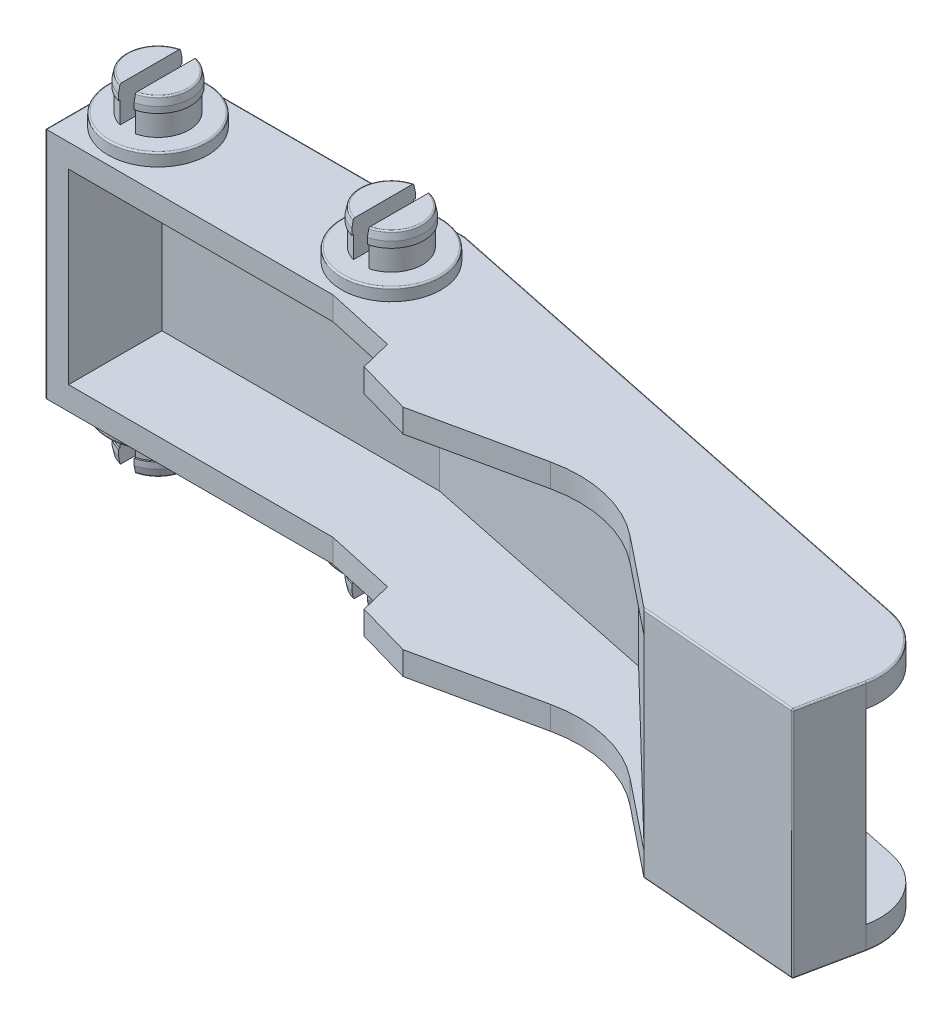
ISO-10303-21;
HEADER;
FILE_DESCRIPTION(('STEP AP214'),'2;1');
FILE_NAME('part.step','',(''),(''),'','','');
FILE_SCHEMA(('AUTOMOTIVE_DESIGN { 1 0 10303 214 1 1 1 1 }'));
ENDSEC;
DATA;
#1=APPLICATION_CONTEXT('core data for automotive mechanical design processes');
#2=APPLICATION_PROTOCOL_DEFINITION('international standard','automotive_design',2000,#1);
#3=PRODUCT_CONTEXT('',#1,'mechanical');
#4=PRODUCT('Part','Part','',(#3));
#5=PRODUCT_RELATED_PRODUCT_CATEGORY('part','',(#4));
#6=PRODUCT_DEFINITION_FORMATION('','',#4);
#7=PRODUCT_DEFINITION_CONTEXT('part definition',#1,'design');
#8=PRODUCT_DEFINITION('design','',#6,#7);
#9=PRODUCT_DEFINITION_SHAPE('','',#8);
#10=(LENGTH_UNIT() NAMED_UNIT(*) SI_UNIT(.MILLI.,.METRE.));
#11=(NAMED_UNIT(*) PLANE_ANGLE_UNIT() SI_UNIT($,.RADIAN.));
#12=(NAMED_UNIT(*) SI_UNIT($,.STERADIAN.) SOLID_ANGLE_UNIT());
#13=UNCERTAINTY_MEASURE_WITH_UNIT(LENGTH_MEASURE(1.E-05),#10,'distance_accuracy_value','');
#14=(GEOMETRIC_REPRESENTATION_CONTEXT(3) GLOBAL_UNCERTAINTY_ASSIGNED_CONTEXT((#13)) GLOBAL_UNIT_ASSIGNED_CONTEXT((#10,
#11,#12)) REPRESENTATION_CONTEXT('',''));
#15=CARTESIAN_POINT('',(0.,0.,0.));
#16=DIRECTION('',(0.,0.,1.));
#17=DIRECTION('',(1.,0.,0.));
#18=AXIS2_PLACEMENT_3D('',#15,#16,#17);
#19=CARTESIAN_POINT('',(46.6557082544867,1.5,9.7978138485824));
#20=DIRECTION('',(-0.0800215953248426,0.,0.996793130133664));
#21=DIRECTION('',(0.996793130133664,0.,0.0800215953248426));
#22=AXIS2_PLACEMENT_3D('',#19,#20,#21);
#23=PLANE('',#22);
#24=DIRECTION('',(0.,-1.,0.));
#25=VECTOR('',#24,1.);
#26=CARTESIAN_POINT('',(55.1730850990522,13.5,10.4815806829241));
#27=LINE('',#26,#25);
#28=CARTESIAN_POINT('',(55.1730850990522,13.5,10.4815806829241));
#29=VERTEX_POINT('',#28);
#30=CARTESIAN_POINT('',(55.1730850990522,1.5,10.4815806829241));
#31=VERTEX_POINT('',#30);
#32=EDGE_CURVE('E64',#29,#31,#27,.T.);
#33=ORIENTED_EDGE('',*,*,#32,.T.);
#34=DIRECTION('',(0.996793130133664,0.,0.0800215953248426));
#35=VECTOR('',#34,1.);
#36=CARTESIAN_POINT('',(46.6557082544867,1.5,9.7978138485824));
#37=LINE('',#36,#35);
#38=CARTESIAN_POINT('',(46.6557082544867,1.5,9.7978138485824));
#39=VERTEX_POINT('',#38);
#40=EDGE_CURVE('E1037',#39,#31,#37,.T.);
#41=ORIENTED_EDGE('',*,*,#40,.F.);
#42=DIRECTION('',(0.,1.,0.));
#43=VECTOR('',#42,1.);
#44=CARTESIAN_POINT('',(46.6557082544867,1.5,9.7978138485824));
#45=LINE('',#44,#43);
#46=CARTESIAN_POINT('',(46.6557082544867,13.5,9.7978138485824));
#47=VERTEX_POINT('',#46);
#48=EDGE_CURVE('E1057',#39,#47,#45,.T.);
#49=ORIENTED_EDGE('',*,*,#48,.T.);
#50=DIRECTION('',(0.996793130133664,0.,0.0800215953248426));
#51=VECTOR('',#50,1.);
#52=CARTESIAN_POINT('',(46.6557082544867,13.5,9.7978138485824));
#53=LINE('',#52,#51);
#54=EDGE_CURVE('E973',#47,#29,#53,.T.);
#55=ORIENTED_EDGE('',*,*,#54,.T.);
#56=EDGE_LOOP('',(#33,#41,#49,#55));
#57=FACE_BOUND('',#56,.T.);
#58=ADVANCED_FACE('F39',(#57),#23,.F.);
#59=CARTESIAN_POINT('',(53.2698698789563,1.5,7.35255846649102));
#60=DIRECTION('',(0.,1.,0.));
#61=DIRECTION('',(0.,0.,1.));
#62=AXIS2_PLACEMENT_3D('',#59,#60,#61);
#63=PLANE('',#62);
#64=DIRECTION('',(-0.203446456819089,0.,0.979086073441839));
#65=VECTOR('',#64,1.);
#66=CARTESIAN_POINT('',(55.1730850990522,1.5,10.4815806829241));
#67=LINE('',#66,#65);
#68=CARTESIAN_POINT('',(55.7175850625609,1.5,7.86117460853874));
#69=VERTEX_POINT('',#68);
#70=EDGE_CURVE('E56',#69,#31,#67,.T.);
#71=ORIENTED_EDGE('',*,*,#70,.F.);
#72=DIRECTION('',(-0.97908607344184,0.,-0.203446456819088));
#73=VECTOR('',#72,1.);
#74=CARTESIAN_POINT('',(57.1862141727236,1.5,8.16634429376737));
#75=LINE('',#74,#73);
#76=CARTESIAN_POINT('',(57.1862141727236,1.5,8.16634429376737));
#77=VERTEX_POINT('',#76);
#78=EDGE_CURVE('E597',#77,#69,#75,.T.);
#79=ORIENTED_EDGE('',*,*,#78,.F.);
#80=CARTESIAN_POINT('',(53.2698698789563,1.5,7.35255846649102));
#81=DIRECTION('',(0.,1.,0.));
#82=DIRECTION('',(0.,0.,1.));
#83=AXIS2_PLACEMENT_3D('',#80,#81,#82);
#84=CIRCLE('',#83,4.);
#85=CARTESIAN_POINT('',(54.0836557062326,1.5,3.43621417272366));
#86=VERTEX_POINT('',#85);
#87=EDGE_CURVE('E1049',#77,#86,#84,.T.);
#88=ORIENTED_EDGE('',*,*,#87,.T.);
#89=DIRECTION('',(-0.97908607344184,0.,-0.203446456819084));
#90=VECTOR('',#89,1.);
#91=CARTESIAN_POINT('',(54.0836557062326,1.5,3.43621417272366));
#92=LINE('',#91,#90);
#93=CARTESIAN_POINT('',(36.2308043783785,1.5,-0.273469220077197));
#94=VERTEX_POINT('',#93);
#95=EDGE_CURVE('E1051',#86,#94,#92,.T.);
#96=ORIENTED_EDGE('',*,*,#95,.T.);
#97=DIRECTION('',(0.719199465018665,0.,0.694803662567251));
#98=VECTOR('',#97,1.);
#99=CARTESIAN_POINT('',(36.2308043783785,1.5,-0.273469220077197));
#100=LINE('',#99,#98);
#101=EDGE_CURVE('E1053',#94,#39,#100,.T.);
#102=ORIENTED_EDGE('',*,*,#101,.T.);
#103=ORIENTED_EDGE('',*,*,#40,.T.);
#104=EDGE_LOOP('',(#71,#79,#88,#96,#102,#103));
#105=FACE_BOUND('',#104,.T.);
#106=ADVANCED_FACE('F759',(#105),#63,.T.);
#107=CARTESIAN_POINT('',(53.2698698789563,13.5,7.35255846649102));
#108=DIRECTION('',(0.,1.,0.));
#109=DIRECTION('',(0.,0.,1.));
#110=AXIS2_PLACEMENT_3D('',#107,#108,#109);
#111=PLANE('',#110);
#112=DIRECTION('',(-0.97908607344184,0.,-0.203446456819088));
#113=VECTOR('',#112,1.);
#114=CARTESIAN_POINT('',(57.1862141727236,13.5,8.16634429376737));
#115=LINE('',#114,#113);
#116=CARTESIAN_POINT('',(57.1862141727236,13.5,8.16634429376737));
#117=VERTEX_POINT('',#116);
#118=CARTESIAN_POINT('',(55.7175850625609,13.5,7.86117460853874));
#119=VERTEX_POINT('',#118);
#120=EDGE_CURVE('E581',#117,#119,#115,.T.);
#121=ORIENTED_EDGE('',*,*,#120,.T.);
#122=DIRECTION('',(-0.203446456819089,0.,0.979086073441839));
#123=VECTOR('',#122,1.);
#124=CARTESIAN_POINT('',(55.1730850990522,13.5,10.4815806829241));
#125=LINE('',#124,#123);
#126=EDGE_CURVE('E586',#119,#29,#125,.T.);
#127=ORIENTED_EDGE('',*,*,#126,.T.);
#128=ORIENTED_EDGE('',*,*,#54,.F.);
#129=DIRECTION('',(0.719199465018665,0.,0.694803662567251));
#130=VECTOR('',#129,1.);
#131=CARTESIAN_POINT('',(36.2308043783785,13.5,-0.273469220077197));
#132=LINE('',#131,#130);
#133=CARTESIAN_POINT('',(36.2308043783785,13.5,-0.273469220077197));
#134=VERTEX_POINT('',#133);
#135=EDGE_CURVE('E979',#134,#47,#132,.T.);
#136=ORIENTED_EDGE('',*,*,#135,.F.);
#137=DIRECTION('',(-0.97908607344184,0.,-0.203446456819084));
#138=VECTOR('',#137,1.);
#139=CARTESIAN_POINT('',(54.0836557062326,13.5,3.43621417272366));
#140=LINE('',#139,#138);
#141=CARTESIAN_POINT('',(54.0836557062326,13.5,3.43621417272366));
#142=VERTEX_POINT('',#141);
#143=EDGE_CURVE('E976',#142,#134,#140,.T.);
#144=ORIENTED_EDGE('',*,*,#143,.F.);
#145=CARTESIAN_POINT('',(53.2698698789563,13.5,7.35255846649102));
#146=DIRECTION('',(0.,1.,0.));
#147=DIRECTION('',(0.,0.,1.));
#148=AXIS2_PLACEMENT_3D('',#145,#146,#147);
#149=CIRCLE('',#148,4.);
#150=EDGE_CURVE('E589',#117,#142,#149,.T.);
#151=ORIENTED_EDGE('',*,*,#150,.F.);
#152=EDGE_LOOP('',(#121,#127,#128,#136,#144,#151));
#153=FACE_BOUND('',#152,.T.);
#154=ADVANCED_FACE('F583',(#153),#111,.F.);
#155=CARTESIAN_POINT('',(3.5,-3.1,0.));
#156=DIRECTION('',(0.,1.,0.));
#157=DIRECTION('',(0.,0.,1.));
#158=AXIS2_PLACEMENT_3D('',#155,#156,#157);
#159=CYLINDRICAL_SURFACE('',#158,2.);
#160=CARTESIAN_POINT('',(3.5,-0.8,0.));
#161=DIRECTION('',(0.,-1.,0.));
#162=DIRECTION('',(0.,0.,-1.));
#163=AXIS2_PLACEMENT_3D('',#160,#161,#162);
#164=CIRCLE('',#163,2.);
#165=CARTESIAN_POINT('',(4.,-0.799999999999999,-1.93649167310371));
#166=VERTEX_POINT('',#165);
#167=CARTESIAN_POINT('',(4.,-0.799999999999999,1.93649167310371));
#168=VERTEX_POINT('',#167);
#169=EDGE_CURVE('E2515',#166,#168,#164,.T.);
#170=ORIENTED_EDGE('',*,*,#169,.T.);
#171=DIRECTION('',(0.,1.,0.));
#172=VECTOR('',#171,1.);
#173=CARTESIAN_POINT('',(4.,-3.1,1.93649167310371));
#174=LINE('',#173,#172);
#175=CARTESIAN_POINT('',(4.,-2.2,1.93649167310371));
#176=VERTEX_POINT('',#175);
#177=EDGE_CURVE('E2568',#168,#176,#174,.F.);
#178=ORIENTED_EDGE('',*,*,#177,.T.);
#179=CARTESIAN_POINT('',(3.5,-2.2,0.));
#180=DIRECTION('',(0.,1.,0.));
#181=DIRECTION('',(-1.,0.,0.));
#182=AXIS2_PLACEMENT_3D('',#179,#180,#181);
#183=CIRCLE('',#182,2.);
#184=CARTESIAN_POINT('',(4.,-2.2,-1.93649167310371));
#185=VERTEX_POINT('',#184);
#186=EDGE_CURVE('E2413',#185,#176,#183,.F.);
#187=ORIENTED_EDGE('',*,*,#186,.F.);
#188=DIRECTION('',(0.,1.,0.));
#189=VECTOR('',#188,1.);
#190=CARTESIAN_POINT('',(4.,-3.1,-1.93649167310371));
#191=LINE('',#190,#189);
#192=EDGE_CURVE('E2558',#185,#166,#191,.T.);
#193=ORIENTED_EDGE('',*,*,#192,.T.);
#194=EDGE_LOOP('',(#170,#178,#187,#193));
#195=FACE_BOUND('',#194,.T.);
#196=ADVANCED_FACE('F1854',(#195),#159,.T.);
#197=CARTESIAN_POINT('',(3.,-0.799999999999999,1.93649167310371));
#198=VERTEX_POINT('',#197);
#199=CARTESIAN_POINT('',(3.,-0.799999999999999,-1.93649167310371));
#200=VERTEX_POINT('',#199);
#201=EDGE_CURVE('E2514',#198,#200,#164,.T.);
#202=ORIENTED_EDGE('',*,*,#201,.T.);
#203=DIRECTION('',(0.,1.,0.));
#204=VECTOR('',#203,1.);
#205=CARTESIAN_POINT('',(3.,-3.1,-1.93649167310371));
#206=LINE('',#205,#204);
#207=CARTESIAN_POINT('',(3.,-2.2,-1.93649167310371));
#208=VERTEX_POINT('',#207);
#209=EDGE_CURVE('E629',#200,#208,#206,.F.);
#210=ORIENTED_EDGE('',*,*,#209,.T.);
#211=CARTESIAN_POINT('',(3.,-2.2,1.93649167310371));
#212=VERTEX_POINT('',#211);
#213=EDGE_CURVE('E2518',#212,#208,#183,.F.);
#214=ORIENTED_EDGE('',*,*,#213,.F.);
#215=DIRECTION('',(0.,1.,0.));
#216=VECTOR('',#215,1.);
#217=CARTESIAN_POINT('',(3.,-3.1,1.93649167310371));
#218=LINE('',#217,#216);
#219=EDGE_CURVE('E2581',#212,#198,#218,.T.);
#220=ORIENTED_EDGE('',*,*,#219,.T.);
#221=EDGE_LOOP('',(#202,#210,#214,#220));
#222=FACE_BOUND('',#221,.T.);
#223=ADVANCED_FACE('F1846',(#222),#159,.T.);
#224=CARTESIAN_POINT('',(3.5,-3.1,0.));
#225=DIRECTION('',(0.,1.,0.));
#226=DIRECTION('',(1.,0.,0.));
#227=AXIS2_PLACEMENT_3D('',#224,#225,#226);
#228=CONICAL_SURFACE('',#227,2.,0.19739555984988);
#229=CARTESIAN_POINT('',(4.,0.397879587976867,2.6528682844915));
#230=CARTESIAN_POINT('',(4.,-0.157397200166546,2.53982014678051));
#231=CARTESIAN_POINT('',(4.,-0.712639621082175,2.42660014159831));
#232=CARTESIAN_POINT('',(4.,-1.82297116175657,2.19942760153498));
#233=CARTESIAN_POINT('',(4.,-2.37806028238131,2.08547507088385));
#234=CARTESIAN_POINT('',(4.,-3.21052203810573,1.91370396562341));
#235=CARTESIAN_POINT('',(4.,-3.487981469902,1.85630637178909));
#236=CARTESIAN_POINT('',(4.,-4.04282124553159,1.74113120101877));
#237=CARTESIAN_POINT('',(4.,-4.32020158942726,1.6833536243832));
#238=CARTESIAN_POINT('',(4.,-4.87485892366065,1.56729533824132));
#239=CARTESIAN_POINT('',(4.,-5.15213591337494,1.50901462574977));
#240=CARTESIAN_POINT('',(4.,-5.70653521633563,1.39171887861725));
#241=CARTESIAN_POINT('',(4.,-5.98365752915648,1.33270384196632));
#242=CARTESIAN_POINT('',(4.,-6.26067690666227,1.27320603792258));
#243=B_SPLINE_CURVE_WITH_KNOTS('',3,(#229,#230,#231,#232,#233,#234,#235,#236,#237,#238,#239,
#240,#241,#242),.UNSPECIFIED.,.F.,.F.,(4,2,2,2,2,2,4),(0.,1.7000038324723,3.39999785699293,
4.24999998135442,5.10000143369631,5.95000793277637,6.80001675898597),.UNSPECIFIED.);
#244=CARTESIAN_POINT('',(4.,-2.6,2.03960780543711));
#245=VERTEX_POINT('',#244);
#246=CARTESIAN_POINT('',(4.,-3.01961161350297,1.95309221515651));
#247=VERTEX_POINT('',#246);
#248=EDGE_CURVE('E2555',#245,#247,#243,.T.);
#249=ORIENTED_EDGE('',*,*,#248,.T.);
#250=CARTESIAN_POINT('',(3.5,-3.01961161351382,0.));
#251=DIRECTION('',(0.,-1.,0.));
#252=DIRECTION('',(0.,0.,-1.));
#253=AXIS2_PLACEMENT_3D('',#250,#251,#252);
#254=CIRCLE('',#253,2.01607767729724);
#255=CARTESIAN_POINT('',(4.,-3.01961161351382,-1.95309221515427));
#256=VERTEX_POINT('',#255);
#257=EDGE_CURVE('E2529',#247,#256,#254,.F.);
#258=ORIENTED_EDGE('',*,*,#257,.T.);
#259=CARTESIAN_POINT('',(4.,-6.26067690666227,-1.27320603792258));
#260=CARTESIAN_POINT('',(4.,-6.07432850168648,-1.31324105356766));
#261=CARTESIAN_POINT('',(4.,-5.88793091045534,-1.35304605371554));
#262=CARTESIAN_POINT('',(4.,-5.51505686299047,-1.43228387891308));
#263=CARTESIAN_POINT('',(4.,-5.32858040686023,-1.47171670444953));
#264=CARTESIAN_POINT('',(4.,-4.76906274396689,-1.58958854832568));
#265=CARTESIAN_POINT('',(4.,-4.39593177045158,-1.66760124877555));
#266=CARTESIAN_POINT('',(4.,-3.84114173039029,-1.78302108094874));
#267=CARTESIAN_POINT('',(4.,-3.65954120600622,-1.82071039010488));
#268=CARTESIAN_POINT('',(4.,-3.29630914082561,-1.89594023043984));
#269=CARTESIAN_POINT('',(4.,-3.11467759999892,-1.93348076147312));
#270=CARTESIAN_POINT('',(4.,-2.37805767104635,-2.08547516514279));
#271=CARTESIAN_POINT('',(4.,-1.82296605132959,-2.19942842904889));
#272=CARTESIAN_POINT('',(4.,-0.712634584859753,-2.42660139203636));
#273=CARTESIAN_POINT('',(4.,-0.157394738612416,-2.53982109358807));
#274=CARTESIAN_POINT('',(4.,0.397879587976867,-2.6528682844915));
#275=B_SPLINE_CURVE_WITH_KNOTS('',3,(#259,#260,#261,#262,#263,#264,#265,#266,#267,#268,#269,
#270,#271,#272,#273,#274),.UNSPECIFIED.,.F.,.F.,(4,2,2,2,2,2,2,4),(0.,0.571800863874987,
1.14360097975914,2.28719669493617,2.84360759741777,3.40001904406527,5.10002083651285,
6.80001690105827),.UNSPECIFIED.);
#276=CARTESIAN_POINT('',(4.,-2.6,-2.03960780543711));
#277=VERTEX_POINT('',#276);
#278=EDGE_CURVE('E2553',#256,#277,#275,.T.);
#279=ORIENTED_EDGE('',*,*,#278,.T.);
#280=CARTESIAN_POINT('',(3.5,-2.6,0.));
#281=DIRECTION('',(0.,1.,0.));
#282=DIRECTION('',(-1.,0.,0.));
#283=AXIS2_PLACEMENT_3D('',#280,#281,#282);
#284=CIRCLE('',#283,2.1);
#285=EDGE_CURVE('E2419',#245,#277,#284,.T.);
#286=ORIENTED_EDGE('',*,*,#285,.F.);
#287=EDGE_LOOP('',(#249,#258,#279,#286));
#288=FACE_BOUND('',#287,.T.);
#289=ADVANCED_FACE('F631',(#288),#228,.T.);
#290=CARTESIAN_POINT('',(3.,0.397879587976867,-2.6528682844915));
#291=CARTESIAN_POINT('',(3.,-0.157397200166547,-2.53982014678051));
#292=CARTESIAN_POINT('',(3.,-0.712639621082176,-2.42660014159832));
#293=CARTESIAN_POINT('',(3.,-1.82297116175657,-2.19942760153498));
#294=CARTESIAN_POINT('',(3.,-2.37806028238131,-2.08547507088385));
#295=CARTESIAN_POINT('',(3.,-3.21052203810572,-1.91370396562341));
#296=CARTESIAN_POINT('',(3.,-3.487981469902,-1.85630637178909));
#297=CARTESIAN_POINT('',(3.,-4.04282124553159,-1.74113120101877));
#298=CARTESIAN_POINT('',(3.,-4.32020158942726,-1.6833536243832));
#299=CARTESIAN_POINT('',(3.,-4.87485892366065,-1.56729533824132));
#300=CARTESIAN_POINT('',(3.,-5.15213591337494,-1.50901462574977));
#301=CARTESIAN_POINT('',(3.,-5.70653521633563,-1.39171887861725));
#302=CARTESIAN_POINT('',(3.,-5.98365752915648,-1.33270384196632));
#303=CARTESIAN_POINT('',(3.,-6.26067690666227,-1.27320603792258));
#304=B_SPLINE_CURVE_WITH_KNOTS('',3,(#290,#291,#292,#293,#294,#295,#296,#297,#298,#299,#300,
#301,#302,#303),.UNSPECIFIED.,.F.,.F.,(4,2,2,2,2,2,4),(0.,1.7000038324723,3.39999785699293,
4.24999998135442,5.10000143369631,5.95000793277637,6.80001675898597),.UNSPECIFIED.);
#305=CARTESIAN_POINT('',(3.,-2.6,-2.03960780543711));
#306=VERTEX_POINT('',#305);
#307=CARTESIAN_POINT('',(3.,-3.01961161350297,-1.95309221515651));
#308=VERTEX_POINT('',#307);
#309=EDGE_CURVE('E620',#306,#308,#304,.T.);
#310=ORIENTED_EDGE('',*,*,#309,.T.);
#311=CARTESIAN_POINT('',(3.5,-3.01961161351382,0.));
#312=DIRECTION('',(0.,-1.,0.));
#313=DIRECTION('',(0.,0.,-1.));
#314=AXIS2_PLACEMENT_3D('',#311,#312,#313);
#315=CIRCLE('',#314,2.01607767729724);
#316=CARTESIAN_POINT('',(3.,-3.01961161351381,1.95309221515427));
#317=VERTEX_POINT('',#316);
#318=EDGE_CURVE('E666',#308,#317,#315,.F.);
#319=ORIENTED_EDGE('',*,*,#318,.T.);
#320=CARTESIAN_POINT('',(3.,-6.26067690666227,1.27320603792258));
#321=CARTESIAN_POINT('',(3.,-6.07432850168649,1.31324105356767));
#322=CARTESIAN_POINT('',(3.,-5.88793091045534,1.35304605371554));
#323=CARTESIAN_POINT('',(3.,-5.51505686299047,1.43228387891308));
#324=CARTESIAN_POINT('',(3.,-5.32858040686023,1.47171670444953));
#325=CARTESIAN_POINT('',(3.,-4.76906274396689,1.58958854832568));
#326=CARTESIAN_POINT('',(3.,-4.39593177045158,1.66760124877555));
#327=CARTESIAN_POINT('',(3.,-3.84114173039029,1.78302108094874));
#328=CARTESIAN_POINT('',(3.,-3.65954120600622,1.82071039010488));
#329=CARTESIAN_POINT('',(3.,-3.29630914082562,1.89594023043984));
#330=CARTESIAN_POINT('',(3.,-3.11467759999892,1.93348076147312));
#331=CARTESIAN_POINT('',(3.,-2.37805767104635,2.08547516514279));
#332=CARTESIAN_POINT('',(3.,-1.82296605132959,2.19942842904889));
#333=CARTESIAN_POINT('',(3.,-0.712634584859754,2.42660139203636));
#334=CARTESIAN_POINT('',(3.,-0.157394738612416,2.53982109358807));
#335=CARTESIAN_POINT('',(3.,0.397879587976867,2.6528682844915));
#336=B_SPLINE_CURVE_WITH_KNOTS('',3,(#320,#321,#322,#323,#324,#325,#326,#327,#328,#329,#330,
#331,#332,#333,#334,#335),.UNSPECIFIED.,.F.,.F.,(4,2,2,2,2,2,2,4),(0.,0.571800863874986,
1.14360097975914,2.28719669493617,2.84360759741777,3.40001904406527,5.10002083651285,
6.80001690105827),.UNSPECIFIED.);
#337=CARTESIAN_POINT('',(3.,-2.6,2.03960780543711));
#338=VERTEX_POINT('',#337);
#339=EDGE_CURVE('E651',#317,#338,#336,.T.);
#340=ORIENTED_EDGE('',*,*,#339,.T.);
#341=EDGE_CURVE('E2417',#306,#338,#284,.T.);
#342=ORIENTED_EDGE('',*,*,#341,.F.);
#343=EDGE_LOOP('',(#310,#319,#340,#342));
#344=FACE_BOUND('',#343,.T.);
#345=ADVANCED_FACE('F1829',(#344),#228,.T.);
#346=CARTESIAN_POINT('',(3.5,-3.1,0.));
#347=DIRECTION('',(0.,-1.,0.));
#348=DIRECTION('',(-1.,0.,0.));
#349=AXIS2_PLACEMENT_3D('',#346,#347,#348);
#350=CYLINDRICAL_SURFACE('',#349,2.1);
#351=ORIENTED_EDGE('',*,*,#285,.T.);
#352=DIRECTION('',(0.,-1.,0.));
#353=VECTOR('',#352,1.);
#354=CARTESIAN_POINT('',(4.,-3.1,-2.03960780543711));
#355=LINE('',#354,#353);
#356=CARTESIAN_POINT('',(4.,-2.2,-2.03960780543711));
#357=VERTEX_POINT('',#356);
#358=EDGE_CURVE('E2557',#277,#357,#355,.F.);
#359=ORIENTED_EDGE('',*,*,#358,.T.);
#360=CARTESIAN_POINT('',(3.5,-2.2,0.));
#361=DIRECTION('',(0.,1.,0.));
#362=DIRECTION('',(-1.,0.,0.));
#363=AXIS2_PLACEMENT_3D('',#360,#361,#362);
#364=CIRCLE('',#363,2.1);
#365=CARTESIAN_POINT('',(4.,-2.2,2.03960780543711));
#366=VERTEX_POINT('',#365);
#367=EDGE_CURVE('E2420',#366,#357,#364,.T.);
#368=ORIENTED_EDGE('',*,*,#367,.F.);
#369=DIRECTION('',(0.,-1.,0.));
#370=VECTOR('',#369,1.);
#371=CARTESIAN_POINT('',(4.,-3.1,2.03960780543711));
#372=LINE('',#371,#370);
#373=EDGE_CURVE('E2576',#366,#245,#372,.T.);
#374=ORIENTED_EDGE('',*,*,#373,.T.);
#375=EDGE_LOOP('',(#351,#359,#368,#374));
#376=FACE_BOUND('',#375,.T.);
#377=ADVANCED_FACE('F1820',(#376),#350,.T.);
#378=ORIENTED_EDGE('',*,*,#341,.T.);
#379=DIRECTION('',(0.,-1.,0.));
#380=VECTOR('',#379,1.);
#381=CARTESIAN_POINT('',(3.,-3.1,2.03960780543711));
#382=LINE('',#381,#380);
#383=CARTESIAN_POINT('',(3.,-2.2,2.03960780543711));
#384=VERTEX_POINT('',#383);
#385=EDGE_CURVE('E2586',#338,#384,#382,.F.);
#386=ORIENTED_EDGE('',*,*,#385,.T.);
#387=CARTESIAN_POINT('',(3.,-2.2,-2.03960780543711));
#388=VERTEX_POINT('',#387);
#389=EDGE_CURVE('E2425',#388,#384,#364,.T.);
#390=ORIENTED_EDGE('',*,*,#389,.F.);
#391=DIRECTION('',(0.,-1.,0.));
#392=VECTOR('',#391,1.);
#393=CARTESIAN_POINT('',(3.,-3.1,-2.03960780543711));
#394=LINE('',#393,#392);
#395=EDGE_CURVE('E616',#388,#306,#394,.T.);
#396=ORIENTED_EDGE('',*,*,#395,.T.);
#397=EDGE_LOOP('',(#378,#386,#390,#396));
#398=FACE_BOUND('',#397,.T.);
#399=ADVANCED_FACE('F1811',(#398),#350,.T.);
#400=CARTESIAN_POINT('',(1.5,-2.2,0.));
#401=DIRECTION('',(0.,1.,0.));
#402=DIRECTION('',(1.,0.,0.));
#403=AXIS2_PLACEMENT_3D('',#400,#401,#402);
#404=PLANE('',#403);
#405=ORIENTED_EDGE('',*,*,#367,.T.);
#406=DIRECTION('',(0.,0.,1.));
#407=VECTOR('',#406,1.);
#408=CARTESIAN_POINT('',(4.,-2.2,0.));
#409=LINE('',#408,#407);
#410=EDGE_CURVE('E2561',#357,#185,#409,.T.);
#411=ORIENTED_EDGE('',*,*,#410,.T.);
#412=ORIENTED_EDGE('',*,*,#186,.T.);
#413=EDGE_CURVE('E2579',#176,#366,#409,.T.);
#414=ORIENTED_EDGE('',*,*,#413,.T.);
#415=EDGE_LOOP('',(#405,#411,#412,#414));
#416=FACE_BOUND('',#415,.T.);
#417=ADVANCED_FACE('F645',(#416),#404,.T.);
#418=ORIENTED_EDGE('',*,*,#389,.T.);
#419=DIRECTION('',(0.,0.,-1.));
#420=VECTOR('',#419,1.);
#421=CARTESIAN_POINT('',(3.,-2.2,0.));
#422=LINE('',#421,#420);
#423=EDGE_CURVE('E617',#384,#212,#422,.T.);
#424=ORIENTED_EDGE('',*,*,#423,.T.);
#425=ORIENTED_EDGE('',*,*,#213,.T.);
#426=EDGE_CURVE('E613',#208,#388,#422,.T.);
#427=ORIENTED_EDGE('',*,*,#426,.T.);
#428=EDGE_LOOP('',(#418,#424,#425,#427));
#429=FACE_BOUND('',#428,.T.);
#430=ADVANCED_FACE('F1794',(#429),#404,.T.);
#431=CARTESIAN_POINT('',(3.5,-3.1,0.));
#432=DIRECTION('',(0.,-1.,0.));
#433=DIRECTION('',(0.,0.,1.));
#434=AXIS2_PLACEMENT_3D('',#431,#432,#433);
#435=PLANE('',#434);
#436=DIRECTION('',(0.,0.,-1.));
#437=VECTOR('',#436,1.);
#438=CARTESIAN_POINT('',(4.,-3.1,0.));
#439=LINE('',#438,#437);
#440=CARTESIAN_POINT('',(4.,-3.1,1.8517017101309));
#441=VERTEX_POINT('',#440);
#442=CARTESIAN_POINT('',(4.,-3.1,-1.8517017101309));
#443=VERTEX_POINT('',#442);
#444=EDGE_CURVE('E2412',#441,#443,#439,.T.);
#445=ORIENTED_EDGE('',*,*,#444,.T.);
#446=CARTESIAN_POINT('',(3.5,-3.1,0.));
#447=DIRECTION('',(0.,-1.,0.));
#448=DIRECTION('',(0.,0.,-1.));
#449=AXIS2_PLACEMENT_3D('',#446,#447,#448);
#450=CIRCLE('',#449,1.91801960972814);
#451=EDGE_CURVE('E2543',#443,#441,#450,.T.);
#452=ORIENTED_EDGE('',*,*,#451,.T.);
#453=EDGE_LOOP('',(#445,#452));
#454=FACE_BOUND('',#453,.T.);
#455=ADVANCED_FACE('F1784',(#454),#435,.T.);
#456=DIRECTION('',(0.,0.,1.));
#457=VECTOR('',#456,1.);
#458=CARTESIAN_POINT('',(3.,-3.1,0.));
#459=LINE('',#458,#457);
#460=CARTESIAN_POINT('',(3.,-3.1,-1.8517017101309));
#461=VERTEX_POINT('',#460);
#462=CARTESIAN_POINT('',(3.,-3.1,1.8517017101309));
#463=VERTEX_POINT('',#462);
#464=EDGE_CURVE('E2407',#461,#463,#459,.T.);
#465=ORIENTED_EDGE('',*,*,#464,.T.);
#466=CARTESIAN_POINT('',(3.5,-3.1,0.));
#467=DIRECTION('',(0.,-1.,0.));
#468=DIRECTION('',(0.,0.,-1.));
#469=AXIS2_PLACEMENT_3D('',#466,#467,#468);
#470=CIRCLE('',#469,1.91801960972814);
#471=EDGE_CURVE('E2402',#463,#461,#470,.T.);
#472=ORIENTED_EDGE('',*,*,#471,.T.);
#473=EDGE_LOOP('',(#465,#472));
#474=FACE_BOUND('',#473,.T.);
#475=ADVANCED_FACE('F1775',(#474),#435,.T.);
#476=CARTESIAN_POINT('',(18.5,-3.1,0.));
#477=DIRECTION('',(0.,1.,0.));
#478=DIRECTION('',(0.,0.,1.));
#479=AXIS2_PLACEMENT_3D('',#476,#477,#478);
#480=CYLINDRICAL_SURFACE('',#479,2.);
#481=CARTESIAN_POINT('',(18.5,-2.2,0.));
#482=DIRECTION('',(0.,-1.,0.));
#483=DIRECTION('',(1.,0.,0.));
#484=AXIS2_PLACEMENT_3D('',#481,#482,#483);
#485=CIRCLE('',#484,2.);
#486=CARTESIAN_POINT('',(19.,-2.2,-1.93649167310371));
#487=VERTEX_POINT('',#486);
#488=CARTESIAN_POINT('',(19.,-2.2,1.93649167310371));
#489=VERTEX_POINT('',#488);
#490=EDGE_CURVE('E2664',#487,#489,#485,.T.);
#491=ORIENTED_EDGE('',*,*,#490,.F.);
#492=DIRECTION('',(0.,1.,0.));
#493=VECTOR('',#492,1.);
#494=CARTESIAN_POINT('',(19.,-3.1,-1.93649167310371));
#495=LINE('',#494,#493);
#496=CARTESIAN_POINT('',(19.,-0.799999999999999,-1.93649167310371));
#497=VERTEX_POINT('',#496);
#498=EDGE_CURVE('E2706',#487,#497,#495,.T.);
#499=ORIENTED_EDGE('',*,*,#498,.T.);
#500=CARTESIAN_POINT('',(18.5,-0.799999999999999,0.));
#501=DIRECTION('',(0.,-1.,0.));
#502=DIRECTION('',(0.,0.,1.));
#503=AXIS2_PLACEMENT_3D('',#500,#501,#502);
#504=CIRCLE('',#503,2.);
#505=CARTESIAN_POINT('',(19.,-0.799999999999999,1.93649167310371));
#506=VERTEX_POINT('',#505);
#507=EDGE_CURVE('E1435',#497,#506,#504,.T.);
#508=ORIENTED_EDGE('',*,*,#507,.T.);
#509=DIRECTION('',(0.,1.,0.));
#510=VECTOR('',#509,1.);
#511=CARTESIAN_POINT('',(19.,-3.1,1.93649167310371));
#512=LINE('',#511,#510);
#513=EDGE_CURVE('E2660',#506,#489,#512,.F.);
#514=ORIENTED_EDGE('',*,*,#513,.T.);
#515=EDGE_LOOP('',(#491,#499,#508,#514));
#516=FACE_BOUND('',#515,.T.);
#517=ADVANCED_FACE('F1702',(#516),#480,.T.);
#518=CARTESIAN_POINT('',(18.5,-3.1,0.));
#519=DIRECTION('',(0.,1.,0.));
#520=DIRECTION('',(-1.,0.,0.));
#521=AXIS2_PLACEMENT_3D('',#518,#519,#520);
#522=CONICAL_SURFACE('',#521,2.,0.19739555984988);
#523=CARTESIAN_POINT('',(19.,-6.26067690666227,1.27320603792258));
#524=CARTESIAN_POINT('',(19.,-6.07432850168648,1.31324105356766));
#525=CARTESIAN_POINT('',(19.,-5.88793091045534,1.35304605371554));
#526=CARTESIAN_POINT('',(19.,-5.51505686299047,1.43228387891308));
#527=CARTESIAN_POINT('',(19.,-5.32858040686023,1.47171670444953));
#528=CARTESIAN_POINT('',(19.,-4.76906274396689,1.58958854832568));
#529=CARTESIAN_POINT('',(19.,-4.39593177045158,1.66760124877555));
#530=CARTESIAN_POINT('',(19.,-3.84114173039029,1.78302108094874));
#531=CARTESIAN_POINT('',(19.,-3.65954120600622,1.82071039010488));
#532=CARTESIAN_POINT('',(19.,-3.29630914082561,1.89594023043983));
#533=CARTESIAN_POINT('',(19.,-3.11467759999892,1.93348076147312));
#534=CARTESIAN_POINT('',(19.,-2.37805767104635,2.08547516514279));
#535=CARTESIAN_POINT('',(19.,-1.82296605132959,2.19942842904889));
#536=CARTESIAN_POINT('',(19.,-0.712634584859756,2.42660139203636));
#537=CARTESIAN_POINT('',(19.,-0.157394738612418,2.53982109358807));
#538=CARTESIAN_POINT('',(19.,0.397879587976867,2.6528682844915));
#539=B_SPLINE_CURVE_WITH_KNOTS('',3,(#523,#524,#525,#526,#527,#528,#529,#530,#531,#532,#533,
#534,#535,#536,#537,#538),.UNSPECIFIED.,.F.,.F.,(4,2,2,2,2,2,2,4),(0.,0.571800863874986,
1.14360097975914,2.28719669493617,2.84360759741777,3.40001904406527,5.10002083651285,
6.80001690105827),.UNSPECIFIED.);
#540=CARTESIAN_POINT('',(19.,-3.01961161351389,1.95309221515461));
#541=VERTEX_POINT('',#540);
#542=CARTESIAN_POINT('',(19.,-2.6,2.03960780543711));
#543=VERTEX_POINT('',#542);
#544=EDGE_CURVE('E2655',#541,#543,#539,.T.);
#545=ORIENTED_EDGE('',*,*,#544,.F.);
#546=CARTESIAN_POINT('',(18.5,-3.01961161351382,0.));
#547=DIRECTION('',(0.,-1.,0.));
#548=DIRECTION('',(0.,0.,-1.));
#549=AXIS2_PLACEMENT_3D('',#546,#547,#548);
#550=CIRCLE('',#549,2.01607767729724);
#551=CARTESIAN_POINT('',(19.,-3.01961161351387,-1.95309221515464));
#552=VERTEX_POINT('',#551);
#553=EDGE_CURVE('E2512',#541,#552,#550,.F.);
#554=ORIENTED_EDGE('',*,*,#553,.T.);
#555=CARTESIAN_POINT('',(19.,0.397879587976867,-2.6528682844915));
#556=CARTESIAN_POINT('',(19.,-0.157397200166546,-2.53982014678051));
#557=CARTESIAN_POINT('',(19.,-0.712639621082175,-2.42660014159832));
#558=CARTESIAN_POINT('',(19.,-1.82297116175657,-2.19942760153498));
#559=CARTESIAN_POINT('',(19.,-2.37806028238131,-2.08547507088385));
#560=CARTESIAN_POINT('',(19.,-3.21052203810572,-1.91370396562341));
#561=CARTESIAN_POINT('',(19.,-3.48798146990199,-1.85630637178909));
#562=CARTESIAN_POINT('',(19.,-4.04282124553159,-1.74113120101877));
#563=CARTESIAN_POINT('',(19.,-4.32020158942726,-1.6833536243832));
#564=CARTESIAN_POINT('',(19.,-4.87485892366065,-1.56729533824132));
#565=CARTESIAN_POINT('',(19.,-5.15213591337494,-1.50901462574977));
#566=CARTESIAN_POINT('',(19.,-5.70653521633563,-1.39171887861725));
#567=CARTESIAN_POINT('',(19.,-5.98365752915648,-1.33270384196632));
#568=CARTESIAN_POINT('',(19.,-6.26067690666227,-1.27320603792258));
#569=B_SPLINE_CURVE_WITH_KNOTS('',3,(#555,#556,#557,#558,#559,#560,#561,#562,#563,#564,#565,
#566,#567,#568),.UNSPECIFIED.,.F.,.F.,(4,2,2,2,2,2,4),(0.,1.7000038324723,3.39999785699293,
4.24999998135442,5.10000143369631,5.95000793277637,6.80001675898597),.UNSPECIFIED.);
#570=CARTESIAN_POINT('',(19.,-2.6,-2.03960780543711));
#571=VERTEX_POINT('',#570);
#572=EDGE_CURVE('E2652',#571,#552,#569,.T.);
#573=ORIENTED_EDGE('',*,*,#572,.F.);
#574=CARTESIAN_POINT('',(18.5,-2.6,0.));
#575=DIRECTION('',(0.,-1.,0.));
#576=DIRECTION('',(1.,0.,0.));
#577=AXIS2_PLACEMENT_3D('',#574,#575,#576);
#578=CIRCLE('',#577,2.1);
#579=EDGE_CURVE('E2659',#571,#543,#578,.T.);
#580=ORIENTED_EDGE('',*,*,#579,.T.);
#581=EDGE_LOOP('',(#545,#554,#573,#580));
#582=FACE_BOUND('',#581,.T.);
#583=ADVANCED_FACE('F1725',(#582),#522,.T.);
#584=CARTESIAN_POINT('',(18.5,-3.1,0.));
#585=DIRECTION('',(0.,-1.,0.));
#586=DIRECTION('',(1.,0.,0.));
#587=AXIS2_PLACEMENT_3D('',#584,#585,#586);
#588=CYLINDRICAL_SURFACE('',#587,2.1);
#589=DIRECTION('',(0.,-1.,0.));
#590=VECTOR('',#589,1.);
#591=CARTESIAN_POINT('',(19.,-3.1,2.03960780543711));
#592=LINE('',#591,#590);
#593=CARTESIAN_POINT('',(19.,-2.2,2.03960780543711));
#594=VERTEX_POINT('',#593);
#595=EDGE_CURVE('E2661',#543,#594,#592,.F.);
#596=ORIENTED_EDGE('',*,*,#595,.F.);
#597=ORIENTED_EDGE('',*,*,#579,.F.);
#598=DIRECTION('',(0.,-1.,0.));
#599=VECTOR('',#598,1.);
#600=CARTESIAN_POINT('',(19.,-3.1,-2.03960780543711));
#601=LINE('',#600,#599);
#602=CARTESIAN_POINT('',(19.,-2.2,-2.03960780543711));
#603=VERTEX_POINT('',#602);
#604=EDGE_CURVE('E2698',#603,#571,#601,.T.);
#605=ORIENTED_EDGE('',*,*,#604,.F.);
#606=CARTESIAN_POINT('',(18.5,-2.2,0.));
#607=DIRECTION('',(0.,-1.,0.));
#608=DIRECTION('',(1.,0.,0.));
#609=AXIS2_PLACEMENT_3D('',#606,#607,#608);
#610=CIRCLE('',#609,2.1);
#611=EDGE_CURVE('E2677',#603,#594,#610,.T.);
#612=ORIENTED_EDGE('',*,*,#611,.T.);
#613=EDGE_LOOP('',(#596,#597,#605,#612));
#614=FACE_BOUND('',#613,.T.);
#615=ADVANCED_FACE('F1734',(#614),#588,.T.);
#616=CARTESIAN_POINT('',(20.5,-2.2,0.));
#617=DIRECTION('',(0.,1.,0.));
#618=DIRECTION('',(-1.,0.,0.));
#619=AXIS2_PLACEMENT_3D('',#616,#617,#618);
#620=PLANE('',#619);
#621=DIRECTION('',(0.,0.,-1.));
#622=VECTOR('',#621,1.);
#623=CARTESIAN_POINT('',(19.,-2.2,0.));
#624=LINE('',#623,#622);
#625=EDGE_CURVE('E2666',#594,#489,#624,.T.);
#626=ORIENTED_EDGE('',*,*,#625,.F.);
#627=ORIENTED_EDGE('',*,*,#611,.F.);
#628=EDGE_CURVE('E2697',#487,#603,#624,.T.);
#629=ORIENTED_EDGE('',*,*,#628,.F.);
#630=ORIENTED_EDGE('',*,*,#490,.T.);
#631=EDGE_LOOP('',(#626,#627,#629,#630));
#632=FACE_BOUND('',#631,.T.);
#633=ADVANCED_FACE('F1742',(#632),#620,.T.);
#634=CARTESIAN_POINT('',(18.5,-3.1,0.));
#635=DIRECTION('',(0.,-1.,0.));
#636=DIRECTION('',(0.,0.,1.));
#637=AXIS2_PLACEMENT_3D('',#634,#635,#636);
#638=PLANE('',#637);
#639=DIRECTION('',(0.,0.,1.));
#640=VECTOR('',#639,1.);
#641=CARTESIAN_POINT('',(19.,-3.1,0.));
#642=LINE('',#641,#640);
#643=CARTESIAN_POINT('',(19.,-3.1,-1.8517017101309));
#644=VERTEX_POINT('',#643);
#645=CARTESIAN_POINT('',(19.,-3.1,1.8517017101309));
#646=VERTEX_POINT('',#645);
#647=EDGE_CURVE('E2626',#644,#646,#642,.T.);
#648=ORIENTED_EDGE('',*,*,#647,.F.);
#649=CARTESIAN_POINT('',(18.5,-3.1,0.));
#650=DIRECTION('',(0.,-1.,0.));
#651=DIRECTION('',(0.,0.,-1.));
#652=AXIS2_PLACEMENT_3D('',#649,#650,#651);
#653=CIRCLE('',#652,1.91801960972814);
#654=EDGE_CURVE('E2644',#644,#646,#653,.T.);
#655=ORIENTED_EDGE('',*,*,#654,.T.);
#656=EDGE_LOOP('',(#648,#655));
#657=FACE_BOUND('',#656,.T.);
#658=ADVANCED_FACE('F1688',(#657),#638,.T.);
#659=CARTESIAN_POINT('',(18.5,-0.8,0.));
#660=DIRECTION('',(0.,-1.,0.));
#661=DIRECTION('',(0.,0.,1.));
#662=AXIS2_PLACEMENT_3D('',#659,#660,#661);
#663=PLANE('',#662);
#664=CARTESIAN_POINT('',(18.5,-0.8,0.));
#665=DIRECTION('',(0.,-1.,0.));
#666=DIRECTION('',(0.,0.,-1.));
#667=AXIS2_PLACEMENT_3D('',#664,#665,#666);
#668=CIRCLE('',#667,3.1);
#669=CARTESIAN_POINT('',(18.5,-0.8,-3.1));
#670=VERTEX_POINT('',#669);
#671=EDGE_CURVE('E2631',#670,#670,#668,.T.);
#672=ORIENTED_EDGE('',*,*,#671,.T.);
#673=EDGE_LOOP('',(#672));
#674=FACE_BOUND('',#673,.T.);
#675=ORIENTED_EDGE('',*,*,#507,.F.);
#676=DIRECTION('',(0.,0.,1.));
#677=VECTOR('',#676,1.);
#678=CARTESIAN_POINT('',(19.,-0.799999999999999,3.));
#679=LINE('',#678,#677);
#680=EDGE_CURVE('E2434',#497,#506,#679,.T.);
#681=ORIENTED_EDGE('',*,*,#680,.T.);
#682=EDGE_LOOP('',(#675,#681));
#683=FACE_BOUND('',#682,.T.);
#684=CARTESIAN_POINT('',(18.,-0.799999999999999,1.93649167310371));
#685=VERTEX_POINT('',#684);
#686=CARTESIAN_POINT('',(18.,-0.799999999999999,-1.93649167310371));
#687=VERTEX_POINT('',#686);
#688=EDGE_CURVE('E1430',#685,#687,#504,.T.);
#689=ORIENTED_EDGE('',*,*,#688,.F.);
#690=DIRECTION('',(0.,0.,-1.));
#691=VECTOR('',#690,1.);
#692=CARTESIAN_POINT('',(18.,-0.799999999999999,3.));
#693=LINE('',#692,#691);
#694=EDGE_CURVE('E2431',#685,#687,#693,.T.);
#695=ORIENTED_EDGE('',*,*,#694,.T.);
#696=EDGE_LOOP('',(#689,#695));
#697=FACE_BOUND('',#696,.T.);
#698=ADVANCED_FACE('F800',(#674,#683,#697),#663,.T.);
#699=CARTESIAN_POINT('',(0.,0.,0.));
#700=DIRECTION('',(0.,1.,0.));
#701=DIRECTION('',(0.,0.,1.));
#702=AXIS2_PLACEMENT_3D('',#699,#700,#701);
#703=PLANE('',#702);
#704=CARTESIAN_POINT('',(3.5,0.,0.));
#705=DIRECTION('',(0.,1.,0.));
#706=DIRECTION('',(0.,0.,1.));
#707=AXIS2_PLACEMENT_3D('',#704,#705,#706);
#708=CIRCLE('',#707,3.2);
#709=CARTESIAN_POINT('',(3.5,0.,3.2));
#710=VERTEX_POINT('',#709);
#711=EDGE_CURVE('E2423',#710,#710,#708,.T.);
#712=ORIENTED_EDGE('',*,*,#711,.T.);
#713=EDGE_LOOP('',(#712));
#714=FACE_BOUND('',#713,.T.);
#715=DIRECTION('',(0.203446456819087,0.,-0.97908607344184));
#716=VECTOR('',#715,1.);
#717=CARTESIAN_POINT('',(56.3480089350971,0.,11.7086771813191));
#718=LINE('',#717,#716);
#719=CARTESIAN_POINT('',(57.0883055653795,0.,8.14599964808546));
#720=VERTEX_POINT('',#719);
#721=CARTESIAN_POINT('',(56.292472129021,0.,11.9759480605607));
#722=VERTEX_POINT('',#721);
#723=EDGE_CURVE('E2383',#720,#722,#718,.F.);
#724=ORIENTED_EDGE('',*,*,#723,.T.);
#725=DIRECTION('',(0.996793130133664,0.,0.0800215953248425));
#726=VECTOR('',#725,1.);
#727=CARTESIAN_POINT('',(-0.59479486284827,0.,7.40909289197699));
#728=LINE('',#727,#726);
#729=CARTESIAN_POINT('',(45.860610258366,0.,11.1384882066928));
#730=VERTEX_POINT('',#729);
#731=EDGE_CURVE('E2379',#722,#730,#728,.F.);
#732=ORIENTED_EDGE('',*,*,#731,.T.);
#733=DIRECTION('',(0.78086880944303,0.,0.624695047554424));
#734=VECTOR('',#733,1.);
#735=CARTESIAN_POINT('',(38.5,0.,5.25));
#736=LINE('',#735,#734);
#737=CARTESIAN_POINT('',(41.4745973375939,0.,7.62967787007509));
#738=VERTEX_POINT('',#737);
#739=EDGE_CURVE('E1104',#738,#730,#736,.T.);
#740=ORIENTED_EDGE('',*,*,#739,.F.);
#741=CARTESIAN_POINT('',(36.4770369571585,0.,13.8766283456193));
#742=DIRECTION('',(0.,1.,0.));
#743=DIRECTION('',(0.,0.,1.));
#744=AXIS2_PLACEMENT_3D('',#741,#742,#743);
#745=CIRCLE('',#744,8.);
#746=CARTESIAN_POINT('',(34.7775998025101,0.,6.05921743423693));
#747=VERTEX_POINT('',#746);
#748=EDGE_CURVE('E1146',#738,#747,#745,.T.);
#749=ORIENTED_EDGE('',*,*,#748,.T.);
#750=DIRECTION('',(0.977176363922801,0.,-0.212429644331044));
#751=VECTOR('',#750,1.);
#752=CARTESIAN_POINT('',(38.5,0.,5.25));
#753=LINE('',#752,#751);
#754=CARTESIAN_POINT('',(27.,0.,7.75));
#755=VERTEX_POINT('',#754);
#756=EDGE_CURVE('E1115',#755,#747,#753,.T.);
#757=ORIENTED_EDGE('',*,*,#756,.F.);
#758=DIRECTION('',(0.961523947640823,0.,0.274721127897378));
#759=VECTOR('',#758,1.);
#760=CARTESIAN_POINT('',(27.,0.,7.75));
#761=LINE('',#760,#759);
#762=CARTESIAN_POINT('',(23.5,0.,6.75));
#763=VERTEX_POINT('',#762);
#764=EDGE_CURVE('E1112',#763,#755,#761,.T.);
#765=ORIENTED_EDGE('',*,*,#764,.F.);
#766=DIRECTION('',(0.242535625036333,0.,0.970142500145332));
#767=VECTOR('',#766,1.);
#768=CARTESIAN_POINT('',(23.,0.,4.75));
#769=LINE('',#768,#767);
#770=CARTESIAN_POINT('',(23.,0.,4.75));
#771=VERTEX_POINT('',#770);
#772=EDGE_CURVE('E1109',#771,#763,#769,.T.);
#773=ORIENTED_EDGE('',*,*,#772,.F.);
#774=DIRECTION('',(0.976187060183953,0.,0.216930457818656));
#775=VECTOR('',#774,1.);
#776=CARTESIAN_POINT('',(18.5,0.,3.75));
#777=LINE('',#776,#775);
#778=CARTESIAN_POINT('',(18.5,0.,3.75));
#779=VERTEX_POINT('',#778);
#780=EDGE_CURVE('E1106',#779,#771,#777,.T.);
#781=ORIENTED_EDGE('',*,*,#780,.F.);
#782=DIRECTION('',(1.,0.,0.));
#783=VECTOR('',#782,1.);
#784=CARTESIAN_POINT('',(0.,0.,3.75));
#785=LINE('',#784,#783);
#786=CARTESIAN_POINT('',(0.1,0.,3.75));
#787=VERTEX_POINT('',#786);
#788=EDGE_CURVE('E1092',#787,#779,#785,.T.);
#789=ORIENTED_EDGE('',*,*,#788,.F.);
#790=DIRECTION('',(0.,0.,1.));
#791=VECTOR('',#790,1.);
#792=CARTESIAN_POINT('',(0.1,0.,0.));
#793=LINE('',#792,#791);
#794=CARTESIAN_POINT('',(0.1,0.,-3.65));
#795=VERTEX_POINT('',#794);
#796=EDGE_CURVE('E2385',#787,#795,#793,.F.);
#797=ORIENTED_EDGE('',*,*,#796,.T.);
#798=DIRECTION('',(-1.,0.,0.));
#799=VECTOR('',#798,1.);
#800=CARTESIAN_POINT('',(0.,0.,-3.65));
#801=LINE('',#800,#799);
#802=CARTESIAN_POINT('',(19.4897201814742,0.,-3.65));
#803=VERTEX_POINT('',#802);
#804=EDGE_CURVE('E2392',#795,#803,#801,.F.);
#805=ORIENTED_EDGE('',*,*,#804,.T.);
#806=DIRECTION('',(-0.97908607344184,0.,-0.203446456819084));
#807=VECTOR('',#806,1.);
#808=CARTESIAN_POINT('',(1.5337378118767,0.,-7.38111321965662));
#809=LINE('',#808,#807);
#810=CARTESIAN_POINT('',(54.0633110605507,0.,3.53412278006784));
#811=VERTEX_POINT('',#810);
#812=EDGE_CURVE('E2390',#803,#811,#809,.F.);
#813=ORIENTED_EDGE('',*,*,#812,.T.);
#814=CARTESIAN_POINT('',(53.2698698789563,0.,7.35255846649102));
#815=DIRECTION('',(0.,1.,0.));
#816=DIRECTION('',(0.,0.,1.));
#817=AXIS2_PLACEMENT_3D('',#814,#815,#816);
#818=CIRCLE('',#817,3.9);
#819=EDGE_CURVE('E2388',#811,#720,#818,.F.);
#820=ORIENTED_EDGE('',*,*,#819,.T.);
#821=EDGE_LOOP('',(#724,#732,#740,#749,#757,#765,#773,#781,#789,#797,#805,#813,#820));
#822=FACE_BOUND('',#821,.T.);
#823=CARTESIAN_POINT('',(18.5,0.,0.));
#824=DIRECTION('',(0.,1.,0.));
#825=DIRECTION('',(0.,0.,1.));
#826=AXIS2_PLACEMENT_3D('',#823,#824,#825);
#827=CIRCLE('',#826,3.2);
#828=CARTESIAN_POINT('',(18.5,0.,3.2));
#829=VERTEX_POINT('',#828);
#830=EDGE_CURVE('E2622',#829,#829,#827,.F.);
#831=ORIENTED_EDGE('',*,*,#830,.F.);
#832=EDGE_LOOP('',(#831));
#833=FACE_BOUND('',#832,.T.);
#834=ADVANCED_FACE('F796',(#714,#822,#833),#703,.F.);
#835=CARTESIAN_POINT('',(18.5,18.1,0.));
#836=DIRECTION('',(0.,-1.,0.));
#837=DIRECTION('',(0.,0.,-1.));
#838=AXIS2_PLACEMENT_3D('',#835,#836,#837);
#839=CYLINDRICAL_SURFACE('',#838,2.);
#840=CARTESIAN_POINT('',(18.5,15.8,0.));
#841=DIRECTION('',(0.,1.,0.));
#842=DIRECTION('',(0.,0.,1.));
#843=AXIS2_PLACEMENT_3D('',#840,#841,#842);
#844=CIRCLE('',#843,2.);
#845=CARTESIAN_POINT('',(18.,15.8,-1.93649167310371));
#846=VERTEX_POINT('',#845);
#847=CARTESIAN_POINT('',(18.,15.8,1.93649167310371));
#848=VERTEX_POINT('',#847);
#849=EDGE_CURVE('E1253',#846,#848,#844,.T.);
#850=ORIENTED_EDGE('',*,*,#849,.T.);
#851=DIRECTION('',(0.,-1.,0.));
#852=VECTOR('',#851,1.);
#853=CARTESIAN_POINT('',(18.,18.1,1.93649167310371));
#854=LINE('',#853,#852);
#855=CARTESIAN_POINT('',(18.,17.2,1.93649167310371));
#856=VERTEX_POINT('',#855);
#857=EDGE_CURVE('E1379',#848,#856,#854,.F.);
#858=ORIENTED_EDGE('',*,*,#857,.T.);
#859=CARTESIAN_POINT('',(18.5,17.2,0.));
#860=DIRECTION('',(0.,-1.,0.));
#861=DIRECTION('',(1.,0.,0.));
#862=AXIS2_PLACEMENT_3D('',#859,#860,#861);
#863=CIRCLE('',#862,2.);
#864=CARTESIAN_POINT('',(18.,17.2,-1.93649167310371));
#865=VERTEX_POINT('',#864);
#866=EDGE_CURVE('E1260',#865,#856,#863,.F.);
#867=ORIENTED_EDGE('',*,*,#866,.F.);
#868=DIRECTION('',(0.,-1.,0.));
#869=VECTOR('',#868,1.);
#870=CARTESIAN_POINT('',(18.,18.1,-1.93649167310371));
#871=LINE('',#870,#869);
#872=EDGE_CURVE('E1392',#865,#846,#871,.T.);
#873=ORIENTED_EDGE('',*,*,#872,.T.);
#874=EDGE_LOOP('',(#850,#858,#867,#873));
#875=FACE_BOUND('',#874,.T.);
#876=ADVANCED_FACE('F799',(#875),#839,.T.);
#877=CARTESIAN_POINT('',(19.,15.8,1.93649167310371));
#878=VERTEX_POINT('',#877);
#879=CARTESIAN_POINT('',(19.,15.8,-1.93649167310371));
#880=VERTEX_POINT('',#879);
#881=EDGE_CURVE('E1254',#878,#880,#844,.T.);
#882=ORIENTED_EDGE('',*,*,#881,.T.);
#883=DIRECTION('',(0.,-1.,0.));
#884=VECTOR('',#883,1.);
#885=CARTESIAN_POINT('',(19.,18.1,-1.93649167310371));
#886=LINE('',#885,#884);
#887=CARTESIAN_POINT('',(19.,17.2,-1.93649167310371));
#888=VERTEX_POINT('',#887);
#889=EDGE_CURVE('E1444',#880,#888,#886,.F.);
#890=ORIENTED_EDGE('',*,*,#889,.T.);
#891=CARTESIAN_POINT('',(19.,17.2,1.93649167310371));
#892=VERTEX_POINT('',#891);
#893=EDGE_CURVE('E1257',#892,#888,#863,.F.);
#894=ORIENTED_EDGE('',*,*,#893,.F.);
#895=DIRECTION('',(0.,-1.,0.));
#896=VECTOR('',#895,1.);
#897=CARTESIAN_POINT('',(19.,18.1,1.93649167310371));
#898=LINE('',#897,#896);
#899=EDGE_CURVE('E1353',#892,#878,#898,.T.);
#900=ORIENTED_EDGE('',*,*,#899,.T.);
#901=EDGE_LOOP('',(#882,#890,#894,#900));
#902=FACE_BOUND('',#901,.T.);
#903=ADVANCED_FACE('F1361',(#902),#839,.T.);
#904=CARTESIAN_POINT('',(18.5,18.1,0.));
#905=DIRECTION('',(0.,-1.,0.));
#906=DIRECTION('',(-1.,0.,0.));
#907=AXIS2_PLACEMENT_3D('',#904,#905,#906);
#908=CONICAL_SURFACE('',#907,2.,0.19739555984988);
#909=CARTESIAN_POINT('',(18.,14.6021204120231,2.6528682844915));
#910=CARTESIAN_POINT('',(18.,15.1573972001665,2.53982014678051));
#911=CARTESIAN_POINT('',(18.,15.7126396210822,2.42660014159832));
#912=CARTESIAN_POINT('',(18.,16.8229711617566,2.19942760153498));
#913=CARTESIAN_POINT('',(18.,17.3780602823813,2.08547507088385));
#914=CARTESIAN_POINT('',(18.,18.2105220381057,1.91370396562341));
#915=CARTESIAN_POINT('',(18.,18.487981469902,1.85630637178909));
#916=CARTESIAN_POINT('',(18.,19.0428212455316,1.74113120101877));
#917=CARTESIAN_POINT('',(18.,19.3202015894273,1.6833536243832));
#918=CARTESIAN_POINT('',(18.,19.8748589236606,1.56729533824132));
#919=CARTESIAN_POINT('',(18.,20.1521359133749,1.50901462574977));
#920=CARTESIAN_POINT('',(18.,20.7065352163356,1.39171887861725));
#921=CARTESIAN_POINT('',(18.,20.9836575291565,1.33270384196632));
#922=CARTESIAN_POINT('',(18.,21.2606769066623,1.27320603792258));
#923=B_SPLINE_CURVE_WITH_KNOTS('',3,(#909,#910,#911,#912,#913,#914,#915,#916,#917,#918,#919,
#920,#921,#922),.UNSPECIFIED.,.F.,.F.,(4,2,2,2,2,2,4),(0.,1.7000038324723,3.39999785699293,
4.24999998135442,5.10000143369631,5.95000793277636,6.80001675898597),.UNSPECIFIED.);
#924=CARTESIAN_POINT('',(18.,17.6,2.03960780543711));
#925=VERTEX_POINT('',#924);
#926=CARTESIAN_POINT('',(18.,18.019611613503,1.95309221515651));
#927=VERTEX_POINT('',#926);
#928=EDGE_CURVE('E1371',#925,#927,#923,.T.);
#929=ORIENTED_EDGE('',*,*,#928,.T.);
#930=CARTESIAN_POINT('',(18.5,18.0196116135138,0.));
#931=DIRECTION('',(0.,1.,0.));
#932=DIRECTION('',(0.,0.,1.));
#933=AXIS2_PLACEMENT_3D('',#930,#931,#932);
#934=CIRCLE('',#933,2.01607767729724);
#935=CARTESIAN_POINT('',(18.,18.0196116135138,-1.95309221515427));
#936=VERTEX_POINT('',#935);
#937=EDGE_CURVE('E1273',#927,#936,#934,.F.);
#938=ORIENTED_EDGE('',*,*,#937,.T.);
#939=CARTESIAN_POINT('',(18.,21.2606769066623,-1.27320603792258));
#940=CARTESIAN_POINT('',(18.,21.0743285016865,-1.31324105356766));
#941=CARTESIAN_POINT('',(18.,20.8879309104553,-1.35304605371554));
#942=CARTESIAN_POINT('',(18.,20.5150568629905,-1.43228387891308));
#943=CARTESIAN_POINT('',(18.,20.3285804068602,-1.47171670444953));
#944=CARTESIAN_POINT('',(18.,19.7690627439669,-1.58958854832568));
#945=CARTESIAN_POINT('',(18.,19.3959317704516,-1.66760124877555));
#946=CARTESIAN_POINT('',(18.,18.8411417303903,-1.78302108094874));
#947=CARTESIAN_POINT('',(18.,18.6595412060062,-1.82071039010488));
#948=CARTESIAN_POINT('',(18.,18.2963091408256,-1.89594023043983));
#949=CARTESIAN_POINT('',(18.,18.1146775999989,-1.93348076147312));
#950=CARTESIAN_POINT('',(18.,17.3780576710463,-2.08547516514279));
#951=CARTESIAN_POINT('',(18.,16.8229660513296,-2.19942842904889));
#952=CARTESIAN_POINT('',(18.,15.7126345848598,-2.42660139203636));
#953=CARTESIAN_POINT('',(18.,15.1573947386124,-2.53982109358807));
#954=CARTESIAN_POINT('',(18.,14.6021204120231,-2.6528682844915));
#955=B_SPLINE_CURVE_WITH_KNOTS('',3,(#939,#940,#941,#942,#943,#944,#945,#946,#947,#948,#949,
#950,#951,#952,#953,#954),.UNSPECIFIED.,.F.,.F.,(4,2,2,2,2,2,2,4),(0.,0.571800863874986,
1.14360097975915,2.28719669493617,2.84360759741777,3.40001904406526,5.10002083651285,
6.80001690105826),.UNSPECIFIED.);
#956=CARTESIAN_POINT('',(18.,17.6,-2.03960780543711));
#957=VERTEX_POINT('',#956);
#958=EDGE_CURVE('E1386',#936,#957,#955,.T.);
#959=ORIENTED_EDGE('',*,*,#958,.T.);
#960=CARTESIAN_POINT('',(18.5,17.6,0.));
#961=DIRECTION('',(0.,-1.,0.));
#962=DIRECTION('',(1.,0.,0.));
#963=AXIS2_PLACEMENT_3D('',#960,#961,#962);
#964=CIRCLE('',#963,2.1);
#965=EDGE_CURVE('E1191',#925,#957,#964,.T.);
#966=ORIENTED_EDGE('',*,*,#965,.F.);
#967=EDGE_LOOP('',(#929,#938,#959,#966));
#968=FACE_BOUND('',#967,.T.);
#969=ADVANCED_FACE('F1356',(#968),#908,.T.);
#970=CARTESIAN_POINT('',(19.,14.6021204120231,-2.6528682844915));
#971=CARTESIAN_POINT('',(19.,15.1573972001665,-2.53982014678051));
#972=CARTESIAN_POINT('',(19.,15.7126396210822,-2.42660014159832));
#973=CARTESIAN_POINT('',(19.,16.8229711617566,-2.19942760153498));
#974=CARTESIAN_POINT('',(19.,17.3780602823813,-2.08547507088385));
#975=CARTESIAN_POINT('',(19.,18.2105220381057,-1.91370396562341));
#976=CARTESIAN_POINT('',(19.,18.487981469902,-1.85630637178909));
#977=CARTESIAN_POINT('',(19.,19.0428212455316,-1.74113120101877));
#978=CARTESIAN_POINT('',(19.,19.3202015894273,-1.6833536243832));
#979=CARTESIAN_POINT('',(19.,19.8748589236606,-1.56729533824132));
#980=CARTESIAN_POINT('',(19.,20.1521359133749,-1.50901462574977));
#981=CARTESIAN_POINT('',(19.,20.7065352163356,-1.39171887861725));
#982=CARTESIAN_POINT('',(19.,20.9836575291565,-1.33270384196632));
#983=CARTESIAN_POINT('',(19.,21.2606769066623,-1.27320603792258));
#984=B_SPLINE_CURVE_WITH_KNOTS('',3,(#970,#971,#972,#973,#974,#975,#976,#977,#978,#979,#980,
#981,#982,#983),.UNSPECIFIED.,.F.,.F.,(4,2,2,2,2,2,4),(0.,1.7000038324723,3.39999785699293,
4.24999998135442,5.10000143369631,5.95000793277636,6.80001675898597),.UNSPECIFIED.);
#985=CARTESIAN_POINT('',(19.,17.6,-2.03960780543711));
#986=VERTEX_POINT('',#985);
#987=CARTESIAN_POINT('',(19.,18.019611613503,-1.95309221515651));
#988=VERTEX_POINT('',#987);
#989=EDGE_CURVE('E1336',#986,#988,#984,.T.);
#990=ORIENTED_EDGE('',*,*,#989,.T.);
#991=CARTESIAN_POINT('',(18.5,18.0196116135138,0.));
#992=DIRECTION('',(0.,1.,0.));
#993=DIRECTION('',(0.,0.,1.));
#994=AXIS2_PLACEMENT_3D('',#991,#992,#993);
#995=CIRCLE('',#994,2.01607767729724);
#996=CARTESIAN_POINT('',(19.,18.0196116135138,1.95309221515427));
#997=VERTEX_POINT('',#996);
#998=EDGE_CURVE('E1456',#988,#997,#995,.F.);
#999=ORIENTED_EDGE('',*,*,#998,.T.);
#1000=CARTESIAN_POINT('',(19.,21.2606769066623,1.27320603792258));
#1001=CARTESIAN_POINT('',(19.,21.0743285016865,1.31324105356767));
#1002=CARTESIAN_POINT('',(19.,20.8879309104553,1.35304605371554));
#1003=CARTESIAN_POINT('',(19.,20.5150568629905,1.43228387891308));
#1004=CARTESIAN_POINT('',(19.,20.3285804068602,1.47171670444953));
#1005=CARTESIAN_POINT('',(19.,19.7690627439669,1.58958854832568));
#1006=CARTESIAN_POINT('',(19.,19.3959317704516,1.66760124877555));
#1007=CARTESIAN_POINT('',(19.,18.8411417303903,1.78302108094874));
#1008=CARTESIAN_POINT('',(19.,18.6595412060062,1.82071039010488));
#1009=CARTESIAN_POINT('',(19.,18.2963091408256,1.89594023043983));
#1010=CARTESIAN_POINT('',(19.,18.1146775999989,1.93348076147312));
#1011=CARTESIAN_POINT('',(19.,17.3780576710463,2.08547516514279));
#1012=CARTESIAN_POINT('',(19.,16.8229660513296,2.19942842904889));
#1013=CARTESIAN_POINT('',(19.,15.7126345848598,2.42660139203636));
#1014=CARTESIAN_POINT('',(19.,15.1573947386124,2.53982109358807));
#1015=CARTESIAN_POINT('',(19.,14.6021204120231,2.6528682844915));
#1016=B_SPLINE_CURVE_WITH_KNOTS('',3,(#1000,#1001,#1002,#1003,#1004,#1005,#1006,#1007,#1008,
#1009,#1010,#1011,#1012,#1013,#1014,#1015),.UNSPECIFIED.,.F.,.F.,(4,2,2,2,2,2,2,4),(0.,
0.571800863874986,1.14360097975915,2.28719669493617,2.84360759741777,3.40001904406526,
5.10002083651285,6.80001690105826),.UNSPECIFIED.);
#1017=CARTESIAN_POINT('',(19.,17.6,2.03960780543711));
#1018=VERTEX_POINT('',#1017);
#1019=EDGE_CURVE('E1346',#997,#1018,#1016,.T.);
#1020=ORIENTED_EDGE('',*,*,#1019,.T.);
#1021=EDGE_CURVE('E1398',#986,#1018,#964,.T.);
#1022=ORIENTED_EDGE('',*,*,#1021,.F.);
#1023=EDGE_LOOP('',(#990,#999,#1020,#1022));
#1024=FACE_BOUND('',#1023,.T.);
#1025=ADVANCED_FACE('F1360',(#1024),#908,.T.);
#1026=CARTESIAN_POINT('',(18.5,18.1,0.));
#1027=DIRECTION('',(0.,1.,0.));
#1028=DIRECTION('',(1.,0.,0.));
#1029=AXIS2_PLACEMENT_3D('',#1026,#1027,#1028);
#1030=CYLINDRICAL_SURFACE('',#1029,2.1);
#1031=ORIENTED_EDGE('',*,*,#965,.T.);
#1032=DIRECTION('',(0.,1.,0.));
#1033=VECTOR('',#1032,1.);
#1034=CARTESIAN_POINT('',(18.,18.1,-2.03960780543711));
#1035=LINE('',#1034,#1033);
#1036=CARTESIAN_POINT('',(18.,17.2,-2.03960780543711));
#1037=VERTEX_POINT('',#1036);
#1038=EDGE_CURVE('E1384',#957,#1037,#1035,.F.);
#1039=ORIENTED_EDGE('',*,*,#1038,.T.);
#1040=CARTESIAN_POINT('',(18.5,17.2,0.));
#1041=DIRECTION('',(0.,-1.,0.));
#1042=DIRECTION('',(1.,0.,0.));
#1043=AXIS2_PLACEMENT_3D('',#1040,#1041,#1042);
#1044=CIRCLE('',#1043,2.1);
#1045=CARTESIAN_POINT('',(18.,17.2,2.03960780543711));
#1046=VERTEX_POINT('',#1045);
#1047=EDGE_CURVE('E1397',#1046,#1037,#1044,.T.);
#1048=ORIENTED_EDGE('',*,*,#1047,.F.);
#1049=DIRECTION('',(0.,1.,0.));
#1050=VECTOR('',#1049,1.);
#1051=CARTESIAN_POINT('',(18.,18.1,2.03960780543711));
#1052=LINE('',#1051,#1050);
#1053=EDGE_CURVE('E1380',#1046,#925,#1052,.T.);
#1054=ORIENTED_EDGE('',*,*,#1053,.T.);
#1055=EDGE_LOOP('',(#1031,#1039,#1048,#1054));
#1056=FACE_BOUND('',#1055,.T.);
#1057=ADVANCED_FACE('F1363',(#1056),#1030,.T.);
#1058=ORIENTED_EDGE('',*,*,#1021,.T.);
#1059=DIRECTION('',(0.,1.,0.));
#1060=VECTOR('',#1059,1.);
#1061=CARTESIAN_POINT('',(19.,18.1,2.03960780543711));
#1062=LINE('',#1061,#1060);
#1063=CARTESIAN_POINT('',(19.,17.2,2.03960780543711));
#1064=VERTEX_POINT('',#1063);
#1065=EDGE_CURVE('E1354',#1018,#1064,#1062,.F.);
#1066=ORIENTED_EDGE('',*,*,#1065,.T.);
#1067=CARTESIAN_POINT('',(19.,17.2,-2.03960780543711));
#1068=VERTEX_POINT('',#1067);
#1069=EDGE_CURVE('E1395',#1068,#1064,#1044,.T.);
#1070=ORIENTED_EDGE('',*,*,#1069,.F.);
#1071=DIRECTION('',(0.,1.,0.));
#1072=VECTOR('',#1071,1.);
#1073=CARTESIAN_POINT('',(19.,18.1,-2.03960780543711));
#1074=LINE('',#1073,#1072);
#1075=EDGE_CURVE('E1440',#1068,#986,#1074,.T.);
#1076=ORIENTED_EDGE('',*,*,#1075,.T.);
#1077=EDGE_LOOP('',(#1058,#1066,#1070,#1076));
#1078=FACE_BOUND('',#1077,.T.);
#1079=ADVANCED_FACE('F1450',(#1078),#1030,.T.);
#1080=CARTESIAN_POINT('',(20.5,17.2,0.));
#1081=DIRECTION('',(0.,-1.,0.));
#1082=DIRECTION('',(-1.,0.,0.));
#1083=AXIS2_PLACEMENT_3D('',#1080,#1081,#1082);
#1084=PLANE('',#1083);
#1085=ORIENTED_EDGE('',*,*,#1047,.T.);
#1086=DIRECTION('',(0.,0.,1.));
#1087=VECTOR('',#1086,1.);
#1088=CARTESIAN_POINT('',(18.,17.2,0.));
#1089=LINE('',#1088,#1087);
#1090=EDGE_CURVE('E1383',#1037,#865,#1089,.T.);
#1091=ORIENTED_EDGE('',*,*,#1090,.T.);
#1092=ORIENTED_EDGE('',*,*,#866,.T.);
#1093=EDGE_CURVE('E1412',#856,#1046,#1089,.T.);
#1094=ORIENTED_EDGE('',*,*,#1093,.T.);
#1095=EDGE_LOOP('',(#1085,#1091,#1092,#1094));
#1096=FACE_BOUND('',#1095,.T.);
#1097=ADVANCED_FACE('F1331',(#1096),#1084,.T.);
#1098=ORIENTED_EDGE('',*,*,#1069,.T.);
#1099=DIRECTION('',(0.,0.,-1.));
#1100=VECTOR('',#1099,1.);
#1101=CARTESIAN_POINT('',(19.,17.2,0.));
#1102=LINE('',#1101,#1100);
#1103=EDGE_CURVE('E1441',#1064,#892,#1102,.T.);
#1104=ORIENTED_EDGE('',*,*,#1103,.T.);
#1105=ORIENTED_EDGE('',*,*,#893,.T.);
#1106=EDGE_CURVE('E1432',#888,#1068,#1102,.T.);
#1107=ORIENTED_EDGE('',*,*,#1106,.T.);
#1108=EDGE_LOOP('',(#1098,#1104,#1105,#1107));
#1109=FACE_BOUND('',#1108,.T.);
#1110=ADVANCED_FACE('F1452',(#1109),#1084,.T.);
#1111=CARTESIAN_POINT('',(18.5,18.1,0.));
#1112=DIRECTION('',(0.,1.,0.));
#1113=DIRECTION('',(0.,0.,1.));
#1114=AXIS2_PLACEMENT_3D('',#1111,#1112,#1113);
#1115=PLANE('',#1114);
#1116=DIRECTION('',(0.,0.,-1.));
#1117=VECTOR('',#1116,1.);
#1118=CARTESIAN_POINT('',(18.,18.1,0.));
#1119=LINE('',#1118,#1117);
#1120=CARTESIAN_POINT('',(18.,18.1,1.8517017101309));
#1121=VERTEX_POINT('',#1120);
#1122=CARTESIAN_POINT('',(18.,18.1,-1.8517017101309));
#1123=VERTEX_POINT('',#1122);
#1124=EDGE_CURVE('E1264',#1121,#1123,#1119,.T.);
#1125=ORIENTED_EDGE('',*,*,#1124,.T.);
#1126=CARTESIAN_POINT('',(18.5,18.1,0.));
#1127=DIRECTION('',(0.,1.,0.));
#1128=DIRECTION('',(0.,0.,1.));
#1129=AXIS2_PLACEMENT_3D('',#1126,#1127,#1128);
#1130=CIRCLE('',#1129,1.91801960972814);
#1131=EDGE_CURVE('E1457',#1123,#1121,#1130,.T.);
#1132=ORIENTED_EDGE('',*,*,#1131,.T.);
#1133=EDGE_LOOP('',(#1125,#1132));
#1134=FACE_BOUND('',#1133,.T.);
#1135=ADVANCED_FACE('F1364',(#1134),#1115,.T.);
#1136=DIRECTION('',(0.,0.,1.));
#1137=VECTOR('',#1136,1.);
#1138=CARTESIAN_POINT('',(19.,18.1,0.));
#1139=LINE('',#1138,#1137);
#1140=CARTESIAN_POINT('',(19.,18.1,-1.8517017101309));
#1141=VERTEX_POINT('',#1140);
#1142=CARTESIAN_POINT('',(19.,18.1,1.8517017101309));
#1143=VERTEX_POINT('',#1142);
#1144=EDGE_CURVE('E1261',#1141,#1143,#1139,.T.);
#1145=ORIENTED_EDGE('',*,*,#1144,.T.);
#1146=CARTESIAN_POINT('',(18.5,18.1,0.));
#1147=DIRECTION('',(0.,1.,0.));
#1148=DIRECTION('',(0.,0.,1.));
#1149=AXIS2_PLACEMENT_3D('',#1146,#1147,#1148);
#1150=CIRCLE('',#1149,1.91801960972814);
#1151=EDGE_CURVE('E1324',#1143,#1141,#1150,.T.);
#1152=ORIENTED_EDGE('',*,*,#1151,.T.);
#1153=EDGE_LOOP('',(#1145,#1152));
#1154=FACE_BOUND('',#1153,.T.);
#1155=ADVANCED_FACE('F1518',(#1154),#1115,.T.);
#1156=CARTESIAN_POINT('',(3.5,18.1,0.));
#1157=DIRECTION('',(0.,-1.,0.));
#1158=DIRECTION('',(0.,0.,-1.));
#1159=AXIS2_PLACEMENT_3D('',#1156,#1157,#1158);
#1160=CYLINDRICAL_SURFACE('',#1159,2.);
#1161=CARTESIAN_POINT('',(3.5,17.2,0.));
#1162=DIRECTION('',(0.,1.,0.));
#1163=DIRECTION('',(-1.,0.,0.));
#1164=AXIS2_PLACEMENT_3D('',#1161,#1162,#1163);
#1165=CIRCLE('',#1164,2.);
#1166=CARTESIAN_POINT('',(3.,17.2,-1.93649167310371));
#1167=VERTEX_POINT('',#1166);
#1168=CARTESIAN_POINT('',(3.,17.2,1.93649167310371));
#1169=VERTEX_POINT('',#1168);
#1170=EDGE_CURVE('E954',#1167,#1169,#1165,.T.);
#1171=ORIENTED_EDGE('',*,*,#1170,.F.);
#1172=DIRECTION('',(0.,-1.,0.));
#1173=VECTOR('',#1172,1.);
#1174=CARTESIAN_POINT('',(3.,18.1,-1.93649167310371));
#1175=LINE('',#1174,#1173);
#1176=CARTESIAN_POINT('',(3.,15.8,-1.93649167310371));
#1177=VERTEX_POINT('',#1176);
#1178=EDGE_CURVE('E939',#1167,#1177,#1175,.T.);
#1179=ORIENTED_EDGE('',*,*,#1178,.T.);
#1180=CARTESIAN_POINT('',(3.5,15.8,0.));
#1181=DIRECTION('',(0.,1.,0.));
#1182=DIRECTION('',(0.,0.,1.));
#1183=AXIS2_PLACEMENT_3D('',#1180,#1181,#1182);
#1184=CIRCLE('',#1183,2.);
#1185=CARTESIAN_POINT('',(3.,15.8,1.93649167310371));
#1186=VERTEX_POINT('',#1185);
#1187=EDGE_CURVE('E970',#1177,#1186,#1184,.T.);
#1188=ORIENTED_EDGE('',*,*,#1187,.T.);
#1189=DIRECTION('',(0.,-1.,0.));
#1190=VECTOR('',#1189,1.);
#1191=CARTESIAN_POINT('',(3.,18.1,1.93649167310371));
#1192=LINE('',#1191,#1190);
#1193=EDGE_CURVE('E951',#1186,#1169,#1192,.F.);
#1194=ORIENTED_EDGE('',*,*,#1193,.T.);
#1195=EDGE_LOOP('',(#1171,#1179,#1188,#1194));
#1196=FACE_BOUND('',#1195,.T.);
#1197=ADVANCED_FACE('F1178',(#1196),#1160,.T.);
#1198=CARTESIAN_POINT('',(3.5,18.1,0.));
#1199=DIRECTION('',(0.,-1.,0.));
#1200=DIRECTION('',(1.,0.,0.));
#1201=AXIS2_PLACEMENT_3D('',#1198,#1199,#1200);
#1202=CONICAL_SURFACE('',#1201,2.,0.19739555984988);
#1203=CARTESIAN_POINT('',(3.,21.2606769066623,1.27320603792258));
#1204=CARTESIAN_POINT('',(3.,21.0743285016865,1.31324105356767));
#1205=CARTESIAN_POINT('',(3.,20.8879309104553,1.35304605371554));
#1206=CARTESIAN_POINT('',(3.,20.5150568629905,1.43228387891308));
#1207=CARTESIAN_POINT('',(3.,20.3285804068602,1.47171670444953));
#1208=CARTESIAN_POINT('',(3.,19.7690627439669,1.58958854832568));
#1209=CARTESIAN_POINT('',(3.,19.3959317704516,1.66760124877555));
#1210=CARTESIAN_POINT('',(3.,18.8411417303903,1.78302108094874));
#1211=CARTESIAN_POINT('',(3.,18.6595412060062,1.82071039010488));
#1212=CARTESIAN_POINT('',(3.,18.2963091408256,1.89594023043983));
#1213=CARTESIAN_POINT('',(3.,18.1146775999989,1.93348076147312));
#1214=CARTESIAN_POINT('',(3.,17.3780576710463,2.08547516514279));
#1215=CARTESIAN_POINT('',(3.,16.8229660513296,2.19942842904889));
#1216=CARTESIAN_POINT('',(3.,15.7126345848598,2.42660139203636));
#1217=CARTESIAN_POINT('',(3.,15.1573947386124,2.53982109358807));
#1218=CARTESIAN_POINT('',(3.,14.6021204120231,2.6528682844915));
#1219=B_SPLINE_CURVE_WITH_KNOTS('',3,(#1203,#1204,#1205,#1206,#1207,#1208,#1209,#1210,#1211,
#1212,#1213,#1214,#1215,#1216,#1217,#1218),.UNSPECIFIED.,.F.,.F.,(4,2,2,2,2,2,2,4),(0.,
0.571800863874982,1.14360097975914,2.28719669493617,2.84360759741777,3.40001904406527,
5.10002083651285,6.80001690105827),.UNSPECIFIED.);
#1220=CARTESIAN_POINT('',(3.,18.0196116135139,1.95309221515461));
#1221=VERTEX_POINT('',#1220);
#1222=CARTESIAN_POINT('',(3.,17.6,2.03960780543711));
#1223=VERTEX_POINT('',#1222);
#1224=EDGE_CURVE('E945',#1221,#1223,#1219,.T.);
#1225=ORIENTED_EDGE('',*,*,#1224,.F.);
#1226=CARTESIAN_POINT('',(3.5,18.0196116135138,0.));
#1227=DIRECTION('',(0.,1.,0.));
#1228=DIRECTION('',(0.,0.,1.));
#1229=AXIS2_PLACEMENT_3D('',#1226,#1227,#1228);
#1230=CIRCLE('',#1229,2.01607767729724);
#1231=CARTESIAN_POINT('',(3.,18.0196116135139,-1.95309221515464));
#1232=VERTEX_POINT('',#1231);
#1233=EDGE_CURVE('E1229',#1221,#1232,#1230,.F.);
#1234=ORIENTED_EDGE('',*,*,#1233,.T.);
#1235=CARTESIAN_POINT('',(3.,14.6021204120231,-2.6528682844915));
#1236=CARTESIAN_POINT('',(3.,15.1573972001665,-2.53982014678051));
#1237=CARTESIAN_POINT('',(3.,15.7126396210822,-2.42660014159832));
#1238=CARTESIAN_POINT('',(3.,16.8229711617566,-2.19942760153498));
#1239=CARTESIAN_POINT('',(3.,17.3780602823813,-2.08547507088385));
#1240=CARTESIAN_POINT('',(3.,18.2105220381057,-1.91370396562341));
#1241=CARTESIAN_POINT('',(3.,18.487981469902,-1.85630637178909));
#1242=CARTESIAN_POINT('',(3.,19.0428212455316,-1.74113120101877));
#1243=CARTESIAN_POINT('',(3.,19.3202015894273,-1.6833536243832));
#1244=CARTESIAN_POINT('',(3.,19.8748589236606,-1.56729533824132));
#1245=CARTESIAN_POINT('',(3.,20.1521359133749,-1.50901462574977));
#1246=CARTESIAN_POINT('',(3.,20.7065352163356,-1.39171887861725));
#1247=CARTESIAN_POINT('',(3.,20.9836575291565,-1.33270384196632));
#1248=CARTESIAN_POINT('',(3.,21.2606769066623,-1.27320603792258));
#1249=B_SPLINE_CURVE_WITH_KNOTS('',3,(#1235,#1236,#1237,#1238,#1239,#1240,#1241,#1242,#1243,
#1244,#1245,#1246,#1247,#1248),.UNSPECIFIED.,.F.,.F.,(4,2,2,2,2,2,4),(0.,1.7000038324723,
3.39999785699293,4.24999998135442,5.10000143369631,5.95000793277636,6.80001675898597),.UNSPECIFIED.);
#1250=CARTESIAN_POINT('',(3.,17.6,-2.03960780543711));
#1251=VERTEX_POINT('',#1250);
#1252=EDGE_CURVE('E931',#1251,#1232,#1249,.T.);
#1253=ORIENTED_EDGE('',*,*,#1252,.F.);
#1254=CARTESIAN_POINT('',(3.5,17.6,0.));
#1255=DIRECTION('',(0.,1.,0.));
#1256=DIRECTION('',(-1.,0.,0.));
#1257=AXIS2_PLACEMENT_3D('',#1254,#1255,#1256);
#1258=CIRCLE('',#1257,2.1);
#1259=EDGE_CURVE('E962',#1251,#1223,#1258,.T.);
#1260=ORIENTED_EDGE('',*,*,#1259,.T.);
#1261=EDGE_LOOP('',(#1225,#1234,#1253,#1260));
#1262=FACE_BOUND('',#1261,.T.);
#1263=ADVANCED_FACE('F923',(#1262),#1202,.T.);
#1264=CARTESIAN_POINT('',(3.5,18.1,0.));
#1265=DIRECTION('',(0.,1.,0.));
#1266=DIRECTION('',(-1.,0.,0.));
#1267=AXIS2_PLACEMENT_3D('',#1264,#1265,#1266);
#1268=CYLINDRICAL_SURFACE('',#1267,2.1);
#1269=DIRECTION('',(0.,1.,0.));
#1270=VECTOR('',#1269,1.);
#1271=CARTESIAN_POINT('',(3.,18.1,2.03960780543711));
#1272=LINE('',#1271,#1270);
#1273=CARTESIAN_POINT('',(3.,17.2,2.03960780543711));
#1274=VERTEX_POINT('',#1273);
#1275=EDGE_CURVE('E944',#1223,#1274,#1272,.F.);
#1276=ORIENTED_EDGE('',*,*,#1275,.F.);
#1277=ORIENTED_EDGE('',*,*,#1259,.F.);
#1278=DIRECTION('',(0.,1.,0.));
#1279=VECTOR('',#1278,1.);
#1280=CARTESIAN_POINT('',(3.,18.1,-2.03960780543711));
#1281=LINE('',#1280,#1279);
#1282=CARTESIAN_POINT('',(3.,17.2,-2.03960780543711));
#1283=VERTEX_POINT('',#1282);
#1284=EDGE_CURVE('E940',#1283,#1251,#1281,.T.);
#1285=ORIENTED_EDGE('',*,*,#1284,.F.);
#1286=CARTESIAN_POINT('',(3.5,17.2,0.));
#1287=DIRECTION('',(0.,1.,0.));
#1288=DIRECTION('',(-1.,0.,0.));
#1289=AXIS2_PLACEMENT_3D('',#1286,#1287,#1288);
#1290=CIRCLE('',#1289,2.1);
#1291=EDGE_CURVE('E958',#1283,#1274,#1290,.T.);
#1292=ORIENTED_EDGE('',*,*,#1291,.T.);
#1293=EDGE_LOOP('',(#1276,#1277,#1285,#1292));
#1294=FACE_BOUND('',#1293,.T.);
#1295=ADVANCED_FACE('F1207',(#1294),#1268,.T.);
#1296=CARTESIAN_POINT('',(1.5,17.2,0.));
#1297=DIRECTION('',(0.,-1.,0.));
#1298=DIRECTION('',(1.,0.,0.));
#1299=AXIS2_PLACEMENT_3D('',#1296,#1297,#1298);
#1300=PLANE('',#1299);
#1301=DIRECTION('',(0.,0.,-1.));
#1302=VECTOR('',#1301,1.);
#1303=CARTESIAN_POINT('',(3.,17.2,0.));
#1304=LINE('',#1303,#1302);
#1305=EDGE_CURVE('E943',#1274,#1169,#1304,.T.);
#1306=ORIENTED_EDGE('',*,*,#1305,.F.);
#1307=ORIENTED_EDGE('',*,*,#1291,.F.);
#1308=EDGE_CURVE('E2218',#1167,#1283,#1304,.T.);
#1309=ORIENTED_EDGE('',*,*,#1308,.F.);
#1310=ORIENTED_EDGE('',*,*,#1170,.T.);
#1311=EDGE_LOOP('',(#1306,#1307,#1309,#1310));
#1312=FACE_BOUND('',#1311,.T.);
#1313=ADVANCED_FACE('F1211',(#1312),#1300,.T.);
#1314=CARTESIAN_POINT('',(3.5,18.1,0.));
#1315=DIRECTION('',(0.,1.,0.));
#1316=DIRECTION('',(0.,0.,1.));
#1317=AXIS2_PLACEMENT_3D('',#1314,#1315,#1316);
#1318=PLANE('',#1317);
#1319=DIRECTION('',(0.,0.,1.));
#1320=VECTOR('',#1319,1.);
#1321=CARTESIAN_POINT('',(3.,18.1,0.));
#1322=LINE('',#1321,#1320);
#1323=CARTESIAN_POINT('',(3.,18.1,-1.8517017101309));
#1324=VERTEX_POINT('',#1323);
#1325=CARTESIAN_POINT('',(3.,18.1,1.8517017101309));
#1326=VERTEX_POINT('',#1325);
#1327=EDGE_CURVE('E1151',#1324,#1326,#1322,.T.);
#1328=ORIENTED_EDGE('',*,*,#1327,.F.);
#1329=CARTESIAN_POINT('',(3.5,18.1,0.));
#1330=DIRECTION('',(0.,1.,0.));
#1331=DIRECTION('',(0.,0.,1.));
#1332=AXIS2_PLACEMENT_3D('',#1329,#1330,#1331);
#1333=CIRCLE('',#1332,1.91801960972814);
#1334=EDGE_CURVE('E1236',#1324,#1326,#1333,.T.);
#1335=ORIENTED_EDGE('',*,*,#1334,.T.);
#1336=EDGE_LOOP('',(#1328,#1335));
#1337=FACE_BOUND('',#1336,.T.);
#1338=ADVANCED_FACE('F1218',(#1337),#1318,.T.);
#1339=CARTESIAN_POINT('',(3.5,15.8,0.));
#1340=DIRECTION('',(0.,1.,0.));
#1341=DIRECTION('',(0.,0.,1.));
#1342=AXIS2_PLACEMENT_3D('',#1339,#1340,#1341);
#1343=PLANE('',#1342);
#1344=CARTESIAN_POINT('',(3.5,15.8,0.));
#1345=DIRECTION('',(0.,1.,0.));
#1346=DIRECTION('',(0.,0.,1.));
#1347=AXIS2_PLACEMENT_3D('',#1344,#1345,#1346);
#1348=CIRCLE('',#1347,3.1);
#1349=CARTESIAN_POINT('',(3.5,15.8,3.1));
#1350=VERTEX_POINT('',#1349);
#1351=EDGE_CURVE('E1154',#1350,#1350,#1348,.T.);
#1352=ORIENTED_EDGE('',*,*,#1351,.T.);
#1353=EDGE_LOOP('',(#1352));
#1354=FACE_BOUND('',#1353,.T.);
#1355=ORIENTED_EDGE('',*,*,#1187,.F.);
#1356=DIRECTION('',(0.,0.,1.));
#1357=VECTOR('',#1356,1.);
#1358=CARTESIAN_POINT('',(3.,15.8,3.));
#1359=LINE('',#1358,#1357);
#1360=EDGE_CURVE('E1182',#1177,#1186,#1359,.T.);
#1361=ORIENTED_EDGE('',*,*,#1360,.T.);
#1362=EDGE_LOOP('',(#1355,#1361));
#1363=FACE_BOUND('',#1362,.T.);
#1364=CARTESIAN_POINT('',(4.,15.8,1.93649167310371));
#1365=VERTEX_POINT('',#1364);
#1366=CARTESIAN_POINT('',(4.,15.8,-1.93649167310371));
#1367=VERTEX_POINT('',#1366);
#1368=EDGE_CURVE('E966',#1365,#1367,#1184,.T.);
#1369=ORIENTED_EDGE('',*,*,#1368,.F.);
#1370=DIRECTION('',(0.,0.,-1.));
#1371=VECTOR('',#1370,1.);
#1372=CARTESIAN_POINT('',(4.,15.8,3.));
#1373=LINE('',#1372,#1371);
#1374=EDGE_CURVE('E1185',#1365,#1367,#1373,.T.);
#1375=ORIENTED_EDGE('',*,*,#1374,.T.);
#1376=EDGE_LOOP('',(#1369,#1375));
#1377=FACE_BOUND('',#1376,.T.);
#1378=ADVANCED_FACE('F794',(#1354,#1363,#1377),#1343,.T.);
#1379=CARTESIAN_POINT('',(0.,15.,0.));
#1380=DIRECTION('',(0.,1.,0.));
#1381=DIRECTION('',(0.,0.,1.));
#1382=AXIS2_PLACEMENT_3D('',#1379,#1380,#1381);
#1383=PLANE('',#1382);
#1384=CARTESIAN_POINT('',(18.5,15.,0.));
#1385=DIRECTION('',(0.,1.,0.));
#1386=DIRECTION('',(0.,0.,1.));
#1387=AXIS2_PLACEMENT_3D('',#1384,#1385,#1386);
#1388=CIRCLE('',#1387,3.2);
#1389=CARTESIAN_POINT('',(18.5,15.,3.2));
#1390=VERTEX_POINT('',#1389);
#1391=EDGE_CURVE('E1250',#1390,#1390,#1388,.T.);
#1392=ORIENTED_EDGE('',*,*,#1391,.F.);
#1393=EDGE_LOOP('',(#1392));
#1394=FACE_BOUND('',#1393,.T.);
#1395=DIRECTION('',(-1.,0.,0.));
#1396=VECTOR('',#1395,1.);
#1397=CARTESIAN_POINT('',(0.,15.,-3.65));
#1398=LINE('',#1397,#1396);
#1399=CARTESIAN_POINT('',(19.4897201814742,15.,-3.65));
#1400=VERTEX_POINT('',#1399);
#1401=CARTESIAN_POINT('',(0.1,15.,-3.65));
#1402=VERTEX_POINT('',#1401);
#1403=EDGE_CURVE('E2377',#1400,#1402,#1398,.T.);
#1404=ORIENTED_EDGE('',*,*,#1403,.T.);
#1405=DIRECTION('',(0.,0.,1.));
#1406=VECTOR('',#1405,1.);
#1407=CARTESIAN_POINT('',(0.1,15.,3.75));
#1408=LINE('',#1407,#1406);
#1409=CARTESIAN_POINT('',(0.1,15.,3.75));
#1410=VERTEX_POINT('',#1409);
#1411=EDGE_CURVE('E2274',#1402,#1410,#1408,.T.);
#1412=ORIENTED_EDGE('',*,*,#1411,.T.);
#1413=DIRECTION('',(1.,0.,0.));
#1414=VECTOR('',#1413,1.);
#1415=CARTESIAN_POINT('',(0.,15.,3.75));
#1416=LINE('',#1415,#1414);
#1417=CARTESIAN_POINT('',(18.5,15.,3.75));
#1418=VERTEX_POINT('',#1417);
#1419=EDGE_CURVE('E1101',#1410,#1418,#1416,.T.);
#1420=ORIENTED_EDGE('',*,*,#1419,.T.);
#1421=DIRECTION('',(0.976187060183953,0.,0.216930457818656));
#1422=VECTOR('',#1421,1.);
#1423=CARTESIAN_POINT('',(18.5,15.,3.75));
#1424=LINE('',#1423,#1422);
#1425=CARTESIAN_POINT('',(23.,15.,4.75));
#1426=VERTEX_POINT('',#1425);
#1427=EDGE_CURVE('E985',#1418,#1426,#1424,.T.);
#1428=ORIENTED_EDGE('',*,*,#1427,.T.);
#1429=DIRECTION('',(0.242535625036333,0.,0.970142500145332));
#1430=VECTOR('',#1429,1.);
#1431=CARTESIAN_POINT('',(23.,15.,4.75));
#1432=LINE('',#1431,#1430);
#1433=CARTESIAN_POINT('',(23.5,15.,6.75));
#1434=VERTEX_POINT('',#1433);
#1435=EDGE_CURVE('E1021',#1426,#1434,#1432,.T.);
#1436=ORIENTED_EDGE('',*,*,#1435,.T.);
#1437=DIRECTION('',(0.961523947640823,0.,0.274721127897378));
#1438=VECTOR('',#1437,1.);
#1439=CARTESIAN_POINT('',(23.5,15.,6.75));
#1440=LINE('',#1439,#1438);
#1441=CARTESIAN_POINT('',(27.,15.,7.75));
#1442=VERTEX_POINT('',#1441);
#1443=EDGE_CURVE('E1024',#1434,#1442,#1440,.T.);
#1444=ORIENTED_EDGE('',*,*,#1443,.T.);
#1445=DIRECTION('',(0.977176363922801,0.,-0.212429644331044));
#1446=VECTOR('',#1445,1.);
#1447=CARTESIAN_POINT('',(27.,15.,7.75));
#1448=LINE('',#1447,#1446);
#1449=CARTESIAN_POINT('',(34.7775998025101,15.,6.05921743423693));
#1450=VERTEX_POINT('',#1449);
#1451=EDGE_CURVE('E1027',#1442,#1450,#1448,.T.);
#1452=ORIENTED_EDGE('',*,*,#1451,.T.);
#1453=CARTESIAN_POINT('',(36.4770369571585,15.,13.8766283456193));
#1454=DIRECTION('',(0.,-1.,0.));
#1455=DIRECTION('',(0.,0.,1.));
#1456=AXIS2_PLACEMENT_3D('',#1453,#1454,#1455);
#1457=CIRCLE('',#1456,8.);
#1458=CARTESIAN_POINT('',(41.4745973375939,15.,7.6296778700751));
#1459=VERTEX_POINT('',#1458);
#1460=EDGE_CURVE('E1030',#1450,#1459,#1457,.T.);
#1461=ORIENTED_EDGE('',*,*,#1460,.T.);
#1462=DIRECTION('',(0.78086880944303,0.,0.624695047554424));
#1463=VECTOR('',#1462,1.);
#1464=CARTESIAN_POINT('',(41.4745973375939,15.,7.62967787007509));
#1465=LINE('',#1464,#1463);
#1466=CARTESIAN_POINT('',(45.860610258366,15.,11.1384882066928));
#1467=VERTEX_POINT('',#1466);
#1468=EDGE_CURVE('E991',#1459,#1467,#1465,.T.);
#1469=ORIENTED_EDGE('',*,*,#1468,.T.);
#1470=DIRECTION('',(0.996793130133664,0.,0.0800215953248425));
#1471=VECTOR('',#1470,1.);
#1472=CARTESIAN_POINT('',(56.3804305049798,15.,11.9830092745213));
#1473=LINE('',#1472,#1471);
#1474=CARTESIAN_POINT('',(56.292472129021,15.,11.9759480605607));
#1475=VERTEX_POINT('',#1474);
#1476=EDGE_CURVE('E2270',#1467,#1475,#1473,.T.);
#1477=ORIENTED_EDGE('',*,*,#1476,.T.);
#1478=DIRECTION('',(0.203446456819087,0.,-0.97908607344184));
#1479=VECTOR('',#1478,1.);
#1480=CARTESIAN_POINT('',(57.0883055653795,15.,8.14599964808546));
#1481=LINE('',#1480,#1479);
#1482=CARTESIAN_POINT('',(57.0883055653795,15.,8.14599964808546));
#1483=VERTEX_POINT('',#1482);
#1484=EDGE_CURVE('E2275',#1475,#1483,#1481,.T.);
#1485=ORIENTED_EDGE('',*,*,#1484,.T.);
#1486=CARTESIAN_POINT('',(53.2698698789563,15.,7.35255846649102));
#1487=DIRECTION('',(0.,1.,0.));
#1488=DIRECTION('',(0.,0.,1.));
#1489=AXIS2_PLACEMENT_3D('',#1486,#1487,#1488);
#1490=CIRCLE('',#1489,3.9);
#1491=CARTESIAN_POINT('',(54.0633110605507,15.,3.53412278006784));
#1492=VERTEX_POINT('',#1491);
#1493=EDGE_CURVE('E2279',#1483,#1492,#1490,.T.);
#1494=ORIENTED_EDGE('',*,*,#1493,.T.);
#1495=DIRECTION('',(-0.97908607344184,0.,-0.203446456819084));
#1496=VECTOR('',#1495,1.);
#1497=CARTESIAN_POINT('',(19.4796553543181,15.,-3.65209139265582));
#1498=LINE('',#1497,#1496);
#1499=EDGE_CURVE('E2372',#1492,#1400,#1498,.T.);
#1500=ORIENTED_EDGE('',*,*,#1499,.T.);
#1501=EDGE_LOOP('',(#1404,#1412,#1420,#1428,#1436,#1444,#1452,#1461,#1469,#1477,#1485,#1494,#1500));
#1502=FACE_BOUND('',#1501,.T.);
#1503=CARTESIAN_POINT('',(3.5,15.,0.));
#1504=DIRECTION('',(0.,1.,0.));
#1505=DIRECTION('',(0.,0.,1.));
#1506=AXIS2_PLACEMENT_3D('',#1503,#1504,#1505);
#1507=CIRCLE('',#1506,3.2);
#1508=CARTESIAN_POINT('',(3.5,15.,3.2));
#1509=VERTEX_POINT('',#1508);
#1510=EDGE_CURVE('E969',#1509,#1509,#1507,.T.);
#1511=ORIENTED_EDGE('',*,*,#1510,.F.);
#1512=EDGE_LOOP('',(#1511));
#1513=FACE_BOUND('',#1512,.T.);
#1514=ADVANCED_FACE('F791',(#1394,#1502,#1513),#1383,.T.);
#1515=CARTESIAN_POINT('',(36.2308043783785,1.5,-0.273469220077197));
#1516=DIRECTION('',(-0.694803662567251,0.,0.719199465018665));
#1517=DIRECTION('',(0.719199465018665,0.,0.694803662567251));
#1518=AXIS2_PLACEMENT_3D('',#1515,#1516,#1517);
#1519=PLANE('',#1518);
#1520=ORIENTED_EDGE('',*,*,#135,.T.);
#1521=ORIENTED_EDGE('',*,*,#48,.F.);
#1522=ORIENTED_EDGE('',*,*,#101,.F.);
#1523=DIRECTION('',(0.,1.,0.));
#1524=VECTOR('',#1523,1.);
#1525=CARTESIAN_POINT('',(36.2308043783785,1.5,-0.273469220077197));
#1526=LINE('',#1525,#1524);
#1527=EDGE_CURVE('E1056',#94,#134,#1526,.T.);
#1528=ORIENTED_EDGE('',*,*,#1527,.T.);
#1529=EDGE_LOOP('',(#1520,#1521,#1522,#1528));
#1530=FACE_BOUND('',#1529,.T.);
#1531=ADVANCED_FACE('F767',(#1530),#1519,.F.);
#1532=CARTESIAN_POINT('',(19.3458027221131,1.5,-2.25));
#1533=DIRECTION('',(0.203446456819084,0.,-0.97908607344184));
#1534=DIRECTION('',(-0.97908607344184,0.,-0.203446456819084));
#1535=AXIS2_PLACEMENT_3D('',#1532,#1533,#1534);
#1536=PLANE('',#1535);
#1537=DIRECTION('',(-0.97908607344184,0.,-0.203446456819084));
#1538=VECTOR('',#1537,1.);
#1539=CARTESIAN_POINT('',(19.3458027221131,13.5,-2.25));
#1540=LINE('',#1539,#1538);
#1541=CARTESIAN_POINT('',(35.5007229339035,13.5,1.10686653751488));
#1542=VERTEX_POINT('',#1541);
#1543=CARTESIAN_POINT('',(19.3458027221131,13.5,-2.25));
#1544=VERTEX_POINT('',#1543);
#1545=EDGE_CURVE('E988',#1542,#1544,#1540,.T.);
#1546=ORIENTED_EDGE('',*,*,#1545,.T.);
#1547=DIRECTION('',(0.,1.,0.));
#1548=VECTOR('',#1547,1.);
#1549=CARTESIAN_POINT('',(19.3458027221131,1.5,-2.25));
#1550=LINE('',#1549,#1548);
#1551=CARTESIAN_POINT('',(19.3458027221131,1.5,-2.25));
#1552=VERTEX_POINT('',#1551);
#1553=EDGE_CURVE('E1088',#1552,#1544,#1550,.T.);
#1554=ORIENTED_EDGE('',*,*,#1553,.F.);
#1555=DIRECTION('',(-0.97908607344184,0.,-0.203446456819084));
#1556=VECTOR('',#1555,1.);
#1557=CARTESIAN_POINT('',(19.3458027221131,1.5,-2.25));
#1558=LINE('',#1557,#1556);
#1559=CARTESIAN_POINT('',(35.5007229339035,1.5,1.10686653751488));
#1560=VERTEX_POINT('',#1559);
#1561=EDGE_CURVE('E1060',#1560,#1552,#1558,.T.);
#1562=ORIENTED_EDGE('',*,*,#1561,.F.);
#1563=DIRECTION('',(0.,1.,0.));
#1564=VECTOR('',#1563,1.);
#1565=CARTESIAN_POINT('',(35.5007229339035,1.5,1.10686653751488));
#1566=LINE('',#1565,#1564);
#1567=EDGE_CURVE('E1089',#1560,#1542,#1566,.T.);
#1568=ORIENTED_EDGE('',*,*,#1567,.T.);
#1569=EDGE_LOOP('',(#1546,#1554,#1562,#1568));
#1570=FACE_BOUND('',#1569,.T.);
#1571=ADVANCED_FACE('F778',(#1570),#1536,.F.);
#1572=CARTESIAN_POINT('',(35.5007229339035,1.5,1.10686653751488));
#1573=DIRECTION('',(0.694803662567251,0.,-0.719199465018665));
#1574=DIRECTION('',(-0.719199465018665,0.,-0.694803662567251));
#1575=AXIS2_PLACEMENT_3D('',#1572,#1573,#1574);
#1576=PLANE('',#1575);
#1577=DIRECTION('',(-0.719199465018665,0.,-0.694803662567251));
#1578=VECTOR('',#1577,1.);
#1579=CARTESIAN_POINT('',(35.5007229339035,13.5,1.10686653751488));
#1580=LINE('',#1579,#1578);
#1581=CARTESIAN_POINT('',(46.,13.5,11.25));
#1582=VERTEX_POINT('',#1581);
#1583=EDGE_CURVE('E1016',#1582,#1542,#1580,.T.);
#1584=ORIENTED_EDGE('',*,*,#1583,.T.);
#1585=ORIENTED_EDGE('',*,*,#1567,.F.);
#1586=DIRECTION('',(-0.719199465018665,0.,-0.694803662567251));
#1587=VECTOR('',#1586,1.);
#1588=CARTESIAN_POINT('',(35.5007229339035,1.5,1.10686653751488));
#1589=LINE('',#1588,#1587);
#1590=CARTESIAN_POINT('',(46.,1.5,11.25));
#1591=VERTEX_POINT('',#1590);
#1592=EDGE_CURVE('E1085',#1591,#1560,#1589,.T.);
#1593=ORIENTED_EDGE('',*,*,#1592,.F.);
#1594=DIRECTION('',(0.,-1.,0.));
#1595=VECTOR('',#1594,1.);
#1596=CARTESIAN_POINT('',(46.,15.,11.25));
#1597=LINE('',#1596,#1595);
#1598=EDGE_CURVE('E1126',#1582,#1591,#1597,.T.);
#1599=ORIENTED_EDGE('',*,*,#1598,.F.);
#1600=EDGE_LOOP('',(#1584,#1585,#1593,#1599));
#1601=FACE_BOUND('',#1600,.T.);
#1602=ADVANCED_FACE('F774',(#1601),#1576,.F.);
#1603=CARTESIAN_POINT('',(1.5,1.5,-2.25));
#1604=DIRECTION('',(-1.,0.,0.));
#1605=DIRECTION('',(0.,0.,1.));
#1606=AXIS2_PLACEMENT_3D('',#1603,#1604,#1605);
#1607=PLANE('',#1606);
#1608=DIRECTION('',(0.,0.,1.));
#1609=VECTOR('',#1608,1.);
#1610=CARTESIAN_POINT('',(1.5,13.5,-2.25));
#1611=LINE('',#1610,#1609);
#1612=CARTESIAN_POINT('',(1.5,13.5,-2.25));
#1613=VERTEX_POINT('',#1612);
#1614=CARTESIAN_POINT('',(1.5,13.5,3.75));
#1615=VERTEX_POINT('',#1614);
#1616=EDGE_CURVE('E993',#1613,#1615,#1611,.T.);
#1617=ORIENTED_EDGE('',*,*,#1616,.T.);
#1618=DIRECTION('',(0.,1.,0.));
#1619=VECTOR('',#1618,1.);
#1620=CARTESIAN_POINT('',(1.5,1.5,3.75));
#1621=LINE('',#1620,#1619);
#1622=CARTESIAN_POINT('',(1.5,1.5,3.75));
#1623=VERTEX_POINT('',#1622);
#1624=EDGE_CURVE('E1093',#1623,#1615,#1621,.T.);
#1625=ORIENTED_EDGE('',*,*,#1624,.F.);
#1626=DIRECTION('',(0.,0.,1.));
#1627=VECTOR('',#1626,1.);
#1628=CARTESIAN_POINT('',(1.5,1.5,-2.25));
#1629=LINE('',#1628,#1627);
#1630=CARTESIAN_POINT('',(1.5,1.5,-2.25));
#1631=VERTEX_POINT('',#1630);
#1632=EDGE_CURVE('E1067',#1631,#1623,#1629,.T.);
#1633=ORIENTED_EDGE('',*,*,#1632,.F.);
#1634=DIRECTION('',(0.,1.,0.));
#1635=VECTOR('',#1634,1.);
#1636=CARTESIAN_POINT('',(1.5,1.5,-2.25));
#1637=LINE('',#1636,#1635);
#1638=EDGE_CURVE('E1096',#1631,#1613,#1637,.T.);
#1639=ORIENTED_EDGE('',*,*,#1638,.T.);
#1640=EDGE_LOOP('',(#1617,#1625,#1633,#1639));
#1641=FACE_BOUND('',#1640,.T.);
#1642=ADVANCED_FACE('F777',(#1641),#1607,.F.);
#1643=CARTESIAN_POINT('',(19.3458027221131,1.5,-2.25));
#1644=DIRECTION('',(0.,0.,-1.));
#1645=DIRECTION('',(-1.,0.,0.));
#1646=AXIS2_PLACEMENT_3D('',#1643,#1644,#1645);
#1647=PLANE('',#1646);
#1648=DIRECTION('',(-1.,0.,0.));
#1649=VECTOR('',#1648,1.);
#1650=CARTESIAN_POINT('',(19.3458027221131,13.5,-2.25));
#1651=LINE('',#1650,#1649);
#1652=EDGE_CURVE('E990',#1544,#1613,#1651,.T.);
#1653=ORIENTED_EDGE('',*,*,#1652,.T.);
#1654=ORIENTED_EDGE('',*,*,#1638,.F.);
#1655=DIRECTION('',(-1.,0.,0.));
#1656=VECTOR('',#1655,1.);
#1657=CARTESIAN_POINT('',(19.3458027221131,1.5,-2.25));
#1658=LINE('',#1657,#1656);
#1659=EDGE_CURVE('E1064',#1552,#1631,#1658,.T.);
#1660=ORIENTED_EDGE('',*,*,#1659,.F.);
#1661=ORIENTED_EDGE('',*,*,#1553,.T.);
#1662=EDGE_LOOP('',(#1653,#1654,#1660,#1661));
#1663=FACE_BOUND('',#1662,.T.);
#1664=ADVANCED_FACE('F782',(#1663),#1647,.F.);
#1665=CARTESIAN_POINT('',(53.2698698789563,15.,7.35255846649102));
#1666=DIRECTION('',(0.,-1.,0.));
#1667=DIRECTION('',(0.,0.,-1.));
#1668=AXIS2_PLACEMENT_3D('',#1665,#1666,#1667);
#1669=CYLINDRICAL_SURFACE('',#1668,4.);
#1670=DIRECTION('',(0.,-1.,0.));
#1671=VECTOR('',#1670,1.);
#1672=CARTESIAN_POINT('',(57.1862141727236,15.,8.16634429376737));
#1673=LINE('',#1672,#1671);
#1674=CARTESIAN_POINT('',(57.1862141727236,0.0999999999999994,8.16634429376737));
#1675=VERTEX_POINT('',#1674);
#1676=EDGE_CURVE('E1138',#1675,#77,#1673,.F.);
#1677=ORIENTED_EDGE('',*,*,#1676,.F.);
#1678=CARTESIAN_POINT('',(53.2698698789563,0.0999999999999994,7.35255846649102));
#1679=DIRECTION('',(0.,1.,0.));
#1680=DIRECTION('',(0.,0.,1.));
#1681=AXIS2_PLACEMENT_3D('',#1678,#1679,#1680);
#1682=CIRCLE('',#1681,4.);
#1683=CARTESIAN_POINT('',(54.0836557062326,0.0999999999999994,3.43621417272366));
#1684=VERTEX_POINT('',#1683);
#1685=EDGE_CURVE('E2293',#1675,#1684,#1682,.T.);
#1686=ORIENTED_EDGE('',*,*,#1685,.T.);
#1687=DIRECTION('',(0.,-1.,0.));
#1688=VECTOR('',#1687,1.);
#1689=CARTESIAN_POINT('',(54.0836557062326,15.,3.43621417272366));
#1690=LINE('',#1689,#1688);
#1691=EDGE_CURVE('E1135',#86,#1684,#1690,.T.);
#1692=ORIENTED_EDGE('',*,*,#1691,.F.);
#1693=ORIENTED_EDGE('',*,*,#87,.F.);
#1694=EDGE_LOOP('',(#1677,#1686,#1692,#1693));
#1695=FACE_BOUND('',#1694,.T.);
#1696=ADVANCED_FACE('F786',(#1695),#1669,.T.);
#1697=CARTESIAN_POINT('',(18.5,15.,3.75));
#1698=DIRECTION('',(0.216930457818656,0.,-0.976187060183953));
#1699=DIRECTION('',(-0.976187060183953,0.,-0.216930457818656));
#1700=AXIS2_PLACEMENT_3D('',#1697,#1698,#1699);
#1701=PLANE('',#1700);
#1702=DIRECTION('',(0.976187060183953,0.,0.216930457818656));
#1703=VECTOR('',#1702,1.);
#1704=CARTESIAN_POINT('',(18.5,1.5,3.75));
#1705=LINE('',#1704,#1703);
#1706=CARTESIAN_POINT('',(18.5,1.5,3.75));
#1707=VERTEX_POINT('',#1706);
#1708=CARTESIAN_POINT('',(23.,1.5,4.75));
#1709=VERTEX_POINT('',#1708);
#1710=EDGE_CURVE('E1072',#1707,#1709,#1705,.T.);
#1711=ORIENTED_EDGE('',*,*,#1710,.F.);
#1712=DIRECTION('',(0.,-1.,0.));
#1713=VECTOR('',#1712,1.);
#1714=CARTESIAN_POINT('',(18.5,15.,3.75));
#1715=LINE('',#1714,#1713);
#1716=EDGE_CURVE('E1132',#1707,#779,#1715,.T.);
#1717=ORIENTED_EDGE('',*,*,#1716,.T.);
#1718=ORIENTED_EDGE('',*,*,#780,.T.);
#1719=DIRECTION('',(0.,-1.,0.));
#1720=VECTOR('',#1719,1.);
#1721=CARTESIAN_POINT('',(23.,15.,4.75));
#1722=LINE('',#1721,#1720);
#1723=EDGE_CURVE('E1130',#1709,#771,#1722,.T.);
#1724=ORIENTED_EDGE('',*,*,#1723,.F.);
#1725=EDGE_LOOP('',(#1711,#1717,#1718,#1724));
#1726=FACE_BOUND('',#1725,.T.);
#1727=ADVANCED_FACE('F838',(#1726),#1701,.F.);
#1728=CARTESIAN_POINT('',(23.,15.,4.75));
#1729=DIRECTION('',(0.970142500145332,0.,-0.242535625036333));
#1730=DIRECTION('',(-0.242535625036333,0.,-0.970142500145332));
#1731=AXIS2_PLACEMENT_3D('',#1728,#1729,#1730);
#1732=PLANE('',#1731);
#1733=DIRECTION('',(0.242535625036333,0.,0.970142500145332));
#1734=VECTOR('',#1733,1.);
#1735=CARTESIAN_POINT('',(23.,1.5,4.75));
#1736=LINE('',#1735,#1734);
#1737=CARTESIAN_POINT('',(23.5,1.5,6.75));
#1738=VERTEX_POINT('',#1737);
#1739=EDGE_CURVE('E1074',#1709,#1738,#1736,.T.);
#1740=ORIENTED_EDGE('',*,*,#1739,.F.);
#1741=ORIENTED_EDGE('',*,*,#1723,.T.);
#1742=ORIENTED_EDGE('',*,*,#772,.T.);
#1743=DIRECTION('',(0.,-1.,0.));
#1744=VECTOR('',#1743,1.);
#1745=CARTESIAN_POINT('',(23.5,15.,6.75));
#1746=LINE('',#1745,#1744);
#1747=EDGE_CURVE('E1128',#1738,#763,#1746,.T.);
#1748=ORIENTED_EDGE('',*,*,#1747,.F.);
#1749=EDGE_LOOP('',(#1740,#1741,#1742,#1748));
#1750=FACE_BOUND('',#1749,.T.);
#1751=ADVANCED_FACE('F834',(#1750),#1732,.F.);
#1752=CARTESIAN_POINT('',(27.,15.,7.75));
#1753=DIRECTION('',(0.274721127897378,0.,-0.961523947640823));
#1754=DIRECTION('',(-0.961523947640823,0.,-0.274721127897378));
#1755=AXIS2_PLACEMENT_3D('',#1752,#1753,#1754);
#1756=PLANE('',#1755);
#1757=DIRECTION('',(0.961523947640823,0.,0.274721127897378));
#1758=VECTOR('',#1757,1.);
#1759=CARTESIAN_POINT('',(23.5,1.5,6.75));
#1760=LINE('',#1759,#1758);
#1761=CARTESIAN_POINT('',(27.,1.5,7.75));
#1762=VERTEX_POINT('',#1761);
#1763=EDGE_CURVE('E1076',#1738,#1762,#1760,.T.);
#1764=ORIENTED_EDGE('',*,*,#1763,.F.);
#1765=ORIENTED_EDGE('',*,*,#1747,.T.);
#1766=ORIENTED_EDGE('',*,*,#764,.T.);
#1767=DIRECTION('',(0.,-1.,0.));
#1768=VECTOR('',#1767,1.);
#1769=CARTESIAN_POINT('',(27.,15.,7.75));
#1770=LINE('',#1769,#1768);
#1771=EDGE_CURVE('E1125',#1762,#755,#1770,.T.);
#1772=ORIENTED_EDGE('',*,*,#1771,.F.);
#1773=EDGE_LOOP('',(#1764,#1765,#1766,#1772));
#1774=FACE_BOUND('',#1773,.T.);
#1775=ADVANCED_FACE('F830',(#1774),#1756,.F.);
#1776=CARTESIAN_POINT('',(38.5,15.,5.25));
#1777=DIRECTION('',(-0.212429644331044,0.,-0.977176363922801));
#1778=DIRECTION('',(-0.977176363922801,0.,0.212429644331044));
#1779=AXIS2_PLACEMENT_3D('',#1776,#1777,#1778);
#1780=PLANE('',#1779);
#1781=DIRECTION('',(0.977176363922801,0.,-0.212429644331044));
#1782=VECTOR('',#1781,1.);
#1783=CARTESIAN_POINT('',(27.,1.5,7.75));
#1784=LINE('',#1783,#1782);
#1785=CARTESIAN_POINT('',(34.7775998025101,1.5,6.05921743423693));
#1786=VERTEX_POINT('',#1785);
#1787=EDGE_CURVE('E1078',#1762,#1786,#1784,.T.);
#1788=ORIENTED_EDGE('',*,*,#1787,.F.);
#1789=ORIENTED_EDGE('',*,*,#1771,.T.);
#1790=ORIENTED_EDGE('',*,*,#756,.T.);
#1791=DIRECTION('',(0.,-1.,0.));
#1792=VECTOR('',#1791,1.);
#1793=CARTESIAN_POINT('',(34.7775998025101,15.,6.05921743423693));
#1794=LINE('',#1793,#1792);
#1795=EDGE_CURVE('E1143',#747,#1786,#1794,.F.);
#1796=ORIENTED_EDGE('',*,*,#1795,.T.);
#1797=EDGE_LOOP('',(#1788,#1789,#1790,#1796));
#1798=FACE_BOUND('',#1797,.T.);
#1799=ADVANCED_FACE('F826',(#1798),#1780,.F.);
#1800=CARTESIAN_POINT('',(38.5,15.,5.25));
#1801=DIRECTION('',(0.624695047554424,0.,-0.78086880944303));
#1802=DIRECTION('',(-0.78086880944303,0.,-0.624695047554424));
#1803=AXIS2_PLACEMENT_3D('',#1800,#1801,#1802);
#1804=PLANE('',#1803);
#1805=ORIENTED_EDGE('',*,*,#739,.T.);
#1806=CARTESIAN_POINT('',(45.860610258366,0.0999999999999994,11.1384882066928));
#1807=DIRECTION('',(0.624695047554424,0.,-0.78086880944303));
#1808=DIRECTION('',(0.78086880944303,0.,0.624695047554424));
#1809=AXIS2_PLACEMENT_3D('',#1806,#1807,#1808);
#1810=ELLIPSE('',#1809,0.178505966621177,0.1);
#1811=CARTESIAN_POINT('',(46.,0.0999999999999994,11.25));
#1812=VERTEX_POINT('',#1811);
#1813=EDGE_CURVE('E2290',#730,#1812,#1810,.F.);
#1814=ORIENTED_EDGE('',*,*,#1813,.T.);
#1815=EDGE_CURVE('E1122',#1591,#1812,#1597,.T.);
#1816=ORIENTED_EDGE('',*,*,#1815,.F.);
#1817=DIRECTION('',(0.78086880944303,0.,0.624695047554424));
#1818=VECTOR('',#1817,1.);
#1819=CARTESIAN_POINT('',(41.4745973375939,1.5,7.62967787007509));
#1820=LINE('',#1819,#1818);
#1821=CARTESIAN_POINT('',(41.4745973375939,1.5,7.6296778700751));
#1822=VERTEX_POINT('',#1821);
#1823=EDGE_CURVE('E1082',#1822,#1591,#1820,.T.);
#1824=ORIENTED_EDGE('',*,*,#1823,.F.);
#1825=DIRECTION('',(0.,-1.,0.));
#1826=VECTOR('',#1825,1.);
#1827=CARTESIAN_POINT('',(41.4745973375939,0.,7.62967787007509));
#1828=LINE('',#1827,#1826);
#1829=EDGE_CURVE('E1141',#1822,#738,#1828,.T.);
#1830=ORIENTED_EDGE('',*,*,#1829,.T.);
#1831=EDGE_LOOP('',(#1805,#1814,#1816,#1824,#1830));
#1832=FACE_BOUND('',#1831,.T.);
#1833=ADVANCED_FACE('F822',(#1832),#1804,.F.);
#1834=CARTESIAN_POINT('',(36.4770369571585,15.,13.8766283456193));
#1835=DIRECTION('',(0.,1.,0.));
#1836=DIRECTION('',(0.,0.,1.));
#1837=AXIS2_PLACEMENT_3D('',#1834,#1835,#1836);
#1838=CYLINDRICAL_SURFACE('',#1837,8.);
#1839=CARTESIAN_POINT('',(36.4770369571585,1.5,13.8766283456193));
#1840=DIRECTION('',(0.,-1.,0.));
#1841=DIRECTION('',(0.,0.,1.));
#1842=AXIS2_PLACEMENT_3D('',#1839,#1840,#1841);
#1843=CIRCLE('',#1842,8.);
#1844=EDGE_CURVE('E1080',#1786,#1822,#1843,.T.);
#1845=ORIENTED_EDGE('',*,*,#1844,.F.);
#1846=ORIENTED_EDGE('',*,*,#1795,.F.);
#1847=ORIENTED_EDGE('',*,*,#748,.F.);
#1848=ORIENTED_EDGE('',*,*,#1829,.F.);
#1849=EDGE_LOOP('',(#1845,#1846,#1847,#1848));
#1850=FACE_BOUND('',#1849,.T.);
#1851=ADVANCED_FACE('F825',(#1850),#1838,.F.);
#1852=CARTESIAN_POINT('',(0.,15.,3.75));
#1853=DIRECTION('',(0.,0.,-1.));
#1854=DIRECTION('',(-1.,0.,0.));
#1855=AXIS2_PLACEMENT_3D('',#1852,#1853,#1854);
#1856=PLANE('',#1855);
#1857=ORIENTED_EDGE('',*,*,#1419,.F.);
#1858=DIRECTION('',(0.,-1.,0.));
#1859=VECTOR('',#1858,1.);
#1860=CARTESIAN_POINT('',(0.1,15.,3.75));
#1861=LINE('',#1860,#1859);
#1862=EDGE_CURVE('E2277',#1410,#787,#1861,.T.);
#1863=ORIENTED_EDGE('',*,*,#1862,.T.);
#1864=ORIENTED_EDGE('',*,*,#788,.T.);
#1865=ORIENTED_EDGE('',*,*,#1716,.F.);
#1866=DIRECTION('',(1.,0.,0.));
#1867=VECTOR('',#1866,1.);
#1868=CARTESIAN_POINT('',(1.5,1.5,3.75));
#1869=LINE('',#1868,#1867);
#1870=EDGE_CURVE('E1070',#1623,#1707,#1869,.T.);
#1871=ORIENTED_EDGE('',*,*,#1870,.F.);
#1872=ORIENTED_EDGE('',*,*,#1624,.T.);
#1873=DIRECTION('',(1.,0.,0.));
#1874=VECTOR('',#1873,1.);
#1875=CARTESIAN_POINT('',(1.5,13.5,3.75));
#1876=LINE('',#1875,#1874);
#1877=CARTESIAN_POINT('',(18.5,13.5,3.75));
#1878=VERTEX_POINT('',#1877);
#1879=EDGE_CURVE('E995',#1615,#1878,#1876,.T.);
#1880=ORIENTED_EDGE('',*,*,#1879,.T.);
#1881=DIRECTION('',(0.,1.,0.));
#1882=VECTOR('',#1881,1.);
#1883=CARTESIAN_POINT('',(18.5,13.5,3.75));
#1884=LINE('',#1883,#1882);
#1885=EDGE_CURVE('E1018',#1878,#1418,#1884,.T.);
#1886=ORIENTED_EDGE('',*,*,#1885,.T.);
#1887=EDGE_LOOP('',(#1857,#1863,#1864,#1865,#1871,#1872,#1880,#1886));
#1888=FACE_BOUND('',#1887,.T.);
#1889=ADVANCED_FACE('F820',(#1888),#1856,.F.);
#1890=CARTESIAN_POINT('',(46.,15.,11.25));
#1891=DIRECTION('',(0.0800215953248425,0.,-0.996793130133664));
#1892=DIRECTION('',(-0.996793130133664,0.,-0.0800215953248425));
#1893=AXIS2_PLACEMENT_3D('',#1890,#1891,#1892);
#1894=PLANE('',#1893);
#1895=ORIENTED_EDGE('',*,*,#1815,.T.);
#1896=DIRECTION('',(0.996793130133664,0.,0.0800215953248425));
#1897=VECTOR('',#1896,1.);
#1898=CARTESIAN_POINT('',(46.,0.0999999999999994,11.25));
#1899=LINE('',#1898,#1897);
#1900=CARTESIAN_POINT('',(56.2844699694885,0.0999999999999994,12.075627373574));
#1901=VERTEX_POINT('',#1900);
#1902=EDGE_CURVE('E2288',#1812,#1901,#1899,.T.);
#1903=ORIENTED_EDGE('',*,*,#1902,.T.);
#1904=DIRECTION('',(0.,-1.,0.));
#1905=VECTOR('',#1904,1.);
#1906=CARTESIAN_POINT('',(56.2844699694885,15.,12.075627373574));
#1907=LINE('',#1906,#1905);
#1908=CARTESIAN_POINT('',(56.2844699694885,14.9,12.075627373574));
#1909=VERTEX_POINT('',#1908);
#1910=EDGE_CURVE('E2284',#1901,#1909,#1907,.F.);
#1911=ORIENTED_EDGE('',*,*,#1910,.T.);
#1912=DIRECTION('',(0.996793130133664,0.,0.0800215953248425));
#1913=VECTOR('',#1912,1.);
#1914=CARTESIAN_POINT('',(46.,14.9,11.25));
#1915=LINE('',#1914,#1913);
#1916=CARTESIAN_POINT('',(46.,14.9,11.25));
#1917=VERTEX_POINT('',#1916);
#1918=EDGE_CURVE('E2286',#1909,#1917,#1915,.F.);
#1919=ORIENTED_EDGE('',*,*,#1918,.T.);
#1920=EDGE_CURVE('E1123',#1917,#1582,#1597,.T.);
#1921=ORIENTED_EDGE('',*,*,#1920,.T.);
#1922=ORIENTED_EDGE('',*,*,#1598,.T.);
#1923=EDGE_LOOP('',(#1895,#1903,#1911,#1919,#1921,#1922));
#1924=FACE_BOUND('',#1923,.T.);
#1925=ADVANCED_FACE('F816',(#1924),#1894,.F.);
#1926=CARTESIAN_POINT('',(58.,15.,4.25));
#1927=DIRECTION('',(-0.97908607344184,0.,-0.203446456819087));
#1928=DIRECTION('',(-0.203446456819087,0.,0.97908607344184));
#1929=AXIS2_PLACEMENT_3D('',#1926,#1927,#1928);
#1930=PLANE('',#1929);
#1931=ORIENTED_EDGE('',*,*,#1676,.T.);
#1932=DIRECTION('',(0.,-1.,0.));
#1933=VECTOR('',#1932,1.);
#1934=CARTESIAN_POINT('',(57.1862141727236,13.5,8.16634429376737));
#1935=LINE('',#1934,#1933);
#1936=EDGE_CURVE('E599',#117,#77,#1935,.T.);
#1937=ORIENTED_EDGE('',*,*,#1936,.F.);
#1938=DIRECTION('',(0.,1.,0.));
#1939=VECTOR('',#1938,1.);
#1940=CARTESIAN_POINT('',(57.1862141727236,13.5,8.16634429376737));
#1941=LINE('',#1940,#1939);
#1942=CARTESIAN_POINT('',(57.1862141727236,14.9,8.16634429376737));
#1943=VERTEX_POINT('',#1942);
#1944=EDGE_CURVE('E981',#117,#1943,#1941,.T.);
#1945=ORIENTED_EDGE('',*,*,#1944,.T.);
#1946=DIRECTION('',(0.203446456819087,0.,-0.97908607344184));
#1947=VECTOR('',#1946,1.);
#1948=CARTESIAN_POINT('',(56.3724283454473,14.9,12.0826885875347));
#1949=LINE('',#1948,#1947);
#1950=CARTESIAN_POINT('',(56.3903807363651,14.9,11.9962927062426));
#1951=VERTEX_POINT('',#1950);
#1952=EDGE_CURVE('E2296',#1943,#1951,#1949,.F.);
#1953=ORIENTED_EDGE('',*,*,#1952,.T.);
#1954=DIRECTION('',(0.,-1.,0.));
#1955=VECTOR('',#1954,1.);
#1956=CARTESIAN_POINT('',(56.3903807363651,15.,11.9962927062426));
#1957=LINE('',#1956,#1955);
#1958=CARTESIAN_POINT('',(56.3903807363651,0.0999999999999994,11.9962927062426));
#1959=VERTEX_POINT('',#1958);
#1960=EDGE_CURVE('E2298',#1951,#1959,#1957,.T.);
#1961=ORIENTED_EDGE('',*,*,#1960,.T.);
#1962=DIRECTION('',(0.203446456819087,0.,-0.97908607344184));
#1963=VECTOR('',#1962,1.);
#1964=CARTESIAN_POINT('',(58.,0.0999999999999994,4.25));
#1965=LINE('',#1964,#1963);
#1966=EDGE_CURVE('E2300',#1959,#1675,#1965,.T.);
#1967=ORIENTED_EDGE('',*,*,#1966,.T.);
#1968=EDGE_LOOP('',(#1931,#1937,#1945,#1953,#1961,#1967));
#1969=FACE_BOUND('',#1968,.T.);
#1970=ADVANCED_FACE('F812',(#1969),#1930,.F.);
#1971=CARTESIAN_POINT('',(19.5,15.,-3.75));
#1972=DIRECTION('',(-0.203446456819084,0.,0.97908607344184));
#1973=DIRECTION('',(0.97908607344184,0.,0.203446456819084));
#1974=AXIS2_PLACEMENT_3D('',#1971,#1972,#1973);
#1975=PLANE('',#1974);
#1976=ORIENTED_EDGE('',*,*,#1691,.T.);
#1977=DIRECTION('',(-0.97908607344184,0.,-0.203446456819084));
#1978=VECTOR('',#1977,1.);
#1979=CARTESIAN_POINT('',(19.5,0.0999999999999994,-3.75));
#1980=LINE('',#1979,#1978);
#1981=CARTESIAN_POINT('',(19.5,0.0999999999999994,-3.75));
#1982=VERTEX_POINT('',#1981);
#1983=EDGE_CURVE('E2306',#1684,#1982,#1980,.T.);
#1984=ORIENTED_EDGE('',*,*,#1983,.T.);
#1985=DIRECTION('',(0.,-1.,0.));
#1986=VECTOR('',#1985,1.);
#1987=CARTESIAN_POINT('',(19.5,15.,-3.75));
#1988=LINE('',#1987,#1986);
#1989=CARTESIAN_POINT('',(19.5,14.9,-3.75));
#1990=VERTEX_POINT('',#1989);
#1991=EDGE_CURVE('E1103',#1990,#1982,#1988,.T.);
#1992=ORIENTED_EDGE('',*,*,#1991,.F.);
#1993=DIRECTION('',(-0.97908607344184,0.,-0.203446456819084));
#1994=VECTOR('',#1993,1.);
#1995=CARTESIAN_POINT('',(54.0836557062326,14.9,3.43621417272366));
#1996=LINE('',#1995,#1994);
#1997=CARTESIAN_POINT('',(54.0836557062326,14.9,3.43621417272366));
#1998=VERTEX_POINT('',#1997);
#1999=EDGE_CURVE('E2304',#1990,#1998,#1996,.F.);
#2000=ORIENTED_EDGE('',*,*,#1999,.T.);
#2001=DIRECTION('',(0.,1.,0.));
#2002=VECTOR('',#2001,1.);
#2003=CARTESIAN_POINT('',(54.0836557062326,13.5,3.43621417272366));
#2004=LINE('',#2003,#2002);
#2005=EDGE_CURVE('E982',#142,#1998,#2004,.T.);
#2006=ORIENTED_EDGE('',*,*,#2005,.F.);
#2007=ORIENTED_EDGE('',*,*,#143,.T.);
#2008=ORIENTED_EDGE('',*,*,#1527,.F.);
#2009=ORIENTED_EDGE('',*,*,#95,.F.);
#2010=EDGE_LOOP('',(#1976,#1984,#1992,#2000,#2006,#2007,#2008,#2009));
#2011=FACE_BOUND('',#2010,.T.);
#2012=ADVANCED_FACE('F808',(#2011),#1975,.F.);
#2013=CARTESIAN_POINT('',(0.,15.,-3.75));
#2014=DIRECTION('',(0.,0.,1.));
#2015=DIRECTION('',(1.,0.,0.));
#2016=AXIS2_PLACEMENT_3D('',#2013,#2014,#2015);
#2017=PLANE('',#2016);
#2018=ORIENTED_EDGE('',*,*,#1991,.T.);
#2019=DIRECTION('',(-1.,0.,0.));
#2020=VECTOR('',#2019,1.);
#2021=CARTESIAN_POINT('',(0.,0.0999999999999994,-3.75));
#2022=LINE('',#2021,#2020);
#2023=CARTESIAN_POINT('',(0.1,0.0999999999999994,-3.75));
#2024=VERTEX_POINT('',#2023);
#2025=EDGE_CURVE('E11',#1982,#2024,#2022,.T.);
#2026=ORIENTED_EDGE('',*,*,#2025,.T.);
#2027=DIRECTION('',(0.,-1.,0.));
#2028=VECTOR('',#2027,1.);
#2029=CARTESIAN_POINT('',(0.1,15.,-3.75));
#2030=LINE('',#2029,#2028);
#2031=CARTESIAN_POINT('',(0.1,14.9,-3.75));
#2032=VERTEX_POINT('',#2031);
#2033=EDGE_CURVE('E2308',#2024,#2032,#2030,.F.);
#2034=ORIENTED_EDGE('',*,*,#2033,.T.);
#2035=DIRECTION('',(-1.,0.,0.));
#2036=VECTOR('',#2035,1.);
#2037=CARTESIAN_POINT('',(19.5,14.9,-3.75));
#2038=LINE('',#2037,#2036);
#2039=EDGE_CURVE('E48',#2032,#1990,#2038,.F.);
#2040=ORIENTED_EDGE('',*,*,#2039,.T.);
#2041=EDGE_LOOP('',(#2018,#2026,#2034,#2040));
#2042=FACE_BOUND('',#2041,.T.);
#2043=ADVANCED_FACE('F804',(#2042),#2017,.F.);
#2044=CARTESIAN_POINT('',(0.,15.,0.));
#2045=DIRECTION('',(1.,0.,0.));
#2046=DIRECTION('',(0.,0.,-1.));
#2047=AXIS2_PLACEMENT_3D('',#2044,#2045,#2046);
#2048=PLANE('',#2047);
#2049=DIRECTION('',(0.,0.,1.));
#2050=VECTOR('',#2049,1.);
#2051=CARTESIAN_POINT('',(0.,0.0999999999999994,0.));
#2052=LINE('',#2051,#2050);
#2053=CARTESIAN_POINT('',(0.,0.0999999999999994,-3.65));
#2054=VERTEX_POINT('',#2053);
#2055=CARTESIAN_POINT('',(0.,0.0999999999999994,3.65));
#2056=VERTEX_POINT('',#2055);
#2057=EDGE_CURVE('E2396',#2054,#2056,#2052,.T.);
#2058=ORIENTED_EDGE('',*,*,#2057,.T.);
#2059=DIRECTION('',(0.,-1.,0.));
#2060=VECTOR('',#2059,1.);
#2061=CARTESIAN_POINT('',(0.,15.,3.65));
#2062=LINE('',#2061,#2060);
#2063=CARTESIAN_POINT('',(0.,14.9,3.65));
#2064=VERTEX_POINT('',#2063);
#2065=EDGE_CURVE('E2394',#2056,#2064,#2062,.F.);
#2066=ORIENTED_EDGE('',*,*,#2065,.T.);
#2067=DIRECTION('',(0.,0.,1.));
#2068=VECTOR('',#2067,1.);
#2069=CARTESIAN_POINT('',(0.,14.9,-3.75));
#2070=LINE('',#2069,#2068);
#2071=CARTESIAN_POINT('',(0.,14.9,-3.65));
#2072=VERTEX_POINT('',#2071);
#2073=EDGE_CURVE('E2399',#2064,#2072,#2070,.F.);
#2074=ORIENTED_EDGE('',*,*,#2073,.T.);
#2075=DIRECTION('',(0.,-1.,0.));
#2076=VECTOR('',#2075,1.);
#2077=CARTESIAN_POINT('',(0.,15.,-3.65));
#2078=LINE('',#2077,#2076);
#2079=EDGE_CURVE('E2401',#2072,#2054,#2078,.T.);
#2080=ORIENTED_EDGE('',*,*,#2079,.T.);
#2081=EDGE_LOOP('',(#2058,#2066,#2074,#2080));
#2082=FACE_BOUND('',#2081,.T.);
#2083=ADVANCED_FACE('F772',(#2082),#2048,.F.);
#2084=CARTESIAN_POINT('',(36.4770369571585,1.5,13.8766283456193));
#2085=DIRECTION('',(0.,1.,0.));
#2086=DIRECTION('',(0.,0.,1.));
#2087=AXIS2_PLACEMENT_3D('',#2084,#2085,#2086);
#2088=PLANE('',#2087);
#2089=ORIENTED_EDGE('',*,*,#1561,.T.);
#2090=ORIENTED_EDGE('',*,*,#1659,.T.);
#2091=ORIENTED_EDGE('',*,*,#1632,.T.);
#2092=ORIENTED_EDGE('',*,*,#1870,.T.);
#2093=ORIENTED_EDGE('',*,*,#1710,.T.);
#2094=ORIENTED_EDGE('',*,*,#1739,.T.);
#2095=ORIENTED_EDGE('',*,*,#1763,.T.);
#2096=ORIENTED_EDGE('',*,*,#1787,.T.);
#2097=ORIENTED_EDGE('',*,*,#1844,.T.);
#2098=ORIENTED_EDGE('',*,*,#1823,.T.);
#2099=ORIENTED_EDGE('',*,*,#1592,.T.);
#2100=EDGE_LOOP('',(#2089,#2090,#2091,#2092,#2093,#2094,#2095,#2096,#2097,#2098,#2099));
#2101=FACE_BOUND('',#2100,.T.);
#2102=ADVANCED_FACE('F768',(#2101),#2088,.T.);
#2103=CARTESIAN_POINT('',(41.4745973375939,13.5,7.62967787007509));
#2104=DIRECTION('',(-0.624695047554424,0.,0.78086880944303));
#2105=DIRECTION('',(0.78086880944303,0.,0.624695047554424));
#2106=AXIS2_PLACEMENT_3D('',#2103,#2104,#2105);
#2107=PLANE('',#2106);
#2108=ORIENTED_EDGE('',*,*,#1920,.F.);
#2109=CARTESIAN_POINT('',(45.8606102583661,14.9,11.1384882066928));
#2110=DIRECTION('',(-0.624695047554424,0.,0.78086880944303));
#2111=DIRECTION('',(-0.78086880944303,0.,-0.624695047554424));
#2112=AXIS2_PLACEMENT_3D('',#2109,#2110,#2111);
#2113=ELLIPSE('',#2112,0.178505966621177,0.1);
#2114=EDGE_CURVE('E2268',#1917,#1467,#2113,.T.);
#2115=ORIENTED_EDGE('',*,*,#2114,.T.);
#2116=ORIENTED_EDGE('',*,*,#1468,.F.);
#2117=DIRECTION('',(0.,1.,0.));
#2118=VECTOR('',#2117,1.);
#2119=CARTESIAN_POINT('',(41.4745973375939,13.5,7.6296778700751));
#2120=LINE('',#2119,#2118);
#2121=CARTESIAN_POINT('',(41.4745973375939,13.5,7.6296778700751));
#2122=VERTEX_POINT('',#2121);
#2123=EDGE_CURVE('E1035',#2122,#1459,#2120,.T.);
#2124=ORIENTED_EDGE('',*,*,#2123,.F.);
#2125=DIRECTION('',(0.78086880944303,0.,0.624695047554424));
#2126=VECTOR('',#2125,1.);
#2127=CARTESIAN_POINT('',(41.4745973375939,13.5,7.62967787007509));
#2128=LINE('',#2127,#2126);
#2129=EDGE_CURVE('E1013',#2122,#1582,#2128,.T.);
#2130=ORIENTED_EDGE('',*,*,#2129,.T.);
#2131=EDGE_LOOP('',(#2108,#2115,#2116,#2124,#2130));
#2132=FACE_BOUND('',#2131,.T.);
#2133=ADVANCED_FACE('F771',(#2132),#2107,.T.);
#2134=CARTESIAN_POINT('',(36.4770369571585,13.5,13.8766283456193));
#2135=DIRECTION('',(0.,1.,0.));
#2136=DIRECTION('',(0.,0.,1.));
#2137=AXIS2_PLACEMENT_3D('',#2134,#2135,#2136);
#2138=CYLINDRICAL_SURFACE('',#2137,8.);
#2139=ORIENTED_EDGE('',*,*,#1460,.F.);
#2140=DIRECTION('',(0.,1.,0.));
#2141=VECTOR('',#2140,1.);
#2142=CARTESIAN_POINT('',(34.7775998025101,13.5,6.05921743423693));
#2143=LINE('',#2142,#2141);
#2144=CARTESIAN_POINT('',(34.7775998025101,13.5,6.05921743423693));
#2145=VERTEX_POINT('',#2144);
#2146=EDGE_CURVE('E1038',#2145,#1450,#2143,.T.);
#2147=ORIENTED_EDGE('',*,*,#2146,.F.);
#2148=CARTESIAN_POINT('',(36.4770369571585,13.5,13.8766283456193));
#2149=DIRECTION('',(0.,-1.,0.));
#2150=DIRECTION('',(0.,0.,1.));
#2151=AXIS2_PLACEMENT_3D('',#2148,#2149,#2150);
#2152=CIRCLE('',#2151,8.);
#2153=EDGE_CURVE('E1010',#2145,#2122,#2152,.T.);
#2154=ORIENTED_EDGE('',*,*,#2153,.T.);
#2155=ORIENTED_EDGE('',*,*,#2123,.T.);
#2156=EDGE_LOOP('',(#2139,#2147,#2154,#2155));
#2157=FACE_BOUND('',#2156,.T.);
#2158=ADVANCED_FACE('F2005',(#2157),#2138,.F.);
#2159=CARTESIAN_POINT('',(27.,13.5,7.75));
#2160=DIRECTION('',(0.212429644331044,0.,0.977176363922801));
#2161=DIRECTION('',(0.977176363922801,0.,-0.212429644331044));
#2162=AXIS2_PLACEMENT_3D('',#2159,#2160,#2161);
#2163=PLANE('',#2162);
#2164=ORIENTED_EDGE('',*,*,#1451,.F.);
#2165=DIRECTION('',(0.,1.,0.));
#2166=VECTOR('',#2165,1.);
#2167=CARTESIAN_POINT('',(27.,13.5,7.75));
#2168=LINE('',#2167,#2166);
#2169=CARTESIAN_POINT('',(27.,13.5,7.75));
#2170=VERTEX_POINT('',#2169);
#2171=EDGE_CURVE('E1040',#2170,#1442,#2168,.T.);
#2172=ORIENTED_EDGE('',*,*,#2171,.F.);
#2173=DIRECTION('',(0.977176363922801,0.,-0.212429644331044));
#2174=VECTOR('',#2173,1.);
#2175=CARTESIAN_POINT('',(27.,13.5,7.75));
#2176=LINE('',#2175,#2174);
#2177=EDGE_CURVE('E1007',#2170,#2145,#2176,.T.);
#2178=ORIENTED_EDGE('',*,*,#2177,.T.);
#2179=ORIENTED_EDGE('',*,*,#2146,.T.);
#2180=EDGE_LOOP('',(#2164,#2172,#2178,#2179));
#2181=FACE_BOUND('',#2180,.T.);
#2182=ADVANCED_FACE('F2188',(#2181),#2163,.T.);
#2183=CARTESIAN_POINT('',(23.5,13.5,6.75));
#2184=DIRECTION('',(-0.274721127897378,0.,0.961523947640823));
#2185=DIRECTION('',(0.961523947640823,0.,0.274721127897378));
#2186=AXIS2_PLACEMENT_3D('',#2183,#2184,#2185);
#2187=PLANE('',#2186);
#2188=ORIENTED_EDGE('',*,*,#1443,.F.);
#2189=DIRECTION('',(0.,1.,0.));
#2190=VECTOR('',#2189,1.);
#2191=CARTESIAN_POINT('',(23.5,13.5,6.75));
#2192=LINE('',#2191,#2190);
#2193=CARTESIAN_POINT('',(23.5,13.5,6.75));
#2194=VERTEX_POINT('',#2193);
#2195=EDGE_CURVE('E1042',#2194,#1434,#2192,.T.);
#2196=ORIENTED_EDGE('',*,*,#2195,.F.);
#2197=DIRECTION('',(0.961523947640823,0.,0.274721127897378));
#2198=VECTOR('',#2197,1.);
#2199=CARTESIAN_POINT('',(23.5,13.5,6.75));
#2200=LINE('',#2199,#2198);
#2201=EDGE_CURVE('E1004',#2194,#2170,#2200,.T.);
#2202=ORIENTED_EDGE('',*,*,#2201,.T.);
#2203=ORIENTED_EDGE('',*,*,#2171,.T.);
#2204=EDGE_LOOP('',(#2188,#2196,#2202,#2203));
#2205=FACE_BOUND('',#2204,.T.);
#2206=ADVANCED_FACE('F2180',(#2205),#2187,.T.);
#2207=CARTESIAN_POINT('',(23.,13.5,4.75));
#2208=DIRECTION('',(-0.970142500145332,0.,0.242535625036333));
#2209=DIRECTION('',(0.242535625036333,0.,0.970142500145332));
#2210=AXIS2_PLACEMENT_3D('',#2207,#2208,#2209);
#2211=PLANE('',#2210);
#2212=ORIENTED_EDGE('',*,*,#1435,.F.);
#2213=DIRECTION('',(0.,1.,0.));
#2214=VECTOR('',#2213,1.);
#2215=CARTESIAN_POINT('',(23.,13.5,4.75));
#2216=LINE('',#2215,#2214);
#2217=CARTESIAN_POINT('',(23.,13.5,4.75));
#2218=VERTEX_POINT('',#2217);
#2219=EDGE_CURVE('E1044',#2218,#1426,#2216,.T.);
#2220=ORIENTED_EDGE('',*,*,#2219,.F.);
#2221=DIRECTION('',(0.242535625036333,0.,0.970142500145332));
#2222=VECTOR('',#2221,1.);
#2223=CARTESIAN_POINT('',(23.,13.5,4.75));
#2224=LINE('',#2223,#2222);
#2225=EDGE_CURVE('E1001',#2218,#2194,#2224,.T.);
#2226=ORIENTED_EDGE('',*,*,#2225,.T.);
#2227=ORIENTED_EDGE('',*,*,#2195,.T.);
#2228=EDGE_LOOP('',(#2212,#2220,#2226,#2227));
#2229=FACE_BOUND('',#2228,.T.);
#2230=ADVANCED_FACE('F2172',(#2229),#2211,.T.);
#2231=CARTESIAN_POINT('',(18.5,13.5,3.75));
#2232=DIRECTION('',(-0.216930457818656,0.,0.976187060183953));
#2233=DIRECTION('',(0.976187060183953,0.,0.216930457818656));
#2234=AXIS2_PLACEMENT_3D('',#2231,#2232,#2233);
#2235=PLANE('',#2234);
#2236=ORIENTED_EDGE('',*,*,#1427,.F.);
#2237=ORIENTED_EDGE('',*,*,#1885,.F.);
#2238=DIRECTION('',(0.976187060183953,0.,0.216930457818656));
#2239=VECTOR('',#2238,1.);
#2240=CARTESIAN_POINT('',(18.5,13.5,3.75));
#2241=LINE('',#2240,#2239);
#2242=EDGE_CURVE('E998',#1878,#2218,#2241,.T.);
#2243=ORIENTED_EDGE('',*,*,#2242,.T.);
#2244=ORIENTED_EDGE('',*,*,#2219,.T.);
#2245=EDGE_LOOP('',(#2236,#2237,#2243,#2244));
#2246=FACE_BOUND('',#2245,.T.);
#2247=ADVANCED_FACE('F2165',(#2246),#2235,.T.);
#2248=CARTESIAN_POINT('',(36.4770369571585,13.5,13.8766283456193));
#2249=DIRECTION('',(0.,1.,0.));
#2250=DIRECTION('',(0.,0.,1.));
#2251=AXIS2_PLACEMENT_3D('',#2248,#2249,#2250);
#2252=PLANE('',#2251);
#2253=ORIENTED_EDGE('',*,*,#1545,.F.);
#2254=ORIENTED_EDGE('',*,*,#1583,.F.);
#2255=ORIENTED_EDGE('',*,*,#2129,.F.);
#2256=ORIENTED_EDGE('',*,*,#2153,.F.);
#2257=ORIENTED_EDGE('',*,*,#2177,.F.);
#2258=ORIENTED_EDGE('',*,*,#2201,.F.);
#2259=ORIENTED_EDGE('',*,*,#2225,.F.);
#2260=ORIENTED_EDGE('',*,*,#2242,.F.);
#2261=ORIENTED_EDGE('',*,*,#1879,.F.);
#2262=ORIENTED_EDGE('',*,*,#1616,.F.);
#2263=ORIENTED_EDGE('',*,*,#1652,.F.);
#2264=EDGE_LOOP('',(#2253,#2254,#2255,#2256,#2257,#2258,#2259,#2260,#2261,#2262,#2263));
#2265=FACE_BOUND('',#2264,.T.);
#2266=ADVANCED_FACE('F2142',(#2265),#2252,.F.);
#2267=CARTESIAN_POINT('',(53.2698698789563,13.5,7.35255846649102));
#2268=DIRECTION('',(0.,1.,0.));
#2269=DIRECTION('',(0.,0.,1.));
#2270=AXIS2_PLACEMENT_3D('',#2267,#2268,#2269);
#2271=CYLINDRICAL_SURFACE('',#2270,4.);
#2272=ORIENTED_EDGE('',*,*,#2005,.T.);
#2273=CARTESIAN_POINT('',(53.2698698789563,14.9,7.35255846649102));
#2274=DIRECTION('',(0.,1.,0.));
#2275=DIRECTION('',(0.,0.,1.));
#2276=AXIS2_PLACEMENT_3D('',#2273,#2274,#2275);
#2277=CIRCLE('',#2276,4.);
#2278=EDGE_CURVE('E2302',#1998,#1943,#2277,.F.);
#2279=ORIENTED_EDGE('',*,*,#2278,.T.);
#2280=ORIENTED_EDGE('',*,*,#1944,.F.);
#2281=ORIENTED_EDGE('',*,*,#150,.T.);
#2282=EDGE_LOOP('',(#2272,#2279,#2280,#2281));
#2283=FACE_BOUND('',#2282,.T.);
#2284=ADVANCED_FACE('F1569',(#2283),#2271,.T.);
#2285=CARTESIAN_POINT('',(3.5,15.8,0.));
#2286=DIRECTION('',(0.,-1.,0.));
#2287=DIRECTION('',(0.,0.,-1.));
#2288=AXIS2_PLACEMENT_3D('',#2285,#2286,#2287);
#2289=CYLINDRICAL_SURFACE('',#2288,3.2);
#2290=CARTESIAN_POINT('',(3.5,15.7,0.));
#2291=DIRECTION('',(0.,1.,0.));
#2292=DIRECTION('',(0.,0.,1.));
#2293=AXIS2_PLACEMENT_3D('',#2290,#2291,#2292);
#2294=CIRCLE('',#2293,3.2);
#2295=CARTESIAN_POINT('',(3.5,15.7,3.2));
#2296=VERTEX_POINT('',#2295);
#2297=EDGE_CURVE('E1157',#2296,#2296,#2294,.F.);
#2298=ORIENTED_EDGE('',*,*,#2297,.T.);
#2299=EDGE_LOOP('',(#2298));
#2300=FACE_BOUND('',#2299,.T.);
#2301=ORIENTED_EDGE('',*,*,#1510,.T.);
#2302=EDGE_LOOP('',(#2301));
#2303=FACE_BOUND('',#2302,.T.);
#2304=ADVANCED_FACE('F1564',(#2300,#2303),#2289,.T.);
#2305=CARTESIAN_POINT('',(4.,17.2,1.93649167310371));
#2306=VERTEX_POINT('',#2305);
#2307=CARTESIAN_POINT('',(4.,17.2,-1.93649167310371));
#2308=VERTEX_POINT('',#2307);
#2309=EDGE_CURVE('E957',#2306,#2308,#1165,.T.);
#2310=ORIENTED_EDGE('',*,*,#2309,.F.);
#2311=DIRECTION('',(0.,-1.,0.));
#2312=VECTOR('',#2311,1.);
#2313=CARTESIAN_POINT('',(4.,18.1,1.93649167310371));
#2314=LINE('',#2313,#2312);
#2315=EDGE_CURVE('E1194',#2306,#1365,#2314,.T.);
#2316=ORIENTED_EDGE('',*,*,#2315,.T.);
#2317=ORIENTED_EDGE('',*,*,#1368,.T.);
#2318=DIRECTION('',(0.,-1.,0.));
#2319=VECTOR('',#2318,1.);
#2320=CARTESIAN_POINT('',(4.,18.1,-1.93649167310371));
#2321=LINE('',#2320,#2319);
#2322=EDGE_CURVE('E913',#1367,#2308,#2321,.F.);
#2323=ORIENTED_EDGE('',*,*,#2322,.T.);
#2324=EDGE_LOOP('',(#2310,#2316,#2317,#2323));
#2325=FACE_BOUND('',#2324,.T.);
#2326=ADVANCED_FACE('F921',(#2325),#1160,.T.);
#2327=CARTESIAN_POINT('',(4.,21.2606769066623,-1.27320603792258));
#2328=CARTESIAN_POINT('',(4.,21.0743285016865,-1.31324105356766));
#2329=CARTESIAN_POINT('',(4.,20.8879309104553,-1.35304605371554));
#2330=CARTESIAN_POINT('',(4.,20.5150568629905,-1.43228387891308));
#2331=CARTESIAN_POINT('',(4.,20.3285804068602,-1.47171670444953));
#2332=CARTESIAN_POINT('',(4.,19.7690627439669,-1.58958854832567));
#2333=CARTESIAN_POINT('',(4.,19.3959317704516,-1.66760124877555));
#2334=CARTESIAN_POINT('',(4.,18.8411417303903,-1.78302108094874));
#2335=CARTESIAN_POINT('',(4.,18.6595412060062,-1.82071039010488));
#2336=CARTESIAN_POINT('',(4.,18.2963091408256,-1.89594023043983));
#2337=CARTESIAN_POINT('',(4.,18.1146775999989,-1.93348076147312));
#2338=CARTESIAN_POINT('',(4.,17.3780576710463,-2.08547516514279));
#2339=CARTESIAN_POINT('',(4.,16.8229660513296,-2.19942842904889));
#2340=CARTESIAN_POINT('',(4.,15.7126345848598,-2.42660139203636));
#2341=CARTESIAN_POINT('',(4.,15.1573947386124,-2.53982109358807));
#2342=CARTESIAN_POINT('',(4.,14.6021204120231,-2.6528682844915));
#2343=B_SPLINE_CURVE_WITH_KNOTS('',3,(#2327,#2328,#2329,#2330,#2331,#2332,#2333,#2334,#2335,
#2336,#2337,#2338,#2339,#2340,#2341,#2342),.UNSPECIFIED.,.F.,.F.,(4,2,2,2,2,2,2,4),(0.,
0.571800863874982,1.14360097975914,2.28719669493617,2.84360759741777,3.40001904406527,
5.10002083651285,6.80001690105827),.UNSPECIFIED.);
#2344=CARTESIAN_POINT('',(4.,18.0196116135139,-1.95309221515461));
#2345=VERTEX_POINT('',#2344);
#2346=CARTESIAN_POINT('',(4.,17.6,-2.03960780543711));
#2347=VERTEX_POINT('',#2346);
#2348=EDGE_CURVE('E906',#2345,#2347,#2343,.T.);
#2349=ORIENTED_EDGE('',*,*,#2348,.F.);
#2350=CARTESIAN_POINT('',(3.5,18.0196116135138,0.));
#2351=DIRECTION('',(0.,1.,0.));
#2352=DIRECTION('',(0.,0.,1.));
#2353=AXIS2_PLACEMENT_3D('',#2350,#2351,#2352);
#2354=CIRCLE('',#2353,2.01607767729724);
#2355=CARTESIAN_POINT('',(4.,18.0196116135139,1.95309221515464));
#2356=VERTEX_POINT('',#2355);
#2357=EDGE_CURVE('E881',#2345,#2356,#2354,.F.);
#2358=ORIENTED_EDGE('',*,*,#2357,.T.);
#2359=CARTESIAN_POINT('',(4.,14.6021204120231,2.6528682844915));
#2360=CARTESIAN_POINT('',(4.,15.1573972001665,2.53982014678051));
#2361=CARTESIAN_POINT('',(4.,15.7126396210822,2.42660014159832));
#2362=CARTESIAN_POINT('',(4.,16.8229711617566,2.19942760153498));
#2363=CARTESIAN_POINT('',(4.,17.3780602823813,2.08547507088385));
#2364=CARTESIAN_POINT('',(4.,18.2105220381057,1.91370396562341));
#2365=CARTESIAN_POINT('',(4.,18.487981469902,1.85630637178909));
#2366=CARTESIAN_POINT('',(4.,19.0428212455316,1.74113120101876));
#2367=CARTESIAN_POINT('',(4.,19.3202015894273,1.6833536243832));
#2368=CARTESIAN_POINT('',(4.,19.8748589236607,1.56729533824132));
#2369=CARTESIAN_POINT('',(4.,20.1521359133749,1.50901462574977));
#2370=CARTESIAN_POINT('',(4.,20.7065352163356,1.39171887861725));
#2371=CARTESIAN_POINT('',(4.,20.9836575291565,1.33270384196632));
#2372=CARTESIAN_POINT('',(4.,21.2606769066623,1.27320603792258));
#2373=B_SPLINE_CURVE_WITH_KNOTS('',3,(#2359,#2360,#2361,#2362,#2363,#2364,#2365,#2366,#2367,
#2368,#2369,#2370,#2371,#2372),.UNSPECIFIED.,.F.,.F.,(4,2,2,2,2,2,4),(0.,1.7000038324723,
3.39999785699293,4.24999998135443,5.10000143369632,5.95000793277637,6.80001675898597),.UNSPECIFIED.);
#2374=CARTESIAN_POINT('',(4.,17.6,2.03960780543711));
#2375=VERTEX_POINT('',#2374);
#2376=EDGE_CURVE('E896',#2375,#2356,#2373,.T.);
#2377=ORIENTED_EDGE('',*,*,#2376,.F.);
#2378=EDGE_CURVE('E965',#2375,#2347,#1258,.T.);
#2379=ORIENTED_EDGE('',*,*,#2378,.T.);
#2380=EDGE_LOOP('',(#2349,#2358,#2377,#2379));
#2381=FACE_BOUND('',#2380,.T.);
#2382=ADVANCED_FACE('F916',(#2381),#1202,.T.);
#2383=DIRECTION('',(0.,1.,0.));
#2384=VECTOR('',#2383,1.);
#2385=CARTESIAN_POINT('',(4.,18.1,-2.03960780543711));
#2386=LINE('',#2385,#2384);
#2387=CARTESIAN_POINT('',(4.,17.2,-2.03960780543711));
#2388=VERTEX_POINT('',#2387);
#2389=EDGE_CURVE('E914',#2347,#2388,#2386,.F.);
#2390=ORIENTED_EDGE('',*,*,#2389,.F.);
#2391=ORIENTED_EDGE('',*,*,#2378,.F.);
#2392=DIRECTION('',(0.,1.,0.));
#2393=VECTOR('',#2392,1.);
#2394=CARTESIAN_POINT('',(4.,18.1,2.03960780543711));
#2395=LINE('',#2394,#2393);
#2396=CARTESIAN_POINT('',(4.,17.2,2.03960780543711));
#2397=VERTEX_POINT('',#2396);
#2398=EDGE_CURVE('E1187',#2397,#2375,#2395,.T.);
#2399=ORIENTED_EDGE('',*,*,#2398,.F.);
#2400=EDGE_CURVE('E961',#2397,#2388,#1290,.T.);
#2401=ORIENTED_EDGE('',*,*,#2400,.T.);
#2402=EDGE_LOOP('',(#2390,#2391,#2399,#2401));
#2403=FACE_BOUND('',#2402,.T.);
#2404=ADVANCED_FACE('F920',(#2403),#1268,.T.);
#2405=DIRECTION('',(0.,0.,1.));
#2406=VECTOR('',#2405,1.);
#2407=CARTESIAN_POINT('',(4.,17.2,0.));
#2408=LINE('',#2407,#2406);
#2409=EDGE_CURVE('E1189',#2388,#2308,#2408,.T.);
#2410=ORIENTED_EDGE('',*,*,#2409,.F.);
#2411=ORIENTED_EDGE('',*,*,#2400,.F.);
#2412=EDGE_CURVE('E1184',#2306,#2397,#2408,.T.);
#2413=ORIENTED_EDGE('',*,*,#2412,.F.);
#2414=ORIENTED_EDGE('',*,*,#2309,.T.);
#2415=EDGE_LOOP('',(#2410,#2411,#2413,#2414));
#2416=FACE_BOUND('',#2415,.T.);
#2417=ADVANCED_FACE('F891',(#2416),#1300,.T.);
#2418=DIRECTION('',(0.,0.,-1.));
#2419=VECTOR('',#2418,1.);
#2420=CARTESIAN_POINT('',(4.,18.1,0.));
#2421=LINE('',#2420,#2419);
#2422=CARTESIAN_POINT('',(4.,18.1,1.8517017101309));
#2423=VERTEX_POINT('',#2422);
#2424=CARTESIAN_POINT('',(4.,18.1,-1.8517017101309));
#2425=VERTEX_POINT('',#2424);
#2426=EDGE_CURVE('E1148',#2423,#2425,#2421,.T.);
#2427=ORIENTED_EDGE('',*,*,#2426,.F.);
#2428=CARTESIAN_POINT('',(3.5,18.1,0.));
#2429=DIRECTION('',(0.,1.,0.));
#2430=DIRECTION('',(0.,0.,1.));
#2431=AXIS2_PLACEMENT_3D('',#2428,#2429,#2430);
#2432=CIRCLE('',#2431,1.91801960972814);
#2433=EDGE_CURVE('E1159',#2423,#2425,#2432,.T.);
#2434=ORIENTED_EDGE('',*,*,#2433,.T.);
#2435=EDGE_LOOP('',(#2427,#2434));
#2436=FACE_BOUND('',#2435,.T.);
#2437=ADVANCED_FACE('F924',(#2436),#1318,.T.);
#2438=CARTESIAN_POINT('',(3.,15.8,3.));
#2439=DIRECTION('',(-1.,0.,0.));
#2440=DIRECTION('',(0.,0.,1.));
#2441=AXIS2_PLACEMENT_3D('',#2438,#2439,#2440);
#2442=PLANE('',#2441);
#2443=ORIENTED_EDGE('',*,*,#1327,.T.);
#2444=CARTESIAN_POINT('',(3.,18.1,1.8517017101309));
#2445=CARTESIAN_POINT('',(3.,18.1000041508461,1.85766924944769));
#2446=CARTESIAN_POINT('',(3.,18.0995023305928,1.86363687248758));
#2447=CARTESIAN_POINT('',(3.,18.0975132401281,1.87540966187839));
#2448=CARTESIAN_POINT('',(3.,18.0960253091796,1.88121471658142));
#2449=CARTESIAN_POINT('',(3.,18.0920889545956,1.89249588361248));
#2450=CARTESIAN_POINT('',(3.,18.0896397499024,1.8979717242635));
#2451=CARTESIAN_POINT('',(3.,18.0838417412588,1.90842080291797));
#2452=CARTESIAN_POINT('',(3.,18.0804935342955,1.91339437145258));
#2453=CARTESIAN_POINT('',(3.,18.0730507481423,1.9225996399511));
#2454=CARTESIAN_POINT('',(3.,18.0689707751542,1.92684313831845));
#2455=CARTESIAN_POINT('',(3.,18.060134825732,1.93455791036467));
#2456=CARTESIAN_POINT('',(3.,18.0553788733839,1.93802921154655));
#2457=CARTESIAN_POINT('',(3.,18.0456194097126,1.94390208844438));
#2458=CARTESIAN_POINT('',(3.,18.0406460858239,1.94635388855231));
#2459=CARTESIAN_POINT('',(3.,18.030353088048,1.95039244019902));
#2460=CARTESIAN_POINT('',(3.,18.0250329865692,1.95197810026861));
#2461=CARTESIAN_POINT('',(3.,18.0196116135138,1.95309221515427));
#2462=B_SPLINE_CURVE_WITH_KNOTS('',3,(#2444,#2445,#2446,#2447,#2448,#2449,#2450,#2451,#2452,
#2453,#2454,#2455,#2456,#2457,#2458,#2459,#2460,#2461),.UNSPECIFIED.,.F.,.F.,(4,2,2,2,2,2,2,2,
4),(0.,0.0178819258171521,0.0357758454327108,0.0536843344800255,0.0715809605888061,
0.0891536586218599,0.106725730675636,0.123282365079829,0.139859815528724),.UNSPECIFIED.);
#2463=EDGE_CURVE('E1237',#1326,#1221,#2462,.T.);
#2464=ORIENTED_EDGE('',*,*,#2463,.T.);
#2465=ORIENTED_EDGE('',*,*,#1224,.T.);
#2466=ORIENTED_EDGE('',*,*,#1275,.T.);
#2467=ORIENTED_EDGE('',*,*,#1305,.T.);
#2468=ORIENTED_EDGE('',*,*,#1193,.F.);
#2469=ORIENTED_EDGE('',*,*,#1360,.F.);
#2470=ORIENTED_EDGE('',*,*,#1178,.F.);
#2471=ORIENTED_EDGE('',*,*,#1308,.T.);
#2472=ORIENTED_EDGE('',*,*,#1284,.T.);
#2473=ORIENTED_EDGE('',*,*,#1252,.T.);
#2474=CARTESIAN_POINT('',(3.00000000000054,18.0196116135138,-1.95309221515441));
#2475=CARTESIAN_POINT('',(3.00000000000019,18.0250599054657,-1.9519728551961));
#2476=CARTESIAN_POINT('',(3.00000000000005,18.0304063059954,-1.95037671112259));
#2477=CARTESIAN_POINT('',(2.99999999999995,18.0407449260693,-1.94630993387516));
#2478=CARTESIAN_POINT('',(2.99999999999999,18.0457377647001,-1.94384087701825));
#2479=CARTESIAN_POINT('',(3.00000000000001,18.0552392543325,-1.93810290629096));
#2480=CARTESIAN_POINT('',(3.,18.0597479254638,-1.93483402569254));
#2481=CARTESIAN_POINT('',(3.,18.0681655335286,-1.92759969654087));
#2482=CARTESIAN_POINT('',(3.,18.072074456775,-1.92363423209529));
#2483=CARTESIAN_POINT('',(3.,18.0792655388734,-1.91504217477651));
#2484=CARTESIAN_POINT('',(3.,18.0825344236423,-1.91040448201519));
#2485=CARTESIAN_POINT('',(3.,18.0882772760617,-1.90065678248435));
#2486=CARTESIAN_POINT('',(3.,18.0907506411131,-1.89554642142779));
#2487=CARTESIAN_POINT('',(3.,18.0949132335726,-1.88482371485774));
#2488=CARTESIAN_POINT('',(3.,18.0965741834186,-1.87920042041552));
#2489=CARTESIAN_POINT('',(3.,18.0989501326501,-1.86776689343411));
#2490=CARTESIAN_POINT('',(3.,18.0996671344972,-1.86195708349));
#2491=CARTESIAN_POINT('',(3.,18.0999695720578,-1.85465734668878));
#2492=CARTESIAN_POINT('',(3.,18.1000001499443,-1.85317922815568));
#2493=CARTESIAN_POINT('',(3.,18.1,-1.8517017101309));
#2494=B_SPLINE_CURVE_WITH_KNOTS('',3,(#2474,#2475,#2476,#2477,#2478,#2479,#2480,#2481,#2482,
#2483,#2484,#2485,#2486,#2487,#2488,#2489,#2490,#2491,#2492,#2493),.UNSPECIFIED.,.F.,.F.,(4,2,2,
2,2,2,2,2,2,4),(0.,0.0166603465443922,0.0332907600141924,0.0499204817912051,0.0665505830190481,
0.0834956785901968,0.100453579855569,0.117965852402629,0.135440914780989,0.139874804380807),.UNSPECIFIED.);
#2495=EDGE_CURVE('E1231',#1232,#1324,#2494,.T.);
#2496=ORIENTED_EDGE('',*,*,#2495,.T.);
#2497=EDGE_LOOP('',(#2443,#2464,#2465,#2466,#2467,#2468,#2469,#2470,#2471,#2472,#2473,#2496));
#2498=FACE_BOUND('',#2497,.T.);
#2499=ADVANCED_FACE('F887',(#2498),#2442,.F.);
#2500=CARTESIAN_POINT('',(4.,15.8,3.));
#2501=DIRECTION('',(1.,0.,0.));
#2502=DIRECTION('',(0.,0.,-1.));
#2503=AXIS2_PLACEMENT_3D('',#2500,#2501,#2502);
#2504=PLANE('',#2503);
#2505=ORIENTED_EDGE('',*,*,#2426,.T.);
#2506=CARTESIAN_POINT('',(4.,18.1,-1.8517017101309));
#2507=CARTESIAN_POINT('',(4.,18.1000041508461,-1.85766924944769));
#2508=CARTESIAN_POINT('',(4.,18.0995023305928,-1.86363687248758));
#2509=CARTESIAN_POINT('',(4.,18.0975132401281,-1.87540966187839));
#2510=CARTESIAN_POINT('',(4.,18.0960253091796,-1.88121471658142));
#2511=CARTESIAN_POINT('',(4.,18.0920889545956,-1.89249588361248));
#2512=CARTESIAN_POINT('',(4.,18.0896397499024,-1.8979717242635));
#2513=CARTESIAN_POINT('',(4.,18.0838417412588,-1.90842080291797));
#2514=CARTESIAN_POINT('',(4.,18.0804935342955,-1.91339437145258));
#2515=CARTESIAN_POINT('',(4.,18.0730507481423,-1.9225996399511));
#2516=CARTESIAN_POINT('',(4.,18.0689707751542,-1.92684313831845));
#2517=CARTESIAN_POINT('',(4.,18.060134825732,-1.93455791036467));
#2518=CARTESIAN_POINT('',(4.,18.0553788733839,-1.93802921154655));
#2519=CARTESIAN_POINT('',(4.,18.0456194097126,-1.94390208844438));
#2520=CARTESIAN_POINT('',(4.,18.0406460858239,-1.94635388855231));
#2521=CARTESIAN_POINT('',(4.,18.030353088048,-1.95039244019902));
#2522=CARTESIAN_POINT('',(4.,18.0250329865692,-1.9519781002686));
#2523=CARTESIAN_POINT('',(4.,18.0196116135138,-1.95309221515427));
#2524=B_SPLINE_CURVE_WITH_KNOTS('',3,(#2506,#2507,#2508,#2509,#2510,#2511,#2512,#2513,#2514,
#2515,#2516,#2517,#2518,#2519,#2520,#2521,#2522,#2523),.UNSPECIFIED.,.F.,.F.,(4,2,2,2,2,2,2,2,
4),(0.,0.0178819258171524,0.035775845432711,0.0536843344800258,0.0715809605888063,
0.0891536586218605,0.106725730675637,0.123282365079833,0.139859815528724),.UNSPECIFIED.);
#2525=EDGE_CURVE('E875',#2425,#2345,#2524,.T.);
#2526=ORIENTED_EDGE('',*,*,#2525,.T.);
#2527=ORIENTED_EDGE('',*,*,#2348,.T.);
#2528=ORIENTED_EDGE('',*,*,#2389,.T.);
#2529=ORIENTED_EDGE('',*,*,#2409,.T.);
#2530=ORIENTED_EDGE('',*,*,#2322,.F.);
#2531=ORIENTED_EDGE('',*,*,#1374,.F.);
#2532=ORIENTED_EDGE('',*,*,#2315,.F.);
#2533=ORIENTED_EDGE('',*,*,#2412,.T.);
#2534=ORIENTED_EDGE('',*,*,#2398,.T.);
#2535=ORIENTED_EDGE('',*,*,#2376,.T.);
#2536=CARTESIAN_POINT('',(3.99999999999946,18.0196116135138,1.95309221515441));
#2537=CARTESIAN_POINT('',(3.99999999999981,18.0250599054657,1.9519728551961));
#2538=CARTESIAN_POINT('',(3.99999999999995,18.0304063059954,1.95037671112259));
#2539=CARTESIAN_POINT('',(4.00000000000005,18.0407449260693,1.94630993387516));
#2540=CARTESIAN_POINT('',(4.00000000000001,18.0457377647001,1.94384087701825));
#2541=CARTESIAN_POINT('',(3.99999999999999,18.0552392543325,1.93810290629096));
#2542=CARTESIAN_POINT('',(4.,18.0597479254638,1.93483402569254));
#2543=CARTESIAN_POINT('',(4.,18.0681655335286,1.92759969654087));
#2544=CARTESIAN_POINT('',(4.,18.072074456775,1.92363423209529));
#2545=CARTESIAN_POINT('',(4.,18.0792655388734,1.91504217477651));
#2546=CARTESIAN_POINT('',(4.,18.0825344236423,1.91040448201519));
#2547=CARTESIAN_POINT('',(4.,18.0882772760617,1.90065678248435));
#2548=CARTESIAN_POINT('',(4.,18.0907506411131,1.89554642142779));
#2549=CARTESIAN_POINT('',(4.,18.0949132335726,1.88482371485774));
#2550=CARTESIAN_POINT('',(4.,18.0965741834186,1.87920042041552));
#2551=CARTESIAN_POINT('',(4.,18.0989501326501,1.86776689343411));
#2552=CARTESIAN_POINT('',(4.,18.0996671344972,1.86195708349));
#2553=CARTESIAN_POINT('',(4.,18.0999695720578,1.85465734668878));
#2554=CARTESIAN_POINT('',(4.,18.1000001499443,1.85317922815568));
#2555=CARTESIAN_POINT('',(4.,18.1,1.8517017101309));
#2556=B_SPLINE_CURVE_WITH_KNOTS('',3,(#2536,#2537,#2538,#2539,#2540,#2541,#2542,#2543,#2544,
#2545,#2546,#2547,#2548,#2549,#2550,#2551,#2552,#2553,#2554,#2555),.UNSPECIFIED.,.F.,.F.,(4,2,2,
2,2,2,2,2,2,4),(0.,0.0166603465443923,0.0332907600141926,0.0499204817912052,0.0665505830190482,
0.0834956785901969,0.100453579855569,0.117965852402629,0.135440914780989,0.139874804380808),.UNSPECIFIED.);
#2557=EDGE_CURVE('E867',#2356,#2423,#2556,.T.);
#2558=ORIENTED_EDGE('',*,*,#2557,.T.);
#2559=EDGE_LOOP('',(#2505,#2526,#2527,#2528,#2529,#2530,#2531,#2532,#2533,#2534,#2535,#2558));
#2560=FACE_BOUND('',#2559,.T.);
#2561=ADVANCED_FACE('F856',(#2560),#2504,.F.);
#2562=CARTESIAN_POINT('',(3.5,15.7,0.));
#2563=DIRECTION('',(0.,1.,0.));
#2564=DIRECTION('',(0.,0.,1.));
#2565=AXIS2_PLACEMENT_3D('',#2562,#2563,#2564);
#2566=TOROIDAL_SURFACE('',#2565,3.1,0.1);
#2567=ORIENTED_EDGE('',*,*,#2297,.F.);
#2568=EDGE_LOOP('',(#2567));
#2569=FACE_BOUND('',#2568,.T.);
#2570=ORIENTED_EDGE('',*,*,#1351,.F.);
#2571=EDGE_LOOP('',(#2570));
#2572=FACE_BOUND('',#2571,.T.);
#2573=ADVANCED_FACE('F852',(#2569,#2572),#2566,.T.);
#2574=CARTESIAN_POINT('',(3.5,18.,0.));
#2575=DIRECTION('',(0.,1.,0.));
#2576=DIRECTION('',(0.,0.,1.));
#2577=AXIS2_PLACEMENT_3D('',#2574,#2575,#2576);
#2578=TOROIDAL_SURFACE('',#2577,1.91801960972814,0.1);
#2579=ORIENTED_EDGE('',*,*,#2557,.F.);
#2580=ORIENTED_EDGE('',*,*,#2357,.F.);
#2581=ORIENTED_EDGE('',*,*,#2525,.F.);
#2582=ORIENTED_EDGE('',*,*,#2433,.F.);
#2583=EDGE_LOOP('',(#2579,#2580,#2581,#2582));
#2584=FACE_BOUND('',#2583,.T.);
#2585=ADVANCED_FACE('F855',(#2584),#2578,.T.);
#2586=CARTESIAN_POINT('',(3.5,18.,0.));
#2587=DIRECTION('',(0.,1.,0.));
#2588=DIRECTION('',(0.,0.,1.));
#2589=AXIS2_PLACEMENT_3D('',#2586,#2587,#2588);
#2590=TOROIDAL_SURFACE('',#2589,1.91801960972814,0.1);
#2591=ORIENTED_EDGE('',*,*,#2495,.F.);
#2592=ORIENTED_EDGE('',*,*,#1233,.F.);
#2593=ORIENTED_EDGE('',*,*,#2463,.F.);
#2594=ORIENTED_EDGE('',*,*,#1334,.F.);
#2595=EDGE_LOOP('',(#2591,#2592,#2593,#2594));
#2596=FACE_BOUND('',#2595,.T.);
#2597=ADVANCED_FACE('F861',(#2596),#2590,.T.);
#2598=CARTESIAN_POINT('',(18.5,15.8,0.));
#2599=DIRECTION('',(0.,-1.,0.));
#2600=DIRECTION('',(0.,0.,-1.));
#2601=AXIS2_PLACEMENT_3D('',#2598,#2599,#2600);
#2602=CYLINDRICAL_SURFACE('',#2601,3.2);
#2603=CARTESIAN_POINT('',(18.5,15.7,0.));
#2604=DIRECTION('',(0.,1.,0.));
#2605=DIRECTION('',(0.,0.,1.));
#2606=AXIS2_PLACEMENT_3D('',#2603,#2604,#2605);
#2607=CIRCLE('',#2606,3.2);
#2608=CARTESIAN_POINT('',(18.5,15.7,3.2));
#2609=VERTEX_POINT('',#2608);
#2610=EDGE_CURVE('E1267',#2609,#2609,#2607,.F.);
#2611=ORIENTED_EDGE('',*,*,#2610,.T.);
#2612=EDGE_LOOP('',(#2611));
#2613=FACE_BOUND('',#2612,.T.);
#2614=ORIENTED_EDGE('',*,*,#1391,.T.);
#2615=EDGE_LOOP('',(#2614));
#2616=FACE_BOUND('',#2615,.T.);
#2617=ADVANCED_FACE('F1469',(#2613,#2616),#2602,.T.);
#2618=CARTESIAN_POINT('',(18.5,15.8,0.));
#2619=DIRECTION('',(0.,1.,0.));
#2620=DIRECTION('',(0.,0.,1.));
#2621=AXIS2_PLACEMENT_3D('',#2618,#2619,#2620);
#2622=PLANE('',#2621);
#2623=CARTESIAN_POINT('',(18.5,15.8,0.));
#2624=DIRECTION('',(0.,1.,0.));
#2625=DIRECTION('',(0.,0.,1.));
#2626=AXIS2_PLACEMENT_3D('',#2623,#2624,#2625);
#2627=CIRCLE('',#2626,3.1);
#2628=CARTESIAN_POINT('',(18.5,15.8,3.1));
#2629=VERTEX_POINT('',#2628);
#2630=EDGE_CURVE('E1270',#2629,#2629,#2627,.T.);
#2631=ORIENTED_EDGE('',*,*,#2630,.T.);
#2632=EDGE_LOOP('',(#2631));
#2633=FACE_BOUND('',#2632,.T.);
#2634=DIRECTION('',(0.,0.,-1.));
#2635=VECTOR('',#2634,1.);
#2636=CARTESIAN_POINT('',(18.,15.8,3.));
#2637=LINE('',#2636,#2635);
#2638=EDGE_CURVE('E1429',#848,#846,#2637,.T.);
#2639=ORIENTED_EDGE('',*,*,#2638,.F.);
#2640=ORIENTED_EDGE('',*,*,#849,.F.);
#2641=EDGE_LOOP('',(#2639,#2640));
#2642=FACE_BOUND('',#2641,.T.);
#2643=DIRECTION('',(0.,0.,1.));
#2644=VECTOR('',#2643,1.);
#2645=CARTESIAN_POINT('',(19.,15.8,3.));
#2646=LINE('',#2645,#2644);
#2647=EDGE_CURVE('E1428',#880,#878,#2646,.T.);
#2648=ORIENTED_EDGE('',*,*,#2647,.F.);
#2649=ORIENTED_EDGE('',*,*,#881,.F.);
#2650=EDGE_LOOP('',(#2648,#2649));
#2651=FACE_BOUND('',#2650,.T.);
#2652=ADVANCED_FACE('F1427',(#2633,#2642,#2651),#2622,.T.);
#2653=CARTESIAN_POINT('',(18.,15.8,3.));
#2654=DIRECTION('',(1.,0.,0.));
#2655=DIRECTION('',(0.,0.,-1.));
#2656=AXIS2_PLACEMENT_3D('',#2653,#2654,#2655);
#2657=PLANE('',#2656);
#2658=ORIENTED_EDGE('',*,*,#958,.F.);
#2659=CARTESIAN_POINT('',(18.,18.0196116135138,-1.95309221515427));
#2660=CARTESIAN_POINT('',(18.,18.0250599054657,-1.95197285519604));
#2661=CARTESIAN_POINT('',(18.,18.0304063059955,-1.95037671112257));
#2662=CARTESIAN_POINT('',(18.,18.0407449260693,-1.94630993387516));
#2663=CARTESIAN_POINT('',(18.,18.0457377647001,-1.94384087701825));
#2664=CARTESIAN_POINT('',(18.,18.0552392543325,-1.93810290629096));
#2665=CARTESIAN_POINT('',(18.,18.0597479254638,-1.93483402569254));
#2666=CARTESIAN_POINT('',(18.,18.0681655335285,-1.92759969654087));
#2667=CARTESIAN_POINT('',(18.,18.072074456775,-1.92363423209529));
#2668=CARTESIAN_POINT('',(18.,18.0792655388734,-1.91504217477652));
#2669=CARTESIAN_POINT('',(18.,18.0825344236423,-1.9104044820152));
#2670=CARTESIAN_POINT('',(18.,18.0882772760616,-1.90065678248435));
#2671=CARTESIAN_POINT('',(18.,18.0907506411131,-1.8955464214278));
#2672=CARTESIAN_POINT('',(18.,18.0949132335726,-1.88482371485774));
#2673=CARTESIAN_POINT('',(18.,18.0965741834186,-1.87920042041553));
#2674=CARTESIAN_POINT('',(18.,18.0989501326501,-1.86776689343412));
#2675=CARTESIAN_POINT('',(18.,18.0996671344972,-1.86195708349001));
#2676=CARTESIAN_POINT('',(18.,18.0999695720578,-1.85465734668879));
#2677=CARTESIAN_POINT('',(18.,18.1000001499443,-1.85317922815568));
#2678=CARTESIAN_POINT('',(18.,18.1,-1.8517017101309));
#2679=B_SPLINE_CURVE_WITH_KNOTS('',3,(#2659,#2660,#2661,#2662,#2663,#2664,#2665,#2666,#2667,
#2668,#2669,#2670,#2671,#2672,#2673,#2674,#2675,#2676,#2677,#2678),.UNSPECIFIED.,.F.,.F.,(4,2,2,
2,2,2,2,2,2,4),(0.,0.0166603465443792,0.0332907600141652,0.0499204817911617,0.066550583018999,
0.0834956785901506,0.100453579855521,0.117965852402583,0.135440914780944,0.139874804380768),.UNSPECIFIED.);
#2680=EDGE_CURVE('E1284',#936,#1123,#2679,.T.);
#2681=ORIENTED_EDGE('',*,*,#2680,.T.);
#2682=ORIENTED_EDGE('',*,*,#1124,.F.);
#2683=CARTESIAN_POINT('',(18.,18.1,1.8517017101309));
#2684=CARTESIAN_POINT('',(18.,18.1000041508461,1.85766924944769));
#2685=CARTESIAN_POINT('',(18.,18.0995023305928,1.86363687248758));
#2686=CARTESIAN_POINT('',(18.,18.0975132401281,1.87540966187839));
#2687=CARTESIAN_POINT('',(18.,18.0960253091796,1.88121471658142));
#2688=CARTESIAN_POINT('',(18.,18.0920889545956,1.89249588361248));
#2689=CARTESIAN_POINT('',(18.,18.0896397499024,1.8979717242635));
#2690=CARTESIAN_POINT('',(18.,18.0838417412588,1.90842080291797));
#2691=CARTESIAN_POINT('',(18.,18.0804935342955,1.91339437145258));
#2692=CARTESIAN_POINT('',(18.,18.0730507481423,1.9225996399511));
#2693=CARTESIAN_POINT('',(18.,18.0689707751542,1.92684313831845));
#2694=CARTESIAN_POINT('',(18.,18.060134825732,1.93455791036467));
#2695=CARTESIAN_POINT('',(18.,18.0553788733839,1.93802921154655));
#2696=CARTESIAN_POINT('',(18.,18.0456194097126,1.94390208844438));
#2697=CARTESIAN_POINT('',(18.,18.0406460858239,1.94635388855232));
#2698=CARTESIAN_POINT('',(18.,18.030353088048,1.95039244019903));
#2699=CARTESIAN_POINT('',(18.,18.0250329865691,1.95197810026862));
#2700=CARTESIAN_POINT('',(18.,18.0196116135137,1.95309221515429));
#2701=B_SPLINE_CURVE_WITH_KNOTS('',3,(#2683,#2684,#2685,#2686,#2687,#2688,#2689,#2690,#2691,
#2692,#2693,#2694,#2695,#2696,#2697,#2698,#2699,#2700),.UNSPECIFIED.,.F.,.F.,(4,2,2,2,2,2,2,2,
4),(0.,0.0178819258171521,0.0357758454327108,0.0536843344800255,0.0715809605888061,
0.0891536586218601,0.106725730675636,0.123282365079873,0.139859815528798),.UNSPECIFIED.);
#2702=EDGE_CURVE('E1276',#1121,#927,#2701,.T.);
#2703=ORIENTED_EDGE('',*,*,#2702,.T.);
#2704=ORIENTED_EDGE('',*,*,#928,.F.);
#2705=ORIENTED_EDGE('',*,*,#1053,.F.);
#2706=ORIENTED_EDGE('',*,*,#1093,.F.);
#2707=ORIENTED_EDGE('',*,*,#857,.F.);
#2708=ORIENTED_EDGE('',*,*,#2638,.T.);
#2709=ORIENTED_EDGE('',*,*,#872,.F.);
#2710=ORIENTED_EDGE('',*,*,#1090,.F.);
#2711=ORIENTED_EDGE('',*,*,#1038,.F.);
#2712=EDGE_LOOP('',(#2658,#2681,#2682,#2703,#2704,#2705,#2706,#2707,#2708,#2709,#2710,#2711));
#2713=FACE_BOUND('',#2712,.T.);
#2714=ADVANCED_FACE('F1290',(#2713),#2657,.T.);
#2715=CARTESIAN_POINT('',(19.,15.8,3.));
#2716=DIRECTION('',(-1.,0.,0.));
#2717=DIRECTION('',(0.,0.,1.));
#2718=AXIS2_PLACEMENT_3D('',#2715,#2716,#2717);
#2719=PLANE('',#2718);
#2720=ORIENTED_EDGE('',*,*,#1019,.F.);
#2721=CARTESIAN_POINT('',(19.,18.0196116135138,1.95309221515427));
#2722=CARTESIAN_POINT('',(19.,18.0250599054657,1.95197285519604));
#2723=CARTESIAN_POINT('',(19.,18.0304063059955,1.95037671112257));
#2724=CARTESIAN_POINT('',(19.,18.0407449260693,1.94630993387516));
#2725=CARTESIAN_POINT('',(19.,18.0457377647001,1.94384087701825));
#2726=CARTESIAN_POINT('',(19.,18.0552392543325,1.93810290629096));
#2727=CARTESIAN_POINT('',(19.,18.0597479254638,1.93483402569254));
#2728=CARTESIAN_POINT('',(19.,18.0681655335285,1.92759969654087));
#2729=CARTESIAN_POINT('',(19.,18.072074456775,1.92363423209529));
#2730=CARTESIAN_POINT('',(19.,18.0792655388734,1.91504217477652));
#2731=CARTESIAN_POINT('',(19.,18.0825344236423,1.9104044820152));
#2732=CARTESIAN_POINT('',(19.,18.0882772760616,1.90065678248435));
#2733=CARTESIAN_POINT('',(19.,18.0907506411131,1.8955464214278));
#2734=CARTESIAN_POINT('',(19.,18.0949132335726,1.88482371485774));
#2735=CARTESIAN_POINT('',(19.,18.0965741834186,1.87920042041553));
#2736=CARTESIAN_POINT('',(19.,18.0989501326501,1.86776689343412));
#2737=CARTESIAN_POINT('',(19.,18.0996671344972,1.86195708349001));
#2738=CARTESIAN_POINT('',(19.,18.0999695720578,1.85465734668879));
#2739=CARTESIAN_POINT('',(19.,18.1000001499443,1.85317922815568));
#2740=CARTESIAN_POINT('',(19.,18.1,1.8517017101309));
#2741=B_SPLINE_CURVE_WITH_KNOTS('',3,(#2721,#2722,#2723,#2724,#2725,#2726,#2727,#2728,#2729,
#2730,#2731,#2732,#2733,#2734,#2735,#2736,#2737,#2738,#2739,#2740),.UNSPECIFIED.,.F.,.F.,(4,2,2,
2,2,2,2,2,2,4),(0.,0.0166603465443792,0.0332907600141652,0.0499204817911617,0.0665505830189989,
0.0834956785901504,0.100453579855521,0.117965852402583,0.135440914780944,0.139874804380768),.UNSPECIFIED.);
#2742=EDGE_CURVE('E1318',#997,#1143,#2741,.T.);
#2743=ORIENTED_EDGE('',*,*,#2742,.T.);
#2744=ORIENTED_EDGE('',*,*,#1144,.F.);
#2745=CARTESIAN_POINT('',(19.,18.1,-1.8517017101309));
#2746=CARTESIAN_POINT('',(19.,18.1000041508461,-1.85766924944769));
#2747=CARTESIAN_POINT('',(19.,18.0995023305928,-1.86363687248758));
#2748=CARTESIAN_POINT('',(19.,18.0975132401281,-1.87540966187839));
#2749=CARTESIAN_POINT('',(19.,18.0960253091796,-1.88121471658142));
#2750=CARTESIAN_POINT('',(19.,18.0920889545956,-1.89249588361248));
#2751=CARTESIAN_POINT('',(19.,18.0896397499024,-1.8979717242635));
#2752=CARTESIAN_POINT('',(19.,18.0838417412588,-1.90842080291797));
#2753=CARTESIAN_POINT('',(19.,18.0804935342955,-1.91339437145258));
#2754=CARTESIAN_POINT('',(19.,18.0730507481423,-1.9225996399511));
#2755=CARTESIAN_POINT('',(19.,18.0689707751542,-1.92684313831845));
#2756=CARTESIAN_POINT('',(19.,18.060134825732,-1.93455791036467));
#2757=CARTESIAN_POINT('',(19.,18.0553788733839,-1.93802921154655));
#2758=CARTESIAN_POINT('',(19.,18.0456194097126,-1.94390208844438));
#2759=CARTESIAN_POINT('',(19.,18.0406460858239,-1.94635388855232));
#2760=CARTESIAN_POINT('',(19.,18.030353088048,-1.95039244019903));
#2761=CARTESIAN_POINT('',(19.,18.0250329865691,-1.95197810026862));
#2762=CARTESIAN_POINT('',(19.,18.0196116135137,-1.95309221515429));
#2763=B_SPLINE_CURVE_WITH_KNOTS('',3,(#2745,#2746,#2747,#2748,#2749,#2750,#2751,#2752,#2753,
#2754,#2755,#2756,#2757,#2758,#2759,#2760,#2761,#2762),.UNSPECIFIED.,.F.,.F.,(4,2,2,2,2,2,2,2,
4),(0.,0.0178819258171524,0.035775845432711,0.0536843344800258,0.0715809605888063,
0.0891536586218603,0.106725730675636,0.123282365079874,0.139859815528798),.UNSPECIFIED.);
#2764=EDGE_CURVE('E1311',#1141,#988,#2763,.T.);
#2765=ORIENTED_EDGE('',*,*,#2764,.T.);
#2766=ORIENTED_EDGE('',*,*,#989,.F.);
#2767=ORIENTED_EDGE('',*,*,#1075,.F.);
#2768=ORIENTED_EDGE('',*,*,#1106,.F.);
#2769=ORIENTED_EDGE('',*,*,#889,.F.);
#2770=ORIENTED_EDGE('',*,*,#2647,.T.);
#2771=ORIENTED_EDGE('',*,*,#899,.F.);
#2772=ORIENTED_EDGE('',*,*,#1103,.F.);
#2773=ORIENTED_EDGE('',*,*,#1065,.F.);
#2774=EDGE_LOOP('',(#2720,#2743,#2744,#2765,#2766,#2767,#2768,#2769,#2770,#2771,#2772,#2773));
#2775=FACE_BOUND('',#2774,.T.);
#2776=ADVANCED_FACE('F1326',(#2775),#2719,.T.);
#2777=CARTESIAN_POINT('',(18.5,15.7,0.));
#2778=DIRECTION('',(0.,1.,0.));
#2779=DIRECTION('',(0.,0.,1.));
#2780=AXIS2_PLACEMENT_3D('',#2777,#2778,#2779);
#2781=TOROIDAL_SURFACE('',#2780,3.1,0.1);
#2782=ORIENTED_EDGE('',*,*,#2630,.F.);
#2783=EDGE_LOOP('',(#2782));
#2784=FACE_BOUND('',#2783,.T.);
#2785=ORIENTED_EDGE('',*,*,#2610,.F.);
#2786=EDGE_LOOP('',(#2785));
#2787=FACE_BOUND('',#2786,.T.);
#2788=ADVANCED_FACE('F1299',(#2784,#2787),#2781,.T.);
#2789=CARTESIAN_POINT('',(18.5,18.,0.));
#2790=DIRECTION('',(0.,1.,0.));
#2791=DIRECTION('',(0.,0.,1.));
#2792=AXIS2_PLACEMENT_3D('',#2789,#2790,#2791);
#2793=TOROIDAL_SURFACE('',#2792,1.91801960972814,0.1);
#2794=ORIENTED_EDGE('',*,*,#2702,.F.);
#2795=ORIENTED_EDGE('',*,*,#1131,.F.);
#2796=ORIENTED_EDGE('',*,*,#2680,.F.);
#2797=ORIENTED_EDGE('',*,*,#937,.F.);
#2798=EDGE_LOOP('',(#2794,#2795,#2796,#2797));
#2799=FACE_BOUND('',#2798,.T.);
#2800=ADVANCED_FACE('F1294',(#2799),#2793,.T.);
#2801=CARTESIAN_POINT('',(18.5,18.,0.));
#2802=DIRECTION('',(0.,1.,0.));
#2803=DIRECTION('',(0.,0.,1.));
#2804=AXIS2_PLACEMENT_3D('',#2801,#2802,#2803);
#2805=TOROIDAL_SURFACE('',#2804,1.91801960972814,0.1);
#2806=ORIENTED_EDGE('',*,*,#2764,.F.);
#2807=ORIENTED_EDGE('',*,*,#1151,.F.);
#2808=ORIENTED_EDGE('',*,*,#2742,.F.);
#2809=ORIENTED_EDGE('',*,*,#998,.F.);
#2810=EDGE_LOOP('',(#2806,#2807,#2808,#2809));
#2811=FACE_BOUND('',#2810,.T.);
#2812=ADVANCED_FACE('F1298',(#2811),#2805,.T.);
#2813=CARTESIAN_POINT('',(18.5,-0.8,0.));
#2814=DIRECTION('',(0.,1.,0.));
#2815=DIRECTION('',(0.,0.,1.));
#2816=AXIS2_PLACEMENT_3D('',#2813,#2814,#2815);
#2817=CYLINDRICAL_SURFACE('',#2816,3.2);
#2818=CARTESIAN_POINT('',(18.5,-0.7,0.));
#2819=DIRECTION('',(0.,-1.,0.));
#2820=DIRECTION('',(0.,0.,-1.));
#2821=AXIS2_PLACEMENT_3D('',#2818,#2819,#2820);
#2822=CIRCLE('',#2821,3.2);
#2823=CARTESIAN_POINT('',(18.5,-0.7,-3.2));
#2824=VERTEX_POINT('',#2823);
#2825=EDGE_CURVE('E2633',#2824,#2824,#2822,.F.);
#2826=ORIENTED_EDGE('',*,*,#2825,.T.);
#2827=EDGE_LOOP('',(#2826));
#2828=FACE_BOUND('',#2827,.T.);
#2829=ORIENTED_EDGE('',*,*,#830,.T.);
#2830=EDGE_LOOP('',(#2829));
#2831=FACE_BOUND('',#2830,.T.);
#2832=ADVANCED_FACE('F1305',(#2828,#2831),#2817,.T.);
#2833=CARTESIAN_POINT('',(18.,-2.2,1.93649167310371));
#2834=VERTEX_POINT('',#2833);
#2835=CARTESIAN_POINT('',(18.,-2.2,-1.93649167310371));
#2836=VERTEX_POINT('',#2835);
#2837=EDGE_CURVE('E2676',#2834,#2836,#485,.T.);
#2838=ORIENTED_EDGE('',*,*,#2837,.F.);
#2839=DIRECTION('',(0.,1.,0.));
#2840=VECTOR('',#2839,1.);
#2841=CARTESIAN_POINT('',(18.,-3.1,1.93649167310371));
#2842=LINE('',#2841,#2840);
#2843=EDGE_CURVE('E2450',#2834,#685,#2842,.T.);
#2844=ORIENTED_EDGE('',*,*,#2843,.T.);
#2845=ORIENTED_EDGE('',*,*,#688,.T.);
#2846=DIRECTION('',(0.,1.,0.));
#2847=VECTOR('',#2846,1.);
#2848=CARTESIAN_POINT('',(18.,-3.1,-1.93649167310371));
#2849=LINE('',#2848,#2847);
#2850=EDGE_CURVE('E2696',#687,#2836,#2849,.F.);
#2851=ORIENTED_EDGE('',*,*,#2850,.T.);
#2852=EDGE_LOOP('',(#2838,#2844,#2845,#2851));
#2853=FACE_BOUND('',#2852,.T.);
#2854=ADVANCED_FACE('F1678',(#2853),#480,.T.);
#2855=CARTESIAN_POINT('',(18.,-6.26067690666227,-1.27320603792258));
#2856=CARTESIAN_POINT('',(18.,-6.07432850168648,-1.31324105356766));
#2857=CARTESIAN_POINT('',(18.,-5.88793091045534,-1.35304605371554));
#2858=CARTESIAN_POINT('',(18.,-5.51505686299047,-1.43228387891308));
#2859=CARTESIAN_POINT('',(18.,-5.32858040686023,-1.47171670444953));
#2860=CARTESIAN_POINT('',(18.,-4.76906274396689,-1.58958854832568));
#2861=CARTESIAN_POINT('',(18.,-4.39593177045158,-1.66760124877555));
#2862=CARTESIAN_POINT('',(18.,-3.84114173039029,-1.78302108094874));
#2863=CARTESIAN_POINT('',(18.,-3.65954120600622,-1.82071039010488));
#2864=CARTESIAN_POINT('',(18.,-3.29630914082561,-1.89594023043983));
#2865=CARTESIAN_POINT('',(18.,-3.11467759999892,-1.93348076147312));
#2866=CARTESIAN_POINT('',(18.,-2.37805767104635,-2.08547516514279));
#2867=CARTESIAN_POINT('',(18.,-1.82296605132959,-2.19942842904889));
#2868=CARTESIAN_POINT('',(18.,-0.712634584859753,-2.42660139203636));
#2869=CARTESIAN_POINT('',(18.,-0.157394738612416,-2.53982109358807));
#2870=CARTESIAN_POINT('',(18.,0.397879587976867,-2.6528682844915));
#2871=B_SPLINE_CURVE_WITH_KNOTS('',3,(#2855,#2856,#2857,#2858,#2859,#2860,#2861,#2862,#2863,
#2864,#2865,#2866,#2867,#2868,#2869,#2870),.UNSPECIFIED.,.F.,.F.,(4,2,2,2,2,2,2,4),(0.,
0.571800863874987,1.14360097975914,2.28719669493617,2.84360759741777,3.40001904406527,
5.10002083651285,6.80001690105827),.UNSPECIFIED.);
#2872=CARTESIAN_POINT('',(18.,-3.01961161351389,-1.95309221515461));
#2873=VERTEX_POINT('',#2872);
#2874=CARTESIAN_POINT('',(18.,-2.6,-2.03960780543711));
#2875=VERTEX_POINT('',#2874);
#2876=EDGE_CURVE('E2465',#2873,#2875,#2871,.T.);
#2877=ORIENTED_EDGE('',*,*,#2876,.F.);
#2878=CARTESIAN_POINT('',(18.5,-3.01961161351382,0.));
#2879=DIRECTION('',(0.,-1.,0.));
#2880=DIRECTION('',(0.,0.,-1.));
#2881=AXIS2_PLACEMENT_3D('',#2878,#2879,#2880);
#2882=CIRCLE('',#2881,2.01607767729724);
#2883=CARTESIAN_POINT('',(18.,-3.01961161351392,1.95309221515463));
#2884=VERTEX_POINT('',#2883);
#2885=EDGE_CURVE('E2643',#2873,#2884,#2882,.F.);
#2886=ORIENTED_EDGE('',*,*,#2885,.T.);
#2887=CARTESIAN_POINT('',(18.,0.397879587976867,2.6528682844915));
#2888=CARTESIAN_POINT('',(18.,-0.157397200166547,2.53982014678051));
#2889=CARTESIAN_POINT('',(18.,-0.712639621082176,2.42660014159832));
#2890=CARTESIAN_POINT('',(18.,-1.82297116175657,2.19942760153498));
#2891=CARTESIAN_POINT('',(18.,-2.37806028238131,2.08547507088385));
#2892=CARTESIAN_POINT('',(18.,-3.21052203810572,1.91370396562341));
#2893=CARTESIAN_POINT('',(18.,-3.487981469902,1.85630637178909));
#2894=CARTESIAN_POINT('',(18.,-4.04282124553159,1.74113120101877));
#2895=CARTESIAN_POINT('',(18.,-4.32020158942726,1.6833536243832));
#2896=CARTESIAN_POINT('',(18.,-4.87485892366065,1.56729533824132));
#2897=CARTESIAN_POINT('',(18.,-5.15213591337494,1.50901462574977));
#2898=CARTESIAN_POINT('',(18.,-5.70653521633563,1.39171887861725));
#2899=CARTESIAN_POINT('',(18.,-5.98365752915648,1.33270384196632));
#2900=CARTESIAN_POINT('',(18.,-6.26067690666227,1.27320603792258));
#2901=B_SPLINE_CURVE_WITH_KNOTS('',3,(#2887,#2888,#2889,#2890,#2891,#2892,#2893,#2894,#2895,
#2896,#2897,#2898,#2899,#2900),.UNSPECIFIED.,.F.,.F.,(4,2,2,2,2,2,4),(0.,1.7000038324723,
3.39999785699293,4.24999998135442,5.10000143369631,5.95000793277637,6.80001675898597),.UNSPECIFIED.);
#2902=CARTESIAN_POINT('',(18.,-2.6,2.03960780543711));
#2903=VERTEX_POINT('',#2902);
#2904=EDGE_CURVE('E2442',#2903,#2884,#2901,.T.);
#2905=ORIENTED_EDGE('',*,*,#2904,.F.);
#2906=EDGE_CURVE('E2680',#2903,#2875,#578,.T.);
#2907=ORIENTED_EDGE('',*,*,#2906,.T.);
#2908=EDGE_LOOP('',(#2877,#2886,#2905,#2907));
#2909=FACE_BOUND('',#2908,.T.);
#2910=ADVANCED_FACE('F1699',(#2909),#522,.T.);
#2911=DIRECTION('',(0.,-1.,0.));
#2912=VECTOR('',#2911,1.);
#2913=CARTESIAN_POINT('',(18.,-3.1,-2.03960780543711));
#2914=LINE('',#2913,#2912);
#2915=CARTESIAN_POINT('',(18.,-2.2,-2.03960780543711));
#2916=VERTEX_POINT('',#2915);
#2917=EDGE_CURVE('E2687',#2875,#2916,#2914,.F.);
#2918=ORIENTED_EDGE('',*,*,#2917,.F.);
#2919=ORIENTED_EDGE('',*,*,#2906,.F.);
#2920=DIRECTION('',(0.,-1.,0.));
#2921=VECTOR('',#2920,1.);
#2922=CARTESIAN_POINT('',(18.,-3.1,2.03960780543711));
#2923=LINE('',#2922,#2921);
#2924=CARTESIAN_POINT('',(18.,-2.2,2.03960780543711));
#2925=VERTEX_POINT('',#2924);
#2926=EDGE_CURVE('E2439',#2925,#2903,#2923,.T.);
#2927=ORIENTED_EDGE('',*,*,#2926,.F.);
#2928=EDGE_CURVE('E2679',#2925,#2916,#610,.T.);
#2929=ORIENTED_EDGE('',*,*,#2928,.T.);
#2930=EDGE_LOOP('',(#2918,#2919,#2927,#2929));
#2931=FACE_BOUND('',#2930,.T.);
#2932=ADVANCED_FACE('F1722',(#2931),#588,.T.);
#2933=DIRECTION('',(0.,0.,1.));
#2934=VECTOR('',#2933,1.);
#2935=CARTESIAN_POINT('',(18.,-2.2,0.));
#2936=LINE('',#2935,#2934);
#2937=EDGE_CURVE('E2440',#2916,#2836,#2936,.T.);
#2938=ORIENTED_EDGE('',*,*,#2937,.F.);
#2939=ORIENTED_EDGE('',*,*,#2928,.F.);
#2940=EDGE_CURVE('E2437',#2834,#2925,#2936,.T.);
#2941=ORIENTED_EDGE('',*,*,#2940,.F.);
#2942=ORIENTED_EDGE('',*,*,#2837,.T.);
#2943=EDGE_LOOP('',(#2938,#2939,#2941,#2942));
#2944=FACE_BOUND('',#2943,.T.);
#2945=ADVANCED_FACE('F1712',(#2944),#620,.T.);
#2946=DIRECTION('',(0.,0.,-1.));
#2947=VECTOR('',#2946,1.);
#2948=CARTESIAN_POINT('',(18.,-3.1,0.));
#2949=LINE('',#2948,#2947);
#2950=CARTESIAN_POINT('',(18.,-3.1,1.8517017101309));
#2951=VERTEX_POINT('',#2950);
#2952=CARTESIAN_POINT('',(18.,-3.1,-1.8517017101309));
#2953=VERTEX_POINT('',#2952);
#2954=EDGE_CURVE('E2624',#2951,#2953,#2949,.T.);
#2955=ORIENTED_EDGE('',*,*,#2954,.F.);
#2956=CARTESIAN_POINT('',(18.5,-3.1,0.));
#2957=DIRECTION('',(0.,-1.,0.));
#2958=DIRECTION('',(0.,0.,-1.));
#2959=AXIS2_PLACEMENT_3D('',#2956,#2957,#2958);
#2960=CIRCLE('',#2959,1.91801960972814);
#2961=EDGE_CURVE('E2479',#2951,#2953,#2960,.T.);
#2962=ORIENTED_EDGE('',*,*,#2961,.T.);
#2963=EDGE_LOOP('',(#2955,#2962));
#2964=FACE_BOUND('',#2963,.T.);
#2965=ADVANCED_FACE('F1705',(#2964),#638,.T.);
#2966=CARTESIAN_POINT('',(19.,-0.799999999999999,3.));
#2967=DIRECTION('',(1.,0.,0.));
#2968=DIRECTION('',(0.,0.,-1.));
#2969=AXIS2_PLACEMENT_3D('',#2966,#2967,#2968);
#2970=PLANE('',#2969);
#2971=ORIENTED_EDGE('',*,*,#647,.T.);
#2972=CARTESIAN_POINT('',(19.,-3.1,1.8517017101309));
#2973=CARTESIAN_POINT('',(19.,-3.10000415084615,1.85766924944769));
#2974=CARTESIAN_POINT('',(19.,-3.09950233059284,1.86363687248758));
#2975=CARTESIAN_POINT('',(19.,-3.09751324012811,1.87540966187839));
#2976=CARTESIAN_POINT('',(19.,-3.09602530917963,1.88121471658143));
#2977=CARTESIAN_POINT('',(19.,-3.09208895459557,1.89249588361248));
#2978=CARTESIAN_POINT('',(19.,-3.08963974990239,1.8979717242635));
#2979=CARTESIAN_POINT('',(19.,-3.0838417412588,1.90842080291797));
#2980=CARTESIAN_POINT('',(19.,-3.08049353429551,1.91339437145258));
#2981=CARTESIAN_POINT('',(19.,-3.07305074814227,1.9225996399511));
#2982=CARTESIAN_POINT('',(19.,-3.06897077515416,1.92684313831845));
#2983=CARTESIAN_POINT('',(19.,-3.06013482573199,1.93455791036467));
#2984=CARTESIAN_POINT('',(19.,-3.05537887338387,1.93802921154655));
#2985=CARTESIAN_POINT('',(19.,-3.04561940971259,1.94390208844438));
#2986=CARTESIAN_POINT('',(19.,-3.04064608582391,1.94635388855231));
#2987=CARTESIAN_POINT('',(19.,-3.03035308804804,1.95039244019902));
#2988=CARTESIAN_POINT('',(19.,-3.02503298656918,1.95197810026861));
#2989=CARTESIAN_POINT('',(19.,-3.01961161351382,1.95309221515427));
#2990=B_SPLINE_CURVE_WITH_KNOTS('',3,(#2972,#2973,#2974,#2975,#2976,#2977,#2978,#2979,#2980,
#2981,#2982,#2983,#2984,#2985,#2986,#2987,#2988,#2989),.UNSPECIFIED.,.F.,.F.,(4,2,2,2,2,2,2,2,
4),(0.,0.0178819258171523,0.0357758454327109,0.0536843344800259,0.0715809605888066,
0.0891536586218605,0.106725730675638,0.123282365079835,0.139859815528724),.UNSPECIFIED.);
#2991=EDGE_CURVE('E2506',#646,#541,#2990,.T.);
#2992=ORIENTED_EDGE('',*,*,#2991,.T.);
#2993=ORIENTED_EDGE('',*,*,#544,.T.);
#2994=ORIENTED_EDGE('',*,*,#595,.T.);
#2995=ORIENTED_EDGE('',*,*,#625,.T.);
#2996=ORIENTED_EDGE('',*,*,#513,.F.);
#2997=ORIENTED_EDGE('',*,*,#680,.F.);
#2998=ORIENTED_EDGE('',*,*,#498,.F.);
#2999=ORIENTED_EDGE('',*,*,#628,.T.);
#3000=ORIENTED_EDGE('',*,*,#604,.T.);
#3001=ORIENTED_EDGE('',*,*,#572,.T.);
#3002=CARTESIAN_POINT('',(18.9999999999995,-3.01961161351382,-1.95309221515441));
#3003=CARTESIAN_POINT('',(18.9999999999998,-3.02505990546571,-1.9519728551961));
#3004=CARTESIAN_POINT('',(18.9999999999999,-3.03040630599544,-1.95037671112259));
#3005=CARTESIAN_POINT('',(19.0000000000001,-3.0407449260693,-1.94630993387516));
#3006=CARTESIAN_POINT('',(19.,-3.04573776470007,-1.94384087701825));
#3007=CARTESIAN_POINT('',(19.,-3.05523925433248,-1.93810290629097));
#3008=CARTESIAN_POINT('',(19.,-3.05974792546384,-1.93483402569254));
#3009=CARTESIAN_POINT('',(19.,-3.06816553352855,-1.92759969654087));
#3010=CARTESIAN_POINT('',(19.,-3.07207445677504,-1.92363423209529));
#3011=CARTESIAN_POINT('',(19.,-3.07926553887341,-1.91504217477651));
#3012=CARTESIAN_POINT('',(19.,-3.08253442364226,-1.91040448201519));
#3013=CARTESIAN_POINT('',(19.,-3.08827727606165,-1.90065678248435));
#3014=CARTESIAN_POINT('',(19.,-3.09075064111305,-1.89554642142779));
#3015=CARTESIAN_POINT('',(19.,-3.09491323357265,-1.88482371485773));
#3016=CARTESIAN_POINT('',(19.,-3.09657418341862,-1.87920042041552));
#3017=CARTESIAN_POINT('',(19.,-3.09895013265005,-1.86776689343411));
#3018=CARTESIAN_POINT('',(19.,-3.09966713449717,-1.86195708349));
#3019=CARTESIAN_POINT('',(19.,-3.09996957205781,-1.85465734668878));
#3020=CARTESIAN_POINT('',(19.,-3.10000014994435,-1.85317922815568));
#3021=CARTESIAN_POINT('',(19.,-3.1,-1.8517017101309));
#3022=B_SPLINE_CURVE_WITH_KNOTS('',3,(#3002,#3003,#3004,#3005,#3006,#3007,#3008,#3009,#3010,
#3011,#3012,#3013,#3014,#3015,#3016,#3017,#3018,#3019,#3020,#3021),.UNSPECIFIED.,.F.,.F.,(4,2,2,
2,2,2,2,2,2,4),(0.,0.0166603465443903,0.0332907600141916,0.0499204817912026,0.0665505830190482,
0.0834956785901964,0.100453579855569,0.11796585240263,0.13544091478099,0.139874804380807),.UNSPECIFIED.);
#3023=EDGE_CURVE('E2499',#552,#644,#3022,.T.);
#3024=ORIENTED_EDGE('',*,*,#3023,.T.);
#3025=EDGE_LOOP('',(#2971,#2992,#2993,#2994,#2995,#2996,#2997,#2998,#2999,#3000,#3001,#3024));
#3026=FACE_BOUND('',#3025,.T.);
#3027=ADVANCED_FACE('F1711',(#3026),#2970,.F.);
#3028=CARTESIAN_POINT('',(18.,-0.799999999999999,3.));
#3029=DIRECTION('',(-1.,0.,0.));
#3030=DIRECTION('',(0.,0.,1.));
#3031=AXIS2_PLACEMENT_3D('',#3028,#3029,#3030);
#3032=PLANE('',#3031);
#3033=ORIENTED_EDGE('',*,*,#2954,.T.);
#3034=CARTESIAN_POINT('',(18.,-3.1,-1.8517017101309));
#3035=CARTESIAN_POINT('',(18.,-3.10000415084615,-1.85766924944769));
#3036=CARTESIAN_POINT('',(18.,-3.09950233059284,-1.86363687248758));
#3037=CARTESIAN_POINT('',(18.,-3.09751324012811,-1.87540966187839));
#3038=CARTESIAN_POINT('',(18.,-3.09602530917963,-1.88121471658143));
#3039=CARTESIAN_POINT('',(18.,-3.09208895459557,-1.89249588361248));
#3040=CARTESIAN_POINT('',(18.,-3.08963974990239,-1.8979717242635));
#3041=CARTESIAN_POINT('',(18.,-3.0838417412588,-1.90842080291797));
#3042=CARTESIAN_POINT('',(18.,-3.08049353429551,-1.91339437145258));
#3043=CARTESIAN_POINT('',(18.,-3.07305074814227,-1.9225996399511));
#3044=CARTESIAN_POINT('',(18.,-3.06897077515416,-1.92684313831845));
#3045=CARTESIAN_POINT('',(18.,-3.06013482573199,-1.93455791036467));
#3046=CARTESIAN_POINT('',(18.,-3.05537887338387,-1.93802921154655));
#3047=CARTESIAN_POINT('',(18.,-3.04561940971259,-1.94390208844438));
#3048=CARTESIAN_POINT('',(18.,-3.04064608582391,-1.94635388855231));
#3049=CARTESIAN_POINT('',(18.,-3.03035308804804,-1.95039244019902));
#3050=CARTESIAN_POINT('',(18.,-3.02503298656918,-1.95197810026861));
#3051=CARTESIAN_POINT('',(18.,-3.01961161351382,-1.95309221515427));
#3052=B_SPLINE_CURVE_WITH_KNOTS('',3,(#3034,#3035,#3036,#3037,#3038,#3039,#3040,#3041,#3042,
#3043,#3044,#3045,#3046,#3047,#3048,#3049,#3050,#3051),.UNSPECIFIED.,.F.,.F.,(4,2,2,2,2,2,2,2,
4),(0.,0.0178819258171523,0.0357758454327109,0.0536843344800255,0.0715809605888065,
0.0891536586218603,0.106725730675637,0.123282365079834,0.139859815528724),.UNSPECIFIED.);
#3053=EDGE_CURVE('E2478',#2953,#2873,#3052,.T.);
#3054=ORIENTED_EDGE('',*,*,#3053,.T.);
#3055=ORIENTED_EDGE('',*,*,#2876,.T.);
#3056=ORIENTED_EDGE('',*,*,#2917,.T.);
#3057=ORIENTED_EDGE('',*,*,#2937,.T.);
#3058=ORIENTED_EDGE('',*,*,#2850,.F.);
#3059=ORIENTED_EDGE('',*,*,#694,.F.);
#3060=ORIENTED_EDGE('',*,*,#2843,.F.);
#3061=ORIENTED_EDGE('',*,*,#2940,.T.);
#3062=ORIENTED_EDGE('',*,*,#2926,.T.);
#3063=ORIENTED_EDGE('',*,*,#2904,.T.);
#3064=CARTESIAN_POINT('',(17.9999999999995,-3.01961161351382,1.95309221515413));
#3065=CARTESIAN_POINT('',(17.9999999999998,-3.02505990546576,1.95197285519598));
#3066=CARTESIAN_POINT('',(17.9999999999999,-3.0304063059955,1.95037671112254));
#3067=CARTESIAN_POINT('',(18.,-3.04074492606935,1.94630993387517));
#3068=CARTESIAN_POINT('',(18.,-3.0457377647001,1.94384087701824));
#3069=CARTESIAN_POINT('',(18.,-3.05523925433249,1.93810290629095));
#3070=CARTESIAN_POINT('',(18.,-3.05974792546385,1.93483402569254));
#3071=CARTESIAN_POINT('',(18.,-3.06816553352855,1.92759969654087));
#3072=CARTESIAN_POINT('',(18.,-3.07207445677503,1.9236342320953));
#3073=CARTESIAN_POINT('',(18.,-3.0792655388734,1.91504217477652));
#3074=CARTESIAN_POINT('',(18.,-3.08253442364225,1.9104044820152));
#3075=CARTESIAN_POINT('',(18.,-3.08827727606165,1.90065678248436));
#3076=CARTESIAN_POINT('',(18.,-3.09075064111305,1.8955464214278));
#3077=CARTESIAN_POINT('',(18.,-3.09491323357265,1.88482371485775));
#3078=CARTESIAN_POINT('',(18.,-3.09657418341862,1.87920042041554));
#3079=CARTESIAN_POINT('',(18.,-3.09895013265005,1.86776689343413));
#3080=CARTESIAN_POINT('',(18.,-3.09966713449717,1.86195708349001));
#3081=CARTESIAN_POINT('',(18.,-3.09996957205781,1.85465734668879));
#3082=CARTESIAN_POINT('',(18.,-3.10000014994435,1.85317922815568));
#3083=CARTESIAN_POINT('',(18.,-3.1,1.8517017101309));
#3084=B_SPLINE_CURVE_WITH_KNOTS('',3,(#3064,#3065,#3066,#3067,#3068,#3069,#3070,#3071,#3072,
#3073,#3074,#3075,#3076,#3077,#3078,#3079,#3080,#3081,#3082,#3083),.UNSPECIFIED.,.F.,.F.,(4,2,2,
2,2,2,2,2,2,4),(0.,0.0166603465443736,0.0332907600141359,0.0499204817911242,0.0665505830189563,
0.0834956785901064,0.100453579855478,0.117965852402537,0.135440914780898,0.139874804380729),.UNSPECIFIED.);
#3085=EDGE_CURVE('E2472',#2884,#2951,#3084,.T.);
#3086=ORIENTED_EDGE('',*,*,#3085,.T.);
#3087=EDGE_LOOP('',(#3033,#3054,#3055,#3056,#3057,#3058,#3059,#3060,#3061,#3062,#3063,#3086));
#3088=FACE_BOUND('',#3087,.T.);
#3089=ADVANCED_FACE('F2453',(#3088),#3032,.F.);
#3090=CARTESIAN_POINT('',(18.5,-0.7,0.));
#3091=DIRECTION('',(0.,-1.,0.));
#3092=DIRECTION('',(0.,0.,-1.));
#3093=AXIS2_PLACEMENT_3D('',#3090,#3091,#3092);
#3094=TOROIDAL_SURFACE('',#3093,3.1,0.1);
#3095=ORIENTED_EDGE('',*,*,#2825,.F.);
#3096=EDGE_LOOP('',(#3095));
#3097=FACE_BOUND('',#3096,.T.);
#3098=ORIENTED_EDGE('',*,*,#671,.F.);
#3099=EDGE_LOOP('',(#3098));
#3100=FACE_BOUND('',#3099,.T.);
#3101=ADVANCED_FACE('F1307',(#3097,#3100),#3094,.T.);
#3102=CARTESIAN_POINT('',(18.5,-3.,0.));
#3103=DIRECTION('',(0.,-1.,0.));
#3104=DIRECTION('',(0.,0.,-1.));
#3105=AXIS2_PLACEMENT_3D('',#3102,#3103,#3104);
#3106=TOROIDAL_SURFACE('',#3105,1.91801960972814,0.1);
#3107=ORIENTED_EDGE('',*,*,#3085,.F.);
#3108=ORIENTED_EDGE('',*,*,#2885,.F.);
#3109=ORIENTED_EDGE('',*,*,#3053,.F.);
#3110=ORIENTED_EDGE('',*,*,#2961,.F.);
#3111=EDGE_LOOP('',(#3107,#3108,#3109,#3110));
#3112=FACE_BOUND('',#3111,.T.);
#3113=ADVANCED_FACE('F2486',(#3112),#3106,.T.);
#3114=CARTESIAN_POINT('',(18.5,-3.,0.));
#3115=DIRECTION('',(0.,-1.,0.));
#3116=DIRECTION('',(0.,0.,-1.));
#3117=AXIS2_PLACEMENT_3D('',#3114,#3115,#3116);
#3118=TOROIDAL_SURFACE('',#3117,1.91801960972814,0.1);
#3119=ORIENTED_EDGE('',*,*,#3023,.F.);
#3120=ORIENTED_EDGE('',*,*,#553,.F.);
#3121=ORIENTED_EDGE('',*,*,#2991,.F.);
#3122=ORIENTED_EDGE('',*,*,#654,.F.);
#3123=EDGE_LOOP('',(#3119,#3120,#3121,#3122));
#3124=FACE_BOUND('',#3123,.T.);
#3125=ADVANCED_FACE('F2490',(#3124),#3118,.T.);
#3126=CARTESIAN_POINT('',(3.5,-0.8,0.));
#3127=DIRECTION('',(0.,1.,0.));
#3128=DIRECTION('',(0.,0.,1.));
#3129=AXIS2_PLACEMENT_3D('',#3126,#3127,#3128);
#3130=CYLINDRICAL_SURFACE('',#3129,3.2);
#3131=CARTESIAN_POINT('',(3.5,-0.7,0.));
#3132=DIRECTION('',(0.,-1.,0.));
#3133=DIRECTION('',(0.,0.,-1.));
#3134=AXIS2_PLACEMENT_3D('',#3131,#3132,#3133);
#3135=CIRCLE('',#3134,3.2);
#3136=CARTESIAN_POINT('',(3.5,-0.7,-3.2));
#3137=VERTEX_POINT('',#3136);
#3138=EDGE_CURVE('E2523',#3137,#3137,#3135,.F.);
#3139=ORIENTED_EDGE('',*,*,#3138,.T.);
#3140=EDGE_LOOP('',(#3139));
#3141=FACE_BOUND('',#3140,.T.);
#3142=ORIENTED_EDGE('',*,*,#711,.F.);
#3143=EDGE_LOOP('',(#3142));
#3144=FACE_BOUND('',#3143,.T.);
#3145=ADVANCED_FACE('F2495',(#3141,#3144),#3130,.T.);
#3146=CARTESIAN_POINT('',(3.5,-0.8,0.));
#3147=DIRECTION('',(0.,-1.,0.));
#3148=DIRECTION('',(0.,0.,1.));
#3149=AXIS2_PLACEMENT_3D('',#3146,#3147,#3148);
#3150=PLANE('',#3149);
#3151=CARTESIAN_POINT('',(3.5,-0.8,0.));
#3152=DIRECTION('',(0.,-1.,0.));
#3153=DIRECTION('',(0.,0.,-1.));
#3154=AXIS2_PLACEMENT_3D('',#3151,#3152,#3153);
#3155=CIRCLE('',#3154,3.1);
#3156=CARTESIAN_POINT('',(3.5,-0.8,-3.1));
#3157=VERTEX_POINT('',#3156);
#3158=EDGE_CURVE('E2526',#3157,#3157,#3155,.T.);
#3159=ORIENTED_EDGE('',*,*,#3158,.T.);
#3160=EDGE_LOOP('',(#3159));
#3161=FACE_BOUND('',#3160,.T.);
#3162=DIRECTION('',(0.,0.,-1.));
#3163=VECTOR('',#3162,1.);
#3164=CARTESIAN_POINT('',(4.,-0.799999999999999,3.));
#3165=LINE('',#3164,#3163);
#3166=EDGE_CURVE('E611',#168,#166,#3165,.T.);
#3167=ORIENTED_EDGE('',*,*,#3166,.F.);
#3168=ORIENTED_EDGE('',*,*,#169,.F.);
#3169=EDGE_LOOP('',(#3167,#3168));
#3170=FACE_BOUND('',#3169,.T.);
#3171=DIRECTION('',(0.,0.,1.));
#3172=VECTOR('',#3171,1.);
#3173=CARTESIAN_POINT('',(3.,-0.799999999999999,3.));
#3174=LINE('',#3173,#3172);
#3175=EDGE_CURVE('E609',#200,#198,#3174,.T.);
#3176=ORIENTED_EDGE('',*,*,#3175,.F.);
#3177=ORIENTED_EDGE('',*,*,#201,.F.);
#3178=EDGE_LOOP('',(#3176,#3177));
#3179=FACE_BOUND('',#3178,.T.);
#3180=ADVANCED_FACE('F2593',(#3161,#3170,#3179),#3150,.T.);
#3181=CARTESIAN_POINT('',(4.,-0.799999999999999,3.));
#3182=DIRECTION('',(-1.,0.,0.));
#3183=DIRECTION('',(0.,0.,1.));
#3184=AXIS2_PLACEMENT_3D('',#3181,#3182,#3183);
#3185=PLANE('',#3184);
#3186=ORIENTED_EDGE('',*,*,#278,.F.);
#3187=CARTESIAN_POINT('',(4.,-3.01961161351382,-1.95309221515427));
#3188=CARTESIAN_POINT('',(4.,-3.02505990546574,-1.95197285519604));
#3189=CARTESIAN_POINT('',(4.,-3.03040630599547,-1.95037671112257));
#3190=CARTESIAN_POINT('',(4.,-3.04074492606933,-1.94630993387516));
#3191=CARTESIAN_POINT('',(4.,-3.04573776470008,-1.94384087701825));
#3192=CARTESIAN_POINT('',(4.,-3.05523925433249,-1.93810290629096));
#3193=CARTESIAN_POINT('',(4.,-3.05974792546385,-1.93483402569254));
#3194=CARTESIAN_POINT('',(4.,-3.06816553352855,-1.92759969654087));
#3195=CARTESIAN_POINT('',(4.,-3.07207445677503,-1.92363423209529));
#3196=CARTESIAN_POINT('',(4.,-3.0792655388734,-1.91504217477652));
#3197=CARTESIAN_POINT('',(4.,-3.08253442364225,-1.9104044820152));
#3198=CARTESIAN_POINT('',(4.,-3.08827727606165,-1.90065678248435));
#3199=CARTESIAN_POINT('',(4.,-3.09075064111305,-1.89554642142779));
#3200=CARTESIAN_POINT('',(4.,-3.09491323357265,-1.88482371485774));
#3201=CARTESIAN_POINT('',(4.,-3.09657418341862,-1.87920042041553));
#3202=CARTESIAN_POINT('',(4.,-3.09895013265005,-1.86776689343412));
#3203=CARTESIAN_POINT('',(4.,-3.09966713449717,-1.86195708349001));
#3204=CARTESIAN_POINT('',(4.,-3.09996957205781,-1.85465734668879));
#3205=CARTESIAN_POINT('',(4.,-3.10000014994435,-1.85317922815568));
#3206=CARTESIAN_POINT('',(4.,-3.1,-1.8517017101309));
#3207=B_SPLINE_CURVE_WITH_KNOTS('',3,(#3187,#3188,#3189,#3190,#3191,#3192,#3193,#3194,#3195,
#3196,#3197,#3198,#3199,#3200,#3201,#3202,#3203,#3204,#3205,#3206),.UNSPECIFIED.,.F.,.F.,(4,2,2,
2,2,2,2,2,2,4),(0.,0.0166603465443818,0.0332907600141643,0.0499204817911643,0.066550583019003,
0.0834956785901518,0.100453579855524,0.117965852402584,0.135440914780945,0.139874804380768),.UNSPECIFIED.);
#3208=EDGE_CURVE('E2538',#256,#443,#3207,.T.);
#3209=ORIENTED_EDGE('',*,*,#3208,.T.);
#3210=ORIENTED_EDGE('',*,*,#444,.F.);
#3211=CARTESIAN_POINT('',(4.,-3.1,1.8517017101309));
#3212=CARTESIAN_POINT('',(4.,-3.10000415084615,1.85766924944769));
#3213=CARTESIAN_POINT('',(4.,-3.09950233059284,1.86363687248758));
#3214=CARTESIAN_POINT('',(4.,-3.09751324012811,1.87540966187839));
#3215=CARTESIAN_POINT('',(4.,-3.09602530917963,1.88121471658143));
#3216=CARTESIAN_POINT('',(4.,-3.09208895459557,1.89249588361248));
#3217=CARTESIAN_POINT('',(4.,-3.08963974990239,1.8979717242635));
#3218=CARTESIAN_POINT('',(4.,-3.0838417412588,1.90842080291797));
#3219=CARTESIAN_POINT('',(4.,-3.08049353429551,1.91339437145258));
#3220=CARTESIAN_POINT('',(4.,-3.07305074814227,1.9225996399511));
#3221=CARTESIAN_POINT('',(4.,-3.06897077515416,1.92684313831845));
#3222=CARTESIAN_POINT('',(4.,-3.06013482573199,1.93455791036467));
#3223=CARTESIAN_POINT('',(4.,-3.05537887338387,1.93802921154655));
#3224=CARTESIAN_POINT('',(4.,-3.04561940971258,1.94390208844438));
#3225=CARTESIAN_POINT('',(4.,-3.04064608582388,1.94635388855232));
#3226=CARTESIAN_POINT('',(4.,-3.03035308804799,1.95039244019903));
#3227=CARTESIAN_POINT('',(4.,-3.02503298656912,1.95197810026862));
#3228=CARTESIAN_POINT('',(4.,-3.01961161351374,1.95309221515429));
#3229=B_SPLINE_CURVE_WITH_KNOTS('',3,(#3211,#3212,#3213,#3214,#3215,#3216,#3217,#3218,#3219,
#3220,#3221,#3222,#3223,#3224,#3225,#3226,#3227,#3228),.UNSPECIFIED.,.F.,.F.,(4,2,2,2,2,2,2,2,
4),(0.,0.0178819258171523,0.0357758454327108,0.0536843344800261,0.0715809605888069,
0.0891536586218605,0.106725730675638,0.123282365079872,0.139859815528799),.UNSPECIFIED.);
#3230=EDGE_CURVE('E2532',#441,#247,#3229,.T.);
#3231=ORIENTED_EDGE('',*,*,#3230,.T.);
#3232=ORIENTED_EDGE('',*,*,#248,.F.);
#3233=ORIENTED_EDGE('',*,*,#373,.F.);
#3234=ORIENTED_EDGE('',*,*,#413,.F.);
#3235=ORIENTED_EDGE('',*,*,#177,.F.);
#3236=ORIENTED_EDGE('',*,*,#3166,.T.);
#3237=ORIENTED_EDGE('',*,*,#192,.F.);
#3238=ORIENTED_EDGE('',*,*,#410,.F.);
#3239=ORIENTED_EDGE('',*,*,#358,.F.);
#3240=EDGE_LOOP('',(#3186,#3209,#3210,#3231,#3232,#3233,#3234,#3235,#3236,#3237,#3238,#3239));
#3241=FACE_BOUND('',#3240,.T.);
#3242=ADVANCED_FACE('F641',(#3241),#3185,.T.);
#3243=CARTESIAN_POINT('',(3.,-0.799999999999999,3.));
#3244=DIRECTION('',(1.,0.,0.));
#3245=DIRECTION('',(0.,0.,-1.));
#3246=AXIS2_PLACEMENT_3D('',#3243,#3244,#3245);
#3247=PLANE('',#3246);
#3248=ORIENTED_EDGE('',*,*,#339,.F.);
#3249=CARTESIAN_POINT('',(3.,-3.01961161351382,1.95309221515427));
#3250=CARTESIAN_POINT('',(3.,-3.02505990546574,1.95197285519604));
#3251=CARTESIAN_POINT('',(3.,-3.03040630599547,1.95037671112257));
#3252=CARTESIAN_POINT('',(3.,-3.04074492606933,1.94630993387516));
#3253=CARTESIAN_POINT('',(3.,-3.04573776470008,1.94384087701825));
#3254=CARTESIAN_POINT('',(3.,-3.05523925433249,1.93810290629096));
#3255=CARTESIAN_POINT('',(3.,-3.05974792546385,1.93483402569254));
#3256=CARTESIAN_POINT('',(3.,-3.06816553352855,1.92759969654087));
#3257=CARTESIAN_POINT('',(3.,-3.07207445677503,1.92363423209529));
#3258=CARTESIAN_POINT('',(3.,-3.0792655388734,1.91504217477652));
#3259=CARTESIAN_POINT('',(3.,-3.08253442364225,1.9104044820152));
#3260=CARTESIAN_POINT('',(3.,-3.08827727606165,1.90065678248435));
#3261=CARTESIAN_POINT('',(3.,-3.09075064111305,1.89554642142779));
#3262=CARTESIAN_POINT('',(3.,-3.09491323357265,1.88482371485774));
#3263=CARTESIAN_POINT('',(3.,-3.09657418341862,1.87920042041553));
#3264=CARTESIAN_POINT('',(3.,-3.09895013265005,1.86776689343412));
#3265=CARTESIAN_POINT('',(3.,-3.09966713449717,1.86195708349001));
#3266=CARTESIAN_POINT('',(3.,-3.09996957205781,1.85465734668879));
#3267=CARTESIAN_POINT('',(3.,-3.10000014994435,1.85317922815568));
#3268=CARTESIAN_POINT('',(3.,-3.1,1.8517017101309));
#3269=B_SPLINE_CURVE_WITH_KNOTS('',3,(#3249,#3250,#3251,#3252,#3253,#3254,#3255,#3256,#3257,
#3258,#3259,#3260,#3261,#3262,#3263,#3264,#3265,#3266,#3267,#3268),.UNSPECIFIED.,.F.,.F.,(4,2,2,
2,2,2,2,2,2,4),(0.,0.0166603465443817,0.0332907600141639,0.0499204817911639,0.0665505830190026,
0.0834956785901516,0.100453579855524,0.117965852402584,0.135440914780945,0.139874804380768),.UNSPECIFIED.);
#3270=EDGE_CURVE('E665',#317,#463,#3269,.T.);
#3271=ORIENTED_EDGE('',*,*,#3270,.T.);
#3272=ORIENTED_EDGE('',*,*,#464,.F.);
#3273=CARTESIAN_POINT('',(3.,-3.1,-1.8517017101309));
#3274=CARTESIAN_POINT('',(3.,-3.10000415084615,-1.85766924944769));
#3275=CARTESIAN_POINT('',(3.,-3.09950233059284,-1.86363687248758));
#3276=CARTESIAN_POINT('',(3.,-3.09751324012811,-1.87540966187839));
#3277=CARTESIAN_POINT('',(3.,-3.09602530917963,-1.88121471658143));
#3278=CARTESIAN_POINT('',(3.,-3.09208895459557,-1.89249588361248));
#3279=CARTESIAN_POINT('',(3.,-3.08963974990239,-1.8979717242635));
#3280=CARTESIAN_POINT('',(3.,-3.0838417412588,-1.90842080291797));
#3281=CARTESIAN_POINT('',(3.,-3.08049353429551,-1.91339437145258));
#3282=CARTESIAN_POINT('',(3.,-3.07305074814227,-1.9225996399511));
#3283=CARTESIAN_POINT('',(3.,-3.06897077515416,-1.92684313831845));
#3284=CARTESIAN_POINT('',(3.,-3.06013482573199,-1.93455791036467));
#3285=CARTESIAN_POINT('',(3.,-3.05537887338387,-1.93802921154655));
#3286=CARTESIAN_POINT('',(3.,-3.04561940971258,-1.94390208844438));
#3287=CARTESIAN_POINT('',(3.,-3.04064608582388,-1.94635388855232));
#3288=CARTESIAN_POINT('',(3.,-3.03035308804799,-1.95039244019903));
#3289=CARTESIAN_POINT('',(3.,-3.02503298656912,-1.95197810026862));
#3290=CARTESIAN_POINT('',(3.,-3.01961161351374,-1.95309221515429));
#3291=B_SPLINE_CURVE_WITH_KNOTS('',3,(#3273,#3274,#3275,#3276,#3277,#3278,#3279,#3280,#3281,
#3282,#3283,#3284,#3285,#3286,#3287,#3288,#3289,#3290),.UNSPECIFIED.,.F.,.F.,(4,2,2,2,2,2,2,2,
4),(0.,0.0178819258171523,0.0357758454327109,0.0536843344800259,0.0715809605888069,
0.0891536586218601,0.106725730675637,0.123282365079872,0.139859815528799),.UNSPECIFIED.);
#3292=EDGE_CURVE('E658',#461,#308,#3291,.T.);
#3293=ORIENTED_EDGE('',*,*,#3292,.T.);
#3294=ORIENTED_EDGE('',*,*,#309,.F.);
#3295=ORIENTED_EDGE('',*,*,#395,.F.);
#3296=ORIENTED_EDGE('',*,*,#426,.F.);
#3297=ORIENTED_EDGE('',*,*,#209,.F.);
#3298=ORIENTED_EDGE('',*,*,#3175,.T.);
#3299=ORIENTED_EDGE('',*,*,#219,.F.);
#3300=ORIENTED_EDGE('',*,*,#423,.F.);
#3301=ORIENTED_EDGE('',*,*,#385,.F.);
#3302=EDGE_LOOP('',(#3248,#3271,#3272,#3293,#3294,#3295,#3296,#3297,#3298,#3299,#3300,#3301));
#3303=FACE_BOUND('',#3302,.T.);
#3304=ADVANCED_FACE('F635',(#3303),#3247,.T.);
#3305=CARTESIAN_POINT('',(3.5,-0.7,0.));
#3306=DIRECTION('',(0.,-1.,0.));
#3307=DIRECTION('',(0.,0.,-1.));
#3308=AXIS2_PLACEMENT_3D('',#3305,#3306,#3307);
#3309=TOROIDAL_SURFACE('',#3308,3.1,0.1);
#3310=ORIENTED_EDGE('',*,*,#3158,.F.);
#3311=EDGE_LOOP('',(#3310));
#3312=FACE_BOUND('',#3311,.T.);
#3313=ORIENTED_EDGE('',*,*,#3138,.F.);
#3314=EDGE_LOOP('',(#3313));
#3315=FACE_BOUND('',#3314,.T.);
#3316=ADVANCED_FACE('F640',(#3312,#3315),#3309,.T.);
#3317=CARTESIAN_POINT('',(3.5,-3.,0.));
#3318=DIRECTION('',(0.,-1.,0.));
#3319=DIRECTION('',(0.,0.,-1.));
#3320=AXIS2_PLACEMENT_3D('',#3317,#3318,#3319);
#3321=TOROIDAL_SURFACE('',#3320,1.91801960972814,0.1);
#3322=ORIENTED_EDGE('',*,*,#3230,.F.);
#3323=ORIENTED_EDGE('',*,*,#451,.F.);
#3324=ORIENTED_EDGE('',*,*,#3208,.F.);
#3325=ORIENTED_EDGE('',*,*,#257,.F.);
#3326=EDGE_LOOP('',(#3322,#3323,#3324,#3325));
#3327=FACE_BOUND('',#3326,.T.);
#3328=ADVANCED_FACE('F678',(#3327),#3321,.T.);
#3329=CARTESIAN_POINT('',(3.5,-3.,0.));
#3330=DIRECTION('',(0.,-1.,0.));
#3331=DIRECTION('',(0.,0.,-1.));
#3332=AXIS2_PLACEMENT_3D('',#3329,#3330,#3331);
#3333=TOROIDAL_SURFACE('',#3332,1.91801960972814,0.1);
#3334=ORIENTED_EDGE('',*,*,#3292,.F.);
#3335=ORIENTED_EDGE('',*,*,#471,.F.);
#3336=ORIENTED_EDGE('',*,*,#3270,.F.);
#3337=ORIENTED_EDGE('',*,*,#318,.F.);
#3338=EDGE_LOOP('',(#3334,#3335,#3336,#3337));
#3339=FACE_BOUND('',#3338,.T.);
#3340=ADVANCED_FACE('F673',(#3339),#3333,.T.);
#3341=CARTESIAN_POINT('',(-0.59479486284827,14.9,7.40909289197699));
#3342=DIRECTION('',(-0.996793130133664,0.,-0.0800215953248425));
#3343=DIRECTION('',(-0.0800215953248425,0.,0.996793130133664));
#3344=AXIS2_PLACEMENT_3D('',#3341,#3342,#3343);
#3345=CYLINDRICAL_SURFACE('',#3344,0.1);
#3346=CARTESIAN_POINT('',(56.292472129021,14.9,11.9759480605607));
#3347=DIRECTION('',(0.996793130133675,0.,0.0800215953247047));
#3348=DIRECTION('',(0.0800215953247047,0.,-0.996793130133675));
#3349=AXIS2_PLACEMENT_3D('',#3346,#3347,#3348);
#3350=CIRCLE('',#3349,0.1);
#3351=EDGE_CURVE('E43',#1475,#1909,#3350,.T.);
#3352=ORIENTED_EDGE('',*,*,#3351,.F.);
#3353=ORIENTED_EDGE('',*,*,#1476,.F.);
#3354=ORIENTED_EDGE('',*,*,#2114,.F.);
#3355=ORIENTED_EDGE('',*,*,#1918,.F.);
#3356=EDGE_LOOP('',(#3352,#3353,#3354,#3355));
#3357=FACE_BOUND('',#3356,.T.);
#3358=ADVANCED_FACE('F41',(#3357),#3345,.T.);
#3359=CARTESIAN_POINT('',(56.292472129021,14.9,11.9759480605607));
#3360=DIRECTION('',(0.,0.,1.));
#3361=DIRECTION('',(1.,0.,0.));
#3362=AXIS2_PLACEMENT_3D('',#3359,#3360,#3361);
#3363=SPHERICAL_SURFACE('',#3362,0.1);
#3364=CARTESIAN_POINT('',(56.292472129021,14.9,11.9759480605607));
#3365=DIRECTION('',(-0.203446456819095,0.,0.979086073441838));
#3366=DIRECTION('',(0.979086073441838,0.,0.203446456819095));
#3367=AXIS2_PLACEMENT_3D('',#3364,#3365,#3366);
#3368=CIRCLE('',#3367,0.1);
#3369=EDGE_CURVE('E2359',#1475,#1951,#3368,.F.);
#3370=ORIENTED_EDGE('',*,*,#3369,.F.);
#3371=ORIENTED_EDGE('',*,*,#3351,.T.);
#3372=CARTESIAN_POINT('',(56.292472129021,14.9,11.9759480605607));
#3373=DIRECTION('',(0.,1.,0.));
#3374=DIRECTION('',(0.,0.,1.));
#3375=AXIS2_PLACEMENT_3D('',#3372,#3373,#3374);
#3376=CIRCLE('',#3375,0.1);
#3377=EDGE_CURVE('E2361',#1951,#1909,#3376,.F.);
#3378=ORIENTED_EDGE('',*,*,#3377,.F.);
#3379=EDGE_LOOP('',(#3370,#3371,#3378));
#3380=FACE_BOUND('',#3379,.T.);
#3381=ADVANCED_FACE('F749',(#3380),#3363,.T.);
#3382=CARTESIAN_POINT('',(46.0080021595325,0.0999999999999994,11.1503206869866));
#3383=DIRECTION('',(0.996793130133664,0.,0.0800215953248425));
#3384=DIRECTION('',(0.0800215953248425,0.,-0.996793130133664));
#3385=AXIS2_PLACEMENT_3D('',#3382,#3383,#3384);
#3386=CYLINDRICAL_SURFACE('',#3385,0.1);
#3387=ORIENTED_EDGE('',*,*,#1813,.F.);
#3388=ORIENTED_EDGE('',*,*,#731,.F.);
#3389=CARTESIAN_POINT('',(56.292472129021,0.0999999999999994,11.9759480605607));
#3390=DIRECTION('',(0.996793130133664,0.,0.080021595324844));
#3391=DIRECTION('',(0.080021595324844,0.,-0.996793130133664));
#3392=AXIS2_PLACEMENT_3D('',#3389,#3390,#3391);
#3393=CIRCLE('',#3392,0.1);
#3394=EDGE_CURVE('E2356',#1901,#722,#3393,.T.);
#3395=ORIENTED_EDGE('',*,*,#3394,.F.);
#3396=ORIENTED_EDGE('',*,*,#1902,.F.);
#3397=EDGE_LOOP('',(#3387,#3388,#3395,#3396));
#3398=FACE_BOUND('',#3397,.T.);
#3399=ADVANCED_FACE('F746',(#3398),#3386,.T.);
#3400=CARTESIAN_POINT('',(56.292472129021,15.,11.9759480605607));
#3401=DIRECTION('',(0.,-1.,0.));
#3402=DIRECTION('',(0.,0.,-1.));
#3403=AXIS2_PLACEMENT_3D('',#3400,#3401,#3402);
#3404=CYLINDRICAL_SURFACE('',#3403,0.1);
#3405=ORIENTED_EDGE('',*,*,#3377,.T.);
#3406=ORIENTED_EDGE('',*,*,#1910,.F.);
#3407=CARTESIAN_POINT('',(56.292472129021,0.0999999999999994,11.9759480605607));
#3408=DIRECTION('',(0.,-1.,0.));
#3409=DIRECTION('',(0.,0.,-1.));
#3410=AXIS2_PLACEMENT_3D('',#3407,#3408,#3409);
#3411=CIRCLE('',#3410,0.1);
#3412=EDGE_CURVE('E2353',#1959,#1901,#3411,.T.);
#3413=ORIENTED_EDGE('',*,*,#3412,.F.);
#3414=ORIENTED_EDGE('',*,*,#1960,.F.);
#3415=EDGE_LOOP('',(#3405,#3406,#3413,#3414));
#3416=FACE_BOUND('',#3415,.T.);
#3417=ADVANCED_FACE('F742',(#3416),#3404,.T.);
#3418=CARTESIAN_POINT('',(56.3480089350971,14.9,11.7086771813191));
#3419=DIRECTION('',(-0.203446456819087,0.,0.97908607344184));
#3420=DIRECTION('',(0.97908607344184,0.,0.203446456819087));
#3421=AXIS2_PLACEMENT_3D('',#3418,#3419,#3420);
#3422=CYLINDRICAL_SURFACE('',#3421,0.1);
#3423=ORIENTED_EDGE('',*,*,#3369,.T.);
#3424=ORIENTED_EDGE('',*,*,#1952,.F.);
#3425=CARTESIAN_POINT('',(57.0883055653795,14.9,8.14599964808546));
#3426=DIRECTION('',(0.203446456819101,0.,-0.979086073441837));
#3427=DIRECTION('',(-0.979086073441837,0.,-0.203446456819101));
#3428=AXIS2_PLACEMENT_3D('',#3425,#3426,#3427);
#3429=CIRCLE('',#3428,0.1);
#3430=EDGE_CURVE('E2350',#1483,#1943,#3429,.T.);
#3431=ORIENTED_EDGE('',*,*,#3430,.F.);
#3432=ORIENTED_EDGE('',*,*,#1484,.F.);
#3433=EDGE_LOOP('',(#3423,#3424,#3431,#3432));
#3434=FACE_BOUND('',#3433,.T.);
#3435=ADVANCED_FACE('F738',(#3434),#3422,.T.);
#3436=CARTESIAN_POINT('',(56.292472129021,0.1,11.9759480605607));
#3437=DIRECTION('',(0.,0.,1.));
#3438=DIRECTION('',(1.,0.,0.));
#3439=AXIS2_PLACEMENT_3D('',#3436,#3437,#3438);
#3440=SPHERICAL_SURFACE('',#3439,0.1);
#3441=ORIENTED_EDGE('',*,*,#3412,.T.);
#3442=ORIENTED_EDGE('',*,*,#3394,.T.);
#3443=CARTESIAN_POINT('',(56.292472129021,0.1,11.9759480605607));
#3444=DIRECTION('',(-0.203446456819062,0.,0.979086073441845));
#3445=DIRECTION('',(0.979086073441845,0.,0.203446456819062));
#3446=AXIS2_PLACEMENT_3D('',#3443,#3444,#3445);
#3447=CIRCLE('',#3446,0.1);
#3448=EDGE_CURVE('E2347',#1959,#722,#3447,.F.);
#3449=ORIENTED_EDGE('',*,*,#3448,.F.);
#3450=EDGE_LOOP('',(#3441,#3442,#3449));
#3451=FACE_BOUND('',#3450,.T.);
#3452=ADVANCED_FACE('F734',(#3451),#3440,.T.);
#3453=CARTESIAN_POINT('',(53.2698698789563,14.9,7.35255846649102));
#3454=DIRECTION('',(0.,1.,0.));
#3455=DIRECTION('',(0.,0.,1.));
#3456=AXIS2_PLACEMENT_3D('',#3453,#3454,#3455);
#3457=TOROIDAL_SURFACE('',#3456,3.9,0.1);
#3458=ORIENTED_EDGE('',*,*,#3430,.T.);
#3459=ORIENTED_EDGE('',*,*,#2278,.F.);
#3460=CARTESIAN_POINT('',(54.0633110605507,14.9,3.53412278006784));
#3461=DIRECTION('',(-0.979086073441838,0.,-0.203446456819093));
#3462=DIRECTION('',(-0.203446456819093,0.,0.979086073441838));
#3463=AXIS2_PLACEMENT_3D('',#3460,#3461,#3462);
#3464=CIRCLE('',#3463,0.1);
#3465=EDGE_CURVE('E2344',#1492,#1998,#3464,.T.);
#3466=ORIENTED_EDGE('',*,*,#3465,.F.);
#3467=ORIENTED_EDGE('',*,*,#1493,.F.);
#3468=EDGE_LOOP('',(#3458,#3459,#3466,#3467));
#3469=FACE_BOUND('',#3468,.T.);
#3470=ADVANCED_FACE('F730',(#3469),#3457,.T.);
#3471=CARTESIAN_POINT('',(57.9020913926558,0.0999999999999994,4.22965535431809));
#3472=DIRECTION('',(0.203446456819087,0.,-0.97908607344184));
#3473=DIRECTION('',(-0.97908607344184,0.,-0.203446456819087));
#3474=AXIS2_PLACEMENT_3D('',#3471,#3472,#3473);
#3475=CYLINDRICAL_SURFACE('',#3474,0.1);
#3476=ORIENTED_EDGE('',*,*,#3448,.T.);
#3477=ORIENTED_EDGE('',*,*,#723,.F.);
#3478=CARTESIAN_POINT('',(57.0883055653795,0.0999999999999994,8.14599964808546));
#3479=DIRECTION('',(0.203446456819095,0.,-0.979086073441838));
#3480=DIRECTION('',(-0.979086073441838,0.,-0.203446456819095));
#3481=AXIS2_PLACEMENT_3D('',#3478,#3479,#3480);
#3482=CIRCLE('',#3481,0.1);
#3483=EDGE_CURVE('E2341',#1675,#720,#3482,.T.);
#3484=ORIENTED_EDGE('',*,*,#3483,.F.);
#3485=ORIENTED_EDGE('',*,*,#1966,.F.);
#3486=EDGE_LOOP('',(#3476,#3477,#3484,#3485));
#3487=FACE_BOUND('',#3486,.T.);
#3488=ADVANCED_FACE('F726',(#3487),#3475,.T.);
#3489=CARTESIAN_POINT('',(1.5337378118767,14.9,-7.38111321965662));
#3490=DIRECTION('',(0.97908607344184,0.,0.203446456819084));
#3491=DIRECTION('',(0.203446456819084,0.,-0.97908607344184));
#3492=AXIS2_PLACEMENT_3D('',#3489,#3490,#3491);
#3493=CYLINDRICAL_SURFACE('',#3492,0.1);
#3494=ORIENTED_EDGE('',*,*,#3465,.T.);
#3495=ORIENTED_EDGE('',*,*,#1999,.F.);
#3496=CARTESIAN_POINT('',(19.4897201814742,14.9,-3.65));
#3497=DIRECTION('',(0.994757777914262,0.,0.102259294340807));
#3498=DIRECTION('',(0.102259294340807,0.,-0.994757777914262));
#3499=AXIS2_PLACEMENT_3D('',#3496,#3497,#3498);
#3500=ELLIPSE('',#3499,0.100526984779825,0.1);
#3501=EDGE_CURVE('E2338',#1400,#1990,#3500,.F.);
#3502=ORIENTED_EDGE('',*,*,#3501,.F.);
#3503=ORIENTED_EDGE('',*,*,#1499,.F.);
#3504=EDGE_LOOP('',(#3494,#3495,#3502,#3503));
#3505=FACE_BOUND('',#3504,.T.);
#3506=ADVANCED_FACE('F722',(#3505),#3493,.T.);
#3507=CARTESIAN_POINT('',(53.2698698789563,0.0999999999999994,7.35255846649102));
#3508=DIRECTION('',(0.,1.,0.));
#3509=DIRECTION('',(0.,0.,1.));
#3510=AXIS2_PLACEMENT_3D('',#3507,#3508,#3509);
#3511=TOROIDAL_SURFACE('',#3510,3.9,0.1);
#3512=ORIENTED_EDGE('',*,*,#3483,.T.);
#3513=ORIENTED_EDGE('',*,*,#819,.F.);
#3514=CARTESIAN_POINT('',(54.0633110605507,0.0999999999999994,3.53412278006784));
#3515=DIRECTION('',(-0.979086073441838,0.,-0.203446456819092));
#3516=DIRECTION('',(-0.203446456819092,0.,0.979086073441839));
#3517=AXIS2_PLACEMENT_3D('',#3514,#3515,#3516);
#3518=CIRCLE('',#3517,0.1);
#3519=EDGE_CURVE('E2335',#1684,#811,#3518,.T.);
#3520=ORIENTED_EDGE('',*,*,#3519,.F.);
#3521=ORIENTED_EDGE('',*,*,#1685,.F.);
#3522=EDGE_LOOP('',(#3512,#3513,#3520,#3521));
#3523=FACE_BOUND('',#3522,.T.);
#3524=ADVANCED_FACE('F718',(#3523),#3511,.T.);
#3525=CARTESIAN_POINT('',(0.,14.9,-3.65));
#3526=DIRECTION('',(1.,0.,0.));
#3527=DIRECTION('',(0.,0.,-1.));
#3528=AXIS2_PLACEMENT_3D('',#3525,#3526,#3527);
#3529=CYLINDRICAL_SURFACE('',#3528,0.1);
#3530=ORIENTED_EDGE('',*,*,#3501,.T.);
#3531=ORIENTED_EDGE('',*,*,#2039,.F.);
#3532=CARTESIAN_POINT('',(0.1,14.9,-3.65));
#3533=DIRECTION('',(-1.,0.,0.));
#3534=DIRECTION('',(0.,0.,1.));
#3535=AXIS2_PLACEMENT_3D('',#3532,#3533,#3534);
#3536=CIRCLE('',#3535,0.1);
#3537=EDGE_CURVE('E2332',#1402,#2032,#3536,.T.);
#3538=ORIENTED_EDGE('',*,*,#3537,.F.);
#3539=ORIENTED_EDGE('',*,*,#1403,.F.);
#3540=EDGE_LOOP('',(#3530,#3531,#3538,#3539));
#3541=FACE_BOUND('',#3540,.T.);
#3542=ADVANCED_FACE('F714',(#3541),#3529,.T.);
#3543=CARTESIAN_POINT('',(19.4796553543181,0.0999999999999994,-3.65209139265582));
#3544=DIRECTION('',(-0.97908607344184,0.,-0.203446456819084));
#3545=DIRECTION('',(-0.203446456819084,0.,0.97908607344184));
#3546=AXIS2_PLACEMENT_3D('',#3543,#3544,#3545);
#3547=CYLINDRICAL_SURFACE('',#3546,0.1);
#3548=ORIENTED_EDGE('',*,*,#3519,.T.);
#3549=ORIENTED_EDGE('',*,*,#812,.F.);
#3550=CARTESIAN_POINT('',(19.4897201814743,0.0999999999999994,-3.64999999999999));
#3551=DIRECTION('',(-0.994757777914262,0.,-0.102259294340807));
#3552=DIRECTION('',(-0.102259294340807,0.,0.994757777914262));
#3553=AXIS2_PLACEMENT_3D('',#3550,#3551,#3552);
#3554=ELLIPSE('',#3553,0.100526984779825,0.1);
#3555=EDGE_CURVE('E2329',#1982,#803,#3554,.T.);
#3556=ORIENTED_EDGE('',*,*,#3555,.F.);
#3557=ORIENTED_EDGE('',*,*,#1983,.F.);
#3558=EDGE_LOOP('',(#3548,#3549,#3556,#3557));
#3559=FACE_BOUND('',#3558,.T.);
#3560=ADVANCED_FACE('F710',(#3559),#3547,.T.);
#3561=CARTESIAN_POINT('',(0.1,14.9,-3.65));
#3562=DIRECTION('',(0.,0.,1.));
#3563=DIRECTION('',(1.,0.,0.));
#3564=AXIS2_PLACEMENT_3D('',#3561,#3562,#3563);
#3565=SPHERICAL_SURFACE('',#3564,0.1);
#3566=CARTESIAN_POINT('',(0.1,14.9,-3.65));
#3567=DIRECTION('',(0.,0.,-1.));
#3568=DIRECTION('',(-1.,0.,0.));
#3569=AXIS2_PLACEMENT_3D('',#3566,#3567,#3568);
#3570=CIRCLE('',#3569,0.1);
#3571=EDGE_CURVE('E2323',#1402,#2072,#3570,.F.);
#3572=ORIENTED_EDGE('',*,*,#3571,.F.);
#3573=ORIENTED_EDGE('',*,*,#3537,.T.);
#3574=CARTESIAN_POINT('',(0.1,14.9,-3.65));
#3575=DIRECTION('',(0.,1.,0.));
#3576=DIRECTION('',(0.,0.,1.));
#3577=AXIS2_PLACEMENT_3D('',#3574,#3575,#3576);
#3578=CIRCLE('',#3577,0.1);
#3579=EDGE_CURVE('E2326',#2072,#2032,#3578,.F.);
#3580=ORIENTED_EDGE('',*,*,#3579,.F.);
#3581=EDGE_LOOP('',(#3572,#3573,#3580));
#3582=FACE_BOUND('',#3581,.T.);
#3583=ADVANCED_FACE('F706',(#3582),#3565,.T.);
#3584=CARTESIAN_POINT('',(0.,0.0999999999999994,-3.65));
#3585=DIRECTION('',(-1.,0.,0.));
#3586=DIRECTION('',(0.,0.,1.));
#3587=AXIS2_PLACEMENT_3D('',#3584,#3585,#3586);
#3588=CYLINDRICAL_SURFACE('',#3587,0.1);
#3589=ORIENTED_EDGE('',*,*,#3555,.T.);
#3590=ORIENTED_EDGE('',*,*,#804,.F.);
#3591=CARTESIAN_POINT('',(0.1,0.0999999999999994,-3.65));
#3592=DIRECTION('',(-1.,0.,0.));
#3593=DIRECTION('',(0.,0.,1.));
#3594=AXIS2_PLACEMENT_3D('',#3591,#3592,#3593);
#3595=CIRCLE('',#3594,0.1);
#3596=EDGE_CURVE('E2320',#2024,#795,#3595,.T.);
#3597=ORIENTED_EDGE('',*,*,#3596,.F.);
#3598=ORIENTED_EDGE('',*,*,#2025,.F.);
#3599=EDGE_LOOP('',(#3589,#3590,#3597,#3598));
#3600=FACE_BOUND('',#3599,.T.);
#3601=ADVANCED_FACE('F702',(#3600),#3588,.T.);
#3602=CARTESIAN_POINT('',(0.1,15.,-3.65));
#3603=DIRECTION('',(0.,-1.,0.));
#3604=DIRECTION('',(0.,0.,-1.));
#3605=AXIS2_PLACEMENT_3D('',#3602,#3603,#3604);
#3606=CYLINDRICAL_SURFACE('',#3605,0.1);
#3607=ORIENTED_EDGE('',*,*,#3579,.T.);
#3608=ORIENTED_EDGE('',*,*,#2033,.F.);
#3609=CARTESIAN_POINT('',(0.1,0.0999999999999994,-3.65));
#3610=DIRECTION('',(0.,-1.,0.));
#3611=DIRECTION('',(0.,0.,-1.));
#3612=AXIS2_PLACEMENT_3D('',#3609,#3610,#3611);
#3613=CIRCLE('',#3612,0.1);
#3614=EDGE_CURVE('E2317',#2054,#2024,#3613,.T.);
#3615=ORIENTED_EDGE('',*,*,#3614,.F.);
#3616=ORIENTED_EDGE('',*,*,#2079,.F.);
#3617=EDGE_LOOP('',(#3607,#3608,#3615,#3616));
#3618=FACE_BOUND('',#3617,.T.);
#3619=ADVANCED_FACE('F698',(#3618),#3606,.T.);
#3620=CARTESIAN_POINT('',(0.1,14.9,0.));
#3621=DIRECTION('',(0.,0.,-1.));
#3622=DIRECTION('',(-1.,0.,0.));
#3623=AXIS2_PLACEMENT_3D('',#3620,#3621,#3622);
#3624=CYLINDRICAL_SURFACE('',#3623,0.1);
#3625=ORIENTED_EDGE('',*,*,#3571,.T.);
#3626=ORIENTED_EDGE('',*,*,#2073,.F.);
#3627=CARTESIAN_POINT('',(0.1,14.9,3.65));
#3628=DIRECTION('',(0.,-0.707106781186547,0.707106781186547));
#3629=DIRECTION('',(0.,-0.707106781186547,-0.707106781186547));
#3630=AXIS2_PLACEMENT_3D('',#3627,#3628,#3629);
#3631=ELLIPSE('',#3630,0.14142135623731,0.1);
#3632=EDGE_CURVE('E2314',#1410,#2064,#3631,.T.);
#3633=ORIENTED_EDGE('',*,*,#3632,.F.);
#3634=ORIENTED_EDGE('',*,*,#1411,.F.);
#3635=EDGE_LOOP('',(#3625,#3626,#3633,#3634));
#3636=FACE_BOUND('',#3635,.T.);
#3637=ADVANCED_FACE('F694',(#3636),#3624,.T.);
#3638=CARTESIAN_POINT('',(0.1,0.1,-3.65));
#3639=DIRECTION('',(0.,0.,1.));
#3640=DIRECTION('',(1.,0.,0.));
#3641=AXIS2_PLACEMENT_3D('',#3638,#3639,#3640);
#3642=SPHERICAL_SURFACE('',#3641,0.1);
#3643=ORIENTED_EDGE('',*,*,#3614,.T.);
#3644=ORIENTED_EDGE('',*,*,#3596,.T.);
#3645=CARTESIAN_POINT('',(0.1,0.1,-3.65));
#3646=DIRECTION('',(0.,0.,-1.));
#3647=DIRECTION('',(-1.,0.,0.));
#3648=AXIS2_PLACEMENT_3D('',#3645,#3646,#3647);
#3649=CIRCLE('',#3648,0.1);
#3650=EDGE_CURVE('E2312',#2054,#795,#3649,.F.);
#3651=ORIENTED_EDGE('',*,*,#3650,.F.);
#3652=EDGE_LOOP('',(#3643,#3644,#3651));
#3653=FACE_BOUND('',#3652,.T.);
#3654=ADVANCED_FACE('F690',(#3653),#3642,.T.);
#3655=CARTESIAN_POINT('',(0.1,15.,3.65));
#3656=DIRECTION('',(0.,-1.,0.));
#3657=DIRECTION('',(0.,0.,-1.));
#3658=AXIS2_PLACEMENT_3D('',#3655,#3656,#3657);
#3659=CYLINDRICAL_SURFACE('',#3658,0.1);
#3660=ORIENTED_EDGE('',*,*,#3632,.T.);
#3661=ORIENTED_EDGE('',*,*,#2065,.F.);
#3662=CARTESIAN_POINT('',(0.1,0.0999999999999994,3.65));
#3663=DIRECTION('',(0.,-0.707106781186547,-0.707106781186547));
#3664=DIRECTION('',(0.,-0.707106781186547,0.707106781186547));
#3665=AXIS2_PLACEMENT_3D('',#3662,#3663,#3664);
#3666=ELLIPSE('',#3665,0.14142135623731,0.1);
#3667=EDGE_CURVE('E608',#787,#2056,#3666,.T.);
#3668=ORIENTED_EDGE('',*,*,#3667,.F.);
#3669=ORIENTED_EDGE('',*,*,#1862,.F.);
#3670=EDGE_LOOP('',(#3660,#3661,#3668,#3669));
#3671=FACE_BOUND('',#3670,.T.);
#3672=ADVANCED_FACE('F686',(#3671),#3659,.T.);
#3673=CARTESIAN_POINT('',(0.1,0.0999999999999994,0.));
#3674=DIRECTION('',(0.,0.,1.));
#3675=DIRECTION('',(1.,0.,0.));
#3676=AXIS2_PLACEMENT_3D('',#3673,#3674,#3675);
#3677=CYLINDRICAL_SURFACE('',#3676,0.1);
#3678=ORIENTED_EDGE('',*,*,#3650,.T.);
#3679=ORIENTED_EDGE('',*,*,#796,.F.);
#3680=ORIENTED_EDGE('',*,*,#3667,.T.);
#3681=ORIENTED_EDGE('',*,*,#2057,.F.);
#3682=EDGE_LOOP('',(#3678,#3679,#3680,#3681));
#3683=FACE_BOUND('',#3682,.T.);
#3684=ADVANCED_FACE('F682',(#3683),#3677,.T.);
#3685=CARTESIAN_POINT('',(57.1862141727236,13.5,8.16634429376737));
#3686=DIRECTION('',(-0.203446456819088,0.,0.979086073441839));
#3687=DIRECTION('',(0.97908607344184,0.,0.203446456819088));
#3688=AXIS2_PLACEMENT_3D('',#3685,#3686,#3687);
#3689=PLANE('',#3688);
#3690=ORIENTED_EDGE('',*,*,#78,.T.);
#3691=DIRECTION('',(0.,-1.,0.));
#3692=VECTOR('',#3691,1.);
#3693=CARTESIAN_POINT('',(55.7175850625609,13.5,7.86117460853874));
#3694=LINE('',#3693,#3692);
#3695=EDGE_CURVE('E595',#119,#69,#3694,.T.);
#3696=ORIENTED_EDGE('',*,*,#3695,.F.);
#3697=ORIENTED_EDGE('',*,*,#120,.F.);
#3698=ORIENTED_EDGE('',*,*,#1936,.T.);
#3699=EDGE_LOOP('',(#3690,#3696,#3697,#3698));
#3700=FACE_BOUND('',#3699,.T.);
#3701=ADVANCED_FACE('F596',(#3700),#3689,.F.);
#3702=CARTESIAN_POINT('',(55.1730850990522,13.5,10.4815806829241));
#3703=DIRECTION('',(0.979086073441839,0.,0.203446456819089));
#3704=DIRECTION('',(0.203446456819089,0.,-0.979086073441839));
#3705=AXIS2_PLACEMENT_3D('',#3702,#3703,#3704);
#3706=PLANE('',#3705);
#3707=ORIENTED_EDGE('',*,*,#70,.T.);
#3708=ORIENTED_EDGE('',*,*,#32,.F.);
#3709=ORIENTED_EDGE('',*,*,#126,.F.);
#3710=ORIENTED_EDGE('',*,*,#3695,.T.);
#3711=EDGE_LOOP('',(#3707,#3708,#3709,#3710));
#3712=FACE_BOUND('',#3711,.T.);
#3713=ADVANCED_FACE('F601',(#3712),#3706,.F.);
#3714=CLOSED_SHELL('',(#58,#106,#154,#196,#223,#289,#345,#377,#399,#417,#430,#455,#475,#517,
#583,#615,#633,#658,#698,#834,#876,#903,#969,#1025,#1057,#1079,#1097,#1110,#1135,#1155,#1197,
#1263,#1295,#1313,#1338,#1378,#1514,#1531,#1571,#1602,#1642,#1664,#1696,#1727,#1751,#1775,#1799,
#1833,#1851,#1889,#1925,#1970,#2012,#2043,#2083,#2102,#2133,#2158,#2182,#2206,#2230,#2247,#2266,
#2284,#2304,#2326,#2382,#2404,#2417,#2437,#2499,#2561,#2573,#2585,#2597,#2617,#2652,#2714,#2776,
#2788,#2800,#2812,#2832,#2854,#2910,#2932,#2945,#2965,#3027,#3089,#3101,#3113,#3125,#3145,#3180,
#3242,#3304,#3316,#3328,#3340,#3358,#3381,#3399,#3417,#3435,#3452,#3470,#3488,#3506,#3524,#3542,
#3560,#3583,#3601,#3619,#3637,#3654,#3672,#3684,#3701,#3713));
#3715=MANIFOLD_SOLID_BREP('B2',#3714);
#3716=ADVANCED_BREP_SHAPE_REPRESENTATION('',(#18,#3715),#14);
#3717=SHAPE_DEFINITION_REPRESENTATION(#9,#3716);
ENDSEC;
END-ISO-10303-21;
